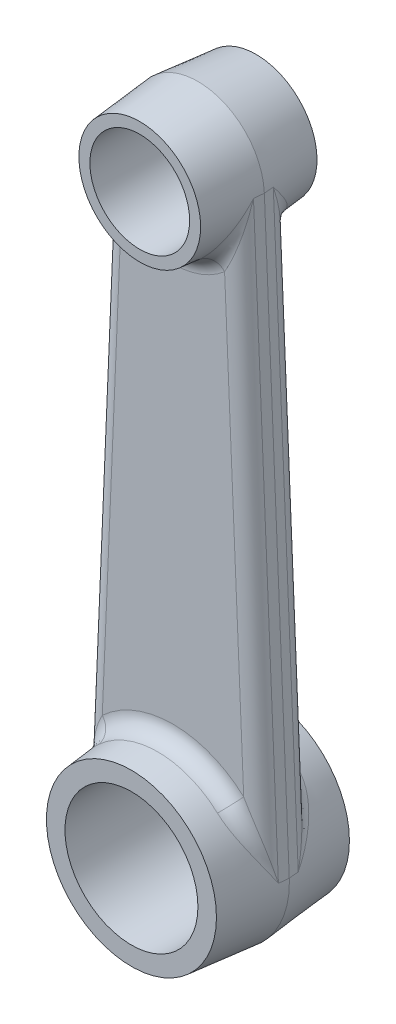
ISO-10303-21;
HEADER;
FILE_DESCRIPTION(('STEP AP214'),'2;1');
FILE_NAME('part.step','',(''),(''),'','','');
FILE_SCHEMA(('AUTOMOTIVE_DESIGN { 1 0 10303 214 1 1 1 1 }'));
ENDSEC;
DATA;
#1=APPLICATION_CONTEXT('core data for automotive mechanical design processes');
#2=APPLICATION_PROTOCOL_DEFINITION('international standard','automotive_design',2000,#1);
#3=PRODUCT_CONTEXT('',#1,'mechanical');
#4=PRODUCT('Part','Part','',(#3));
#5=PRODUCT_RELATED_PRODUCT_CATEGORY('part','',(#4));
#6=PRODUCT_DEFINITION_FORMATION('','',#4);
#7=PRODUCT_DEFINITION_CONTEXT('part definition',#1,'design');
#8=PRODUCT_DEFINITION('design','',#6,#7);
#9=PRODUCT_DEFINITION_SHAPE('','',#8);
#10=(LENGTH_UNIT() NAMED_UNIT(*) SI_UNIT(.MILLI.,.METRE.));
#11=(NAMED_UNIT(*) PLANE_ANGLE_UNIT() SI_UNIT($,.RADIAN.));
#12=(NAMED_UNIT(*) SI_UNIT($,.STERADIAN.) SOLID_ANGLE_UNIT());
#13=UNCERTAINTY_MEASURE_WITH_UNIT(LENGTH_MEASURE(1.E-05),#10,'distance_accuracy_value','');
#14=(GEOMETRIC_REPRESENTATION_CONTEXT(3) GLOBAL_UNCERTAINTY_ASSIGNED_CONTEXT((#13)) GLOBAL_UNIT_ASSIGNED_CONTEXT((#10,
#11,#12)) REPRESENTATION_CONTEXT('',''));
#15=CARTESIAN_POINT('',(0.,0.,0.));
#16=DIRECTION('',(0.,0.,1.));
#17=DIRECTION('',(1.,0.,0.));
#18=AXIS2_PLACEMENT_3D('',#15,#16,#17);
#19=CARTESIAN_POINT('',(0.,70.,-3.));
#20=DIRECTION('',(0.,0.,-1.));
#21=DIRECTION('',(1.,0.,0.));
#22=AXIS2_PLACEMENT_3D('',#19,#20,#21);
#23=PLANE('',#22);
#24=CARTESIAN_POINT('',(0.,0.,-3.));
#25=DIRECTION('',(0.,0.,-1.));
#26=DIRECTION('',(-1.,0.,0.));
#27=AXIS2_PLACEMENT_3D('',#24,#25,#26);
#28=CIRCLE('',#27,12.5278049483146);
#29=CARTESIAN_POINT('',(8.50818644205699,9.19546955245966,-3.));
#30=VERTEX_POINT('',#29);
#31=CARTESIAN_POINT('',(-8.50818644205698,9.19546955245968,-3.));
#32=VERTEX_POINT('',#31);
#33=EDGE_CURVE('E354',#30,#32,#28,.F.);
#34=ORIENTED_EDGE('',*,*,#33,.T.);
#35=DIRECTION('',(-0.0428571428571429,-0.999081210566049,0.));
#36=VECTOR('',#35,1.);
#37=CARTESIAN_POINT('',(-5.88904499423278,70.2526197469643,-3.));
#38=LINE('',#37,#36);
#39=CARTESIAN_POINT('',(-6.20985697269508,62.7738846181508,-3.));
#40=VERTEX_POINT('',#39);
#41=EDGE_CURVE('E357',#32,#40,#38,.F.);
#42=ORIENTED_EDGE('',*,*,#41,.T.);
#43=CARTESIAN_POINT('',(0.,70.,-3.));
#44=DIRECTION('',(0.,0.,-1.));
#45=DIRECTION('',(-1.,0.,0.));
#46=AXIS2_PLACEMENT_3D('',#43,#44,#45);
#47=CIRCLE('',#46,9.52780494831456);
#48=CARTESIAN_POINT('',(6.20985697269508,62.7738846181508,-3.));
#49=VERTEX_POINT('',#48);
#50=EDGE_CURVE('E577',#40,#49,#47,.F.);
#51=ORIENTED_EDGE('',*,*,#50,.T.);
#52=DIRECTION('',(-0.0428571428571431,0.999081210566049,0.));
#53=VECTOR('',#52,1.);
#54=CARTESIAN_POINT('',(5.88904499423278,70.2526197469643,-3.));
#55=LINE('',#54,#53);
#56=EDGE_CURVE('E359',#49,#30,#55,.F.);
#57=ORIENTED_EDGE('',*,*,#56,.T.);
#58=EDGE_LOOP('',(#34,#42,#51,#57));
#59=FACE_BOUND('',#58,.T.);
#60=ADVANCED_FACE('F28',(#59),#23,.T.);
#61=CARTESIAN_POINT('',(0.,70.,3.));
#62=DIRECTION('',(0.,0.,1.));
#63=DIRECTION('',(1.,0.,0.));
#64=AXIS2_PLACEMENT_3D('',#61,#62,#63);
#65=PLANE('',#64);
#66=DIRECTION('',(0.0428571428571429,0.999081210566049,0.));
#67=VECTOR('',#66,1.);
#68=CARTESIAN_POINT('',(-8.88628862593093,0.381191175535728,3.));
#69=LINE('',#68,#67);
#70=CARTESIAN_POINT('',(-6.20985697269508,62.7738846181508,3.));
#71=VERTEX_POINT('',#70);
#72=CARTESIAN_POINT('',(-8.50818644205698,9.19546955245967,3.));
#73=VERTEX_POINT('',#72);
#74=EDGE_CURVE('E192',#71,#73,#69,.F.);
#75=ORIENTED_EDGE('',*,*,#74,.T.);
#76=CARTESIAN_POINT('',(0.,0.,3.));
#77=DIRECTION('',(0.,0.,1.));
#78=DIRECTION('',(1.,0.,0.));
#79=AXIS2_PLACEMENT_3D('',#76,#77,#78);
#80=CIRCLE('',#79,12.5278049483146);
#81=CARTESIAN_POINT('',(8.50818644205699,9.19546955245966,3.));
#82=VERTEX_POINT('',#81);
#83=EDGE_CURVE('E194',#73,#82,#80,.F.);
#84=ORIENTED_EDGE('',*,*,#83,.T.);
#85=DIRECTION('',(0.0428571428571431,-0.999081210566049,0.));
#86=VECTOR('',#85,1.);
#87=CARTESIAN_POINT('',(5.88904499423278,70.2526197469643,3.));
#88=LINE('',#87,#86);
#89=CARTESIAN_POINT('',(6.20985697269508,62.7738846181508,3.));
#90=VERTEX_POINT('',#89);
#91=EDGE_CURVE('E188',#82,#90,#88,.F.);
#92=ORIENTED_EDGE('',*,*,#91,.T.);
#93=CARTESIAN_POINT('',(0.,70.,3.));
#94=DIRECTION('',(0.,0.,1.));
#95=DIRECTION('',(1.,0.,0.));
#96=AXIS2_PLACEMENT_3D('',#93,#94,#95);
#97=CIRCLE('',#96,9.52780494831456);
#98=EDGE_CURVE('E190',#90,#71,#97,.F.);
#99=ORIENTED_EDGE('',*,*,#98,.T.);
#100=EDGE_LOOP('',(#75,#84,#92,#99));
#101=FACE_BOUND('',#100,.T.);
#102=ADVANCED_FACE('F345',(#101),#65,.T.);
#103=CARTESIAN_POINT('',(0.,70.,0.));
#104=DIRECTION('',(0.,0.,-1.));
#105=DIRECTION('',(1.,0.,0.));
#106=AXIS2_PLACEMENT_3D('',#103,#104,#105);
#107=CONICAL_SURFACE('',#106,8.,0.0959931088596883);
#108=CARTESIAN_POINT('',(0.,70.,0.));
#109=DIRECTION('',(0.,0.,1.));
#110=DIRECTION('',(1.,0.,0.));
#111=AXIS2_PLACEMENT_3D('',#108,#109,#110);
#112=CIRCLE('',#111,8.);
#113=CARTESIAN_POINT('',(7.99264968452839,70.3428571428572,0.));
#114=VERTEX_POINT('',#113);
#115=CARTESIAN_POINT('',(-7.99264968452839,70.3428571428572,0.));
#116=VERTEX_POINT('',#115);
#117=EDGE_CURVE('E133',#114,#116,#112,.T.);
#118=ORIENTED_EDGE('',*,*,#117,.T.);
#119=DIRECTION('',(-0.0957576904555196,0.00410767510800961,-0.995396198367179));
#120=VECTOR('',#119,1.);
#121=CARTESIAN_POINT('',(-7.99264968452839,70.3428571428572,0.));
#122=LINE('',#121,#120);
#123=CARTESIAN_POINT('',(-7.87800827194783,70.3379394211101,1.19169150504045));
#124=VERTEX_POINT('',#123);
#125=EDGE_CURVE('E172',#124,#116,#122,.T.);
#126=ORIENTED_EDGE('',*,*,#125,.F.);
#127=CARTESIAN_POINT('',(-5.32928060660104,61.5375569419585,2.76917276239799));
#128=CARTESIAN_POINT('',(-4.41689106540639,63.5307362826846,2.33361644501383));
#129=CARTESIAN_POINT('',(-3.48283771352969,63.2658741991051,4.34665401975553));
#130=CARTESIAN_POINT('',(-5.37404291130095,61.5882718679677,2.79390474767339));
#131=CARTESIAN_POINT('',(-4.43366364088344,63.5552563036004,2.37085380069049));
#132=CARTESIAN_POINT('',(-3.55494331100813,63.3085135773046,4.39611799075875));
#133=CARTESIAN_POINT('',(-5.4192787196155,61.6410470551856,2.81653444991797));
#134=CARTESIAN_POINT('',(-4.45228667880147,63.580339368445,2.4083781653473));
#135=CARTESIAN_POINT('',(-3.62787734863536,63.3527134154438,4.44137739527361));
#136=CARTESIAN_POINT('',(-5.51023878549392,61.7505740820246,2.85765937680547));
#137=CARTESIAN_POINT('',(-4.49376307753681,63.632115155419,2.48322506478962));
#138=CARTESIAN_POINT('',(-3.77468486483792,63.4441117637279,4.52362724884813));
#139=CARTESIAN_POINT('',(-5.55596281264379,61.8073241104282,2.87615646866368));
#140=CARTESIAN_POINT('',(-4.51655056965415,63.6587581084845,2.52049800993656));
#141=CARTESIAN_POINT('',(-3.84855790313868,63.4913089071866,4.56062143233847));
#142=CARTESIAN_POINT('',(-5.64723141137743,61.9243815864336,2.90901825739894));
#143=CARTESIAN_POINT('',(-4.56671341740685,63.714061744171,2.59409840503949));
#144=CARTESIAN_POINT('',(-3.99618704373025,63.5883518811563,4.62634500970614));
#145=CARTESIAN_POINT('',(-5.69277559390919,61.9846678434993,2.92340503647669));
#146=CARTESIAN_POINT('',(-4.59398529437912,63.7426536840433,2.63038851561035));
#147=CARTESIAN_POINT('',(-4.06994156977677,63.6381817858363,4.65511856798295));
#148=CARTESIAN_POINT('',(-5.78355186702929,62.1088831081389,2.9483245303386));
#149=CARTESIAN_POINT('',(-4.65335368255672,63.8025252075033,2.7014738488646));
#150=CARTESIAN_POINT('',(-4.21713579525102,63.740569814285,4.70495755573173));
#151=CARTESIAN_POINT('',(-5.82878397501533,62.1728119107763,2.95885746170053));
#152=CARTESIAN_POINT('',(-4.68536580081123,63.8337427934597,2.73624518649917));
#153=CARTESIAN_POINT('',(-4.29057551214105,63.7931277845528,4.72602341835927));
#154=CARTESIAN_POINT('',(-5.93111913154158,62.3223937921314,2.9786699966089));
#155=CARTESIAN_POINT('',(-4.76357813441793,63.9083763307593,2.81276610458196));
#156=CARTESIAN_POINT('',(-4.45696677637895,63.9158097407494,4.76564848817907));
#157=CARTESIAN_POINT('',(-5.98802271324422,62.4091415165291,2.98678507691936));
#158=CARTESIAN_POINT('',(-4.8112464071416,63.9527967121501,2.85391045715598));
#159=CARTESIAN_POINT('',(-4.54966068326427,63.9867517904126,4.78187864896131));
#160=CARTESIAN_POINT('',(-6.10024086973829,62.5877711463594,2.99745257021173));
#161=CARTESIAN_POINT('',(-4.91352869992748,64.0475732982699,2.93100486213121));
#162=CARTESIAN_POINT('',(-4.73283270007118,64.1324623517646,4.8032136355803));
#163=CARTESIAN_POINT('',(-6.1555543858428,62.6796563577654,3.00000135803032));
#164=CARTESIAN_POINT('',(-4.96798097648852,64.0977870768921,2.96698829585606));
#165=CARTESIAN_POINT('',(-4.82330932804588,64.2072333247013,4.80831121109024));
#166=CARTESIAN_POINT('',(-6.33376003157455,62.9888867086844,2.99999690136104));
#167=CARTESIAN_POINT('',(-5.15431031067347,64.2714435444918,3.07333612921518));
#168=CARTESIAN_POINT('',(-5.11546634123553,64.4583367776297,4.80830229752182));
#169=CARTESIAN_POINT('',(-6.45239996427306,63.2160872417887,2.98671716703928));
#170=CARTESIAN_POINT('',(-5.29925260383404,64.4091668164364,3.13186995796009));
#171=CARTESIAN_POINT('',(-5.31104377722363,64.6420088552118,4.78174282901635));
#172=CARTESIAN_POINT('',(-6.67597589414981,63.6888777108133,2.939218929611));
#173=CARTESIAN_POINT('',(-5.60149146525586,64.7183109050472,3.20725097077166));
#174=CARTESIAN_POINT('',(-5.68191807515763,65.0230391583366,4.68674635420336));
#175=CARTESIAN_POINT('',(-6.78087330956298,63.9345164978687,2.90494294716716));
#176=CARTESIAN_POINT('',(-5.75836332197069,64.8885901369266,3.22549540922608));
#177=CARTESIAN_POINT('',(-5.85715768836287,65.2204336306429,4.61819438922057));
#178=CARTESIAN_POINT('',(-6.94947198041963,64.3709349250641,2.83175420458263));
#179=CARTESIAN_POINT('',(-6.02737312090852,65.2083166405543,3.22258765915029));
#180=CARTESIAN_POINT('',(-6.14097908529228,65.5704884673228,4.47181690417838));
#181=CARTESIAN_POINT('',(-7.01666071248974,64.5586777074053,2.79657474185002));
#182=CARTESIAN_POINT('',(-6.13948491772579,65.349691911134,3.21135276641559));
#183=CARTESIAN_POINT('',(-6.25480440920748,65.7208832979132,4.40145797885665));
#184=CARTESIAN_POINT('',(-7.14307603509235,64.9397948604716,2.71917955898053));
#185=CARTESIAN_POINT('',(-6.35737129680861,65.6443164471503,3.17015197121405));
#186=CARTESIAN_POINT('',(-6.47040598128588,66.0259106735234,4.24666761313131));
#187=CARTESIAN_POINT('',(-7.20229911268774,65.1331716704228,2.67696075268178));
#188=CARTESIAN_POINT('',(-6.46346700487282,65.7975486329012,3.1405653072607));
#189=CARTESIAN_POINT('',(-6.57217691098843,66.1805450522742,4.16223000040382));
#190=CARTESIAN_POINT('',(-7.36835539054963,65.720621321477,2.54158503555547));
#191=CARTESIAN_POINT('',(-6.76498544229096,66.2674545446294,3.02834082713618));
#192=CARTESIAN_POINT('',(-6.85984367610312,66.6500455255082,3.89147856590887));
#193=CARTESIAN_POINT('',(-7.4633846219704,66.1215113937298,2.43979926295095));
#194=CARTESIAN_POINT('',(-6.9517602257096,66.6043249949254,2.92139718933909));
#195=CARTESIAN_POINT('',(-7.02777145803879,66.9701068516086,3.68790702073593));
#196=CARTESIAN_POINT('',(-7.60427249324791,66.8365585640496,2.24744732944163));
#197=CARTESIAN_POINT('',(-7.23646372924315,67.2184863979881,2.69243936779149));
#198=CARTESIAN_POINT('',(-7.28269984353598,67.5408762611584,3.30320315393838));
#199=CARTESIAN_POINT('',(-7.65645306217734,67.1485919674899,2.15999723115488));
#200=CARTESIAN_POINT('',(-7.34572930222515,67.4904505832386,2.58081765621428));
#201=CARTESIAN_POINT('',(-7.37944951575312,67.7899145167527,3.1283029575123));
#202=CARTESIAN_POINT('',(-7.74423704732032,67.7768831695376,1.97884840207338));
#203=CARTESIAN_POINT('',(-7.53368316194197,68.0421645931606,2.33917150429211));
#204=CARTESIAN_POINT('',(-7.54718746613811,68.2914383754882,2.76600529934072));
#205=CARTESIAN_POINT('',(-7.77982871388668,68.093143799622,1.88514529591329));
#206=CARTESIAN_POINT('',(-7.61337344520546,68.3232963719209,2.20878144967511));
#207=CARTESIAN_POINT('',(-7.61815747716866,68.5439262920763,2.57859908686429));
#208=CARTESIAN_POINT('',(-7.86241536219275,69.0443295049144,1.59812336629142));
#209=CARTESIAN_POINT('',(-7.80366963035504,69.1667299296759,1.80218188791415));
#210=CARTESIAN_POINT('',(-7.79308074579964,69.303580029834,2.00455522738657));
#211=CARTESIAN_POINT('',(-7.88560885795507,69.6836840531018,1.39832554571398));
#212=CARTESIAN_POINT('',(-7.87228508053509,69.7490471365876,1.50163174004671));
#213=CARTESIAN_POINT('',(-7.85975209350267,69.8145512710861,1.60495958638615));
#214=CARTESIAN_POINT('',(-7.87814555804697,70.3267233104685,1.1952343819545));
#215=CARTESIAN_POINT('',(-7.87792445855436,70.3278449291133,1.19700568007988));
#216=CARTESIAN_POINT('',(-7.87770644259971,70.3289666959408,1.19877725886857));
#217=CARTESIAN_POINT('',(-7.87807809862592,70.3323314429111,1.19346299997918));
#218=CARTESIAN_POINT('',(-7.87796879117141,70.3328922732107,1.1943487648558));
#219=CARTESIAN_POINT('',(-7.87785924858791,70.3334531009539,1.19523449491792));
#220=CARTESIAN_POINT('',(-7.87800827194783,70.3379394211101,1.19169150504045));
#221=CARTESIAN_POINT('',(-7.87800827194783,70.3379394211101,1.19169150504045));
#222=CARTESIAN_POINT('',(-7.87800827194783,70.3379394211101,1.19169150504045));
#223=(BOUNDED_SURFACE() B_SPLINE_SURFACE(3,2,((#127,#128,#129),(#130,#131,#132),(#133,#134,
#135),(#136,#137,#138),(#139,#140,#141),(#142,#143,#144),(#145,#146,#147),(#148,#149,#150),
(#151,#152,#153),(#154,#155,#156),(#157,#158,#159),(#160,#161,#162),(#163,#164,#165),(#166,#167,
#168),(#169,#170,#171),(#172,#173,#174),(#175,#176,#177),(#178,#179,#180),(#181,#182,#183),
(#184,#185,#186),(#187,#188,#189),(#190,#191,#192),(#193,#194,#195),(#196,#197,#198),(#199,#200,
#201),(#202,#203,#204),(#205,#206,#207),(#208,#209,#210),(#211,#212,#213),(#214,#215,#216),
(#217,#218,#219),(#220,#221,#222)),.UNSPECIFIED.,.F.,.F.,.F.) B_SPLINE_SURFACE_WITH_KNOTS((4,2,
2,2,2,2,2,2,2,2,2,2,2,2,2,4),(3,3),(0.,0.349970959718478,0.699783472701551,1.04767971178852,
1.39555639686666,1.84024409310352,2.28522131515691,3.30053277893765,4.31863625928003,
5.06261588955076,5.80692255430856,7.29753845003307,8.43255717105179,9.56837859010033,
11.8326424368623,11.852564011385),(0.,1.),
.UNSPECIFIED.) GEOMETRIC_REPRESENTATION_ITEM() RATIONAL_B_SPLINE_SURFACE(((1.,0.666854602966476,
1.),(1.,0.66923607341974,1.),(1.,0.671861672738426,1.),(1.,0.677576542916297,1.),(1.,
0.680665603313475,1.),(1.,0.687266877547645,1.),(1.,0.690776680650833,1.),(1.,0.698188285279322,
1.),(1.,0.702090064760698,1.),(1.,0.711366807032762,1.),(1.,0.716849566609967,1.),(1.,
0.728244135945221,1.),(1.,0.734156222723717,1.),(1.,0.754049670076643,1.),(1.,0.768661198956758,
1.),(1.,0.798028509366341,1.),(1.,0.812784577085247,1.),(1.,0.837556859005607,1.),(1.,
0.847779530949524,1.),(1.,0.867508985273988,1.),(1.,0.877015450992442,1.),(1.,0.904208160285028,
1.),(1.,0.920538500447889,1.),(1.,0.945419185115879,1.),(1.,0.954896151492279,1.),(1.,
0.971200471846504,1.),(1.,0.978025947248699,1.),(1.,0.994395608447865,1.),(1.,0.999903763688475,
1.),(1.,0.999999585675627,1.),(1.,1.00000000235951,1.),(1.,1.,1.))) REPRESENTATION_ITEM('') SURFACE());
#224=CARTESIAN_POINT('',(-3.48283771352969,63.2658741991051,4.34665401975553));
#225=CARTESIAN_POINT('',(-3.55494331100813,63.3085135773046,4.39611799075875));
#226=CARTESIAN_POINT('',(-3.62787734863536,63.3527134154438,4.44137739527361));
#227=CARTESIAN_POINT('',(-3.77468486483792,63.4441117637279,4.52362724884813));
#228=CARTESIAN_POINT('',(-3.84855790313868,63.4913089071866,4.56062143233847));
#229=CARTESIAN_POINT('',(-3.99618704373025,63.5883518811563,4.62634500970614));
#230=CARTESIAN_POINT('',(-4.06994156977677,63.6381817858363,4.65511856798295));
#231=CARTESIAN_POINT('',(-4.21713579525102,63.740569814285,4.70495755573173));
#232=CARTESIAN_POINT('',(-4.29057551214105,63.7931277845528,4.72602341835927));
#233=CARTESIAN_POINT('',(-4.45696677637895,63.9158097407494,4.76564848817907));
#234=CARTESIAN_POINT('',(-4.54966068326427,63.9867517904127,4.78187864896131));
#235=CARTESIAN_POINT('',(-4.73283270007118,64.1324623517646,4.8032136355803));
#236=CARTESIAN_POINT('',(-4.82330932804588,64.2072333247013,4.80831121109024));
#237=CARTESIAN_POINT('',(-5.11546634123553,64.4583367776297,4.80830229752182));
#238=CARTESIAN_POINT('',(-5.31104377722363,64.6420088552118,4.78174282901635));
#239=CARTESIAN_POINT('',(-5.68191807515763,65.0230391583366,4.68674635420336));
#240=CARTESIAN_POINT('',(-5.85715768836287,65.2204336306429,4.61819438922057));
#241=CARTESIAN_POINT('',(-6.14097908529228,65.5704884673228,4.47181690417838));
#242=CARTESIAN_POINT('',(-6.25480440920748,65.7208832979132,4.40145797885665));
#243=CARTESIAN_POINT('',(-6.47040598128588,66.0259106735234,4.24666761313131));
#244=CARTESIAN_POINT('',(-6.57217691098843,66.1805450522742,4.16223000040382));
#245=CARTESIAN_POINT('',(-6.85984367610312,66.6500455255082,3.89147856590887));
#246=CARTESIAN_POINT('',(-7.02777145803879,66.9701068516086,3.68790702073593));
#247=CARTESIAN_POINT('',(-7.28269984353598,67.5408762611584,3.30320315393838));
#248=CARTESIAN_POINT('',(-7.37944951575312,67.7899145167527,3.1283029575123));
#249=CARTESIAN_POINT('',(-7.54718746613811,68.2914383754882,2.76600529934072));
#250=CARTESIAN_POINT('',(-7.61815747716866,68.5439262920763,2.57859908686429));
#251=CARTESIAN_POINT('',(-7.79308074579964,69.3035800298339,2.00455522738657));
#252=CARTESIAN_POINT('',(-7.85975209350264,69.8145512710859,1.60495958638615));
#253=CARTESIAN_POINT('',(-7.87770644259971,70.3289666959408,1.19877725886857));
#254=CARTESIAN_POINT('',(-7.87785924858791,70.3334531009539,1.19523449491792));
#255=CARTESIAN_POINT('',(-7.87800827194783,70.3379394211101,1.19169150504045));
#256=B_SPLINE_CURVE_WITH_KNOTS('',3,(#224,#225,#226,#227,#228,#229,#230,#231,#232,#233,#234,
#235,#236,#237,#238,#239,#240,#241,#242,#243,#244,#245,#246,#247,#248,#249,#250,#251,#252,#253,
#254,#255),.UNSPECIFIED.,.F.,.F.,(4,2,2,2,2,2,2,2,2,2,2,2,2,2,2,4),(0.,0.349970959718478,
0.699783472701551,1.04767971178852,1.39555639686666,1.84024409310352,2.28522131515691,
3.30053277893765,4.31863625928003,5.06261588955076,5.80692255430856,7.29753845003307,
8.43255717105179,9.56837859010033,11.8326424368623,11.852564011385),.UNSPECIFIED.);
#257=CARTESIAN_POINT('',(-4.91233502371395,64.2837492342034,4.80830849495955));
#258=VERTEX_POINT('',#257);
#259=EDGE_CURVE('E38',#124,#258,#256,.F.);
#260=ORIENTED_EDGE('',*,*,#259,.T.);
#261=CARTESIAN_POINT('',(0.,70.,4.80830849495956));
#262=DIRECTION('',(0.,0.,1.));
#263=DIRECTION('',(1.,0.,0.));
#264=AXIS2_PLACEMENT_3D('',#261,#262,#263);
#265=CIRCLE('',#264,7.5370125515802);
#266=CARTESIAN_POINT('',(4.91233502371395,64.2837492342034,4.80830849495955));
#267=VERTEX_POINT('',#266);
#268=EDGE_CURVE('E44',#258,#267,#265,.T.);
#269=ORIENTED_EDGE('',*,*,#268,.T.);
#270=CARTESIAN_POINT('',(7.87800827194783,70.3379394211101,1.19169150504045));
#271=CARTESIAN_POINT('',(7.87800827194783,70.3379394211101,1.19169150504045));
#272=CARTESIAN_POINT('',(7.87800827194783,70.3379394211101,1.19169150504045));
#273=CARTESIAN_POINT('',(7.87807809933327,70.3323314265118,1.19346300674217));
#274=CARTESIAN_POINT('',(7.87796876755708,70.3328922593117,1.1943487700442));
#275=CARTESIAN_POINT('',(7.87785924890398,70.3334530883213,1.19523450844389));
#276=CARTESIAN_POINT('',(7.87814555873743,70.3267232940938,1.1952343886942));
#277=CARTESIAN_POINT('',(7.8779244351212,70.3278449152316,1.19700568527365));
#278=CARTESIAN_POINT('',(7.87770644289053,70.3289666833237,1.19877727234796));
#279=CARTESIAN_POINT('',(7.88483600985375,69.7502683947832,1.37729604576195));
#280=CARTESIAN_POINT('',(7.87287143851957,69.8089846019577,1.4700863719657));
#281=CARTESIAN_POINT('',(7.86161112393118,69.8678170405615,1.5629005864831));
#282=CARTESIAN_POINT('',(7.86691980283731,69.1780484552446,1.55629615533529));
#283=CARTESIAN_POINT('',(7.81762414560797,69.2889816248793,1.73904110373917));
#284=CARTESIAN_POINT('',(7.80647295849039,69.4104485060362,1.92090080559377));
#285=CARTESIAN_POINT('',(7.80194944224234,68.3252426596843,1.81551261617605));
#286=CARTESIAN_POINT('',(7.66397774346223,68.530321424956,2.11015571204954));
#287=CARTESIAN_POINT('',(7.6639438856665,68.7292671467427,2.43933372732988));
#288=CARTESIAN_POINT('',(7.77388127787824,68.0415256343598,1.9004763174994));
#289=CARTESIAN_POINT('',(7.59987121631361,68.2773759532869,2.23013754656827));
#290=CARTESIAN_POINT('',(7.6063487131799,68.5027241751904,2.60926113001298));
#291=CARTESIAN_POINT('',(7.70460391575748,67.4770101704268,2.06593266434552));
#292=CARTESIAN_POINT('',(7.44835543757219,67.7788164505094,2.45637206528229));
#293=CARTESIAN_POINT('',(7.47068012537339,68.0520563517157,2.94017382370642));
#294=CARTESIAN_POINT('',(7.66340043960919,67.1962105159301,2.14642723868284));
#295=CARTESIAN_POINT('',(7.36029688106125,67.5321786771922,2.56295150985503));
#296=CARTESIAN_POINT('',(7.39261562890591,67.8279304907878,3.10116297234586));
#297=CARTESIAN_POINT('',(7.54482488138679,66.5082559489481,2.33764329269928));
#298=CARTESIAN_POINT('',(7.11432072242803,66.9336116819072,2.80425298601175));
#299=CARTESIAN_POINT('',(7.17383022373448,67.2788269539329,3.48359508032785));
#300=CARTESIAN_POINT('',(7.4595484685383,66.1033548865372,2.44491833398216));
#301=CARTESIAN_POINT('',(6.94216645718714,66.5876576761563,2.92758702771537));
#302=CARTESIAN_POINT('',(7.02087547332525,66.955648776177,3.69814516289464));
#303=CARTESIAN_POINT('',(7.30837768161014,65.5076536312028,2.59071845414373));
#304=CARTESIAN_POINT('',(6.65822782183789,66.1000647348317,3.06866839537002));
#305=CARTESIAN_POINT('',(6.75590287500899,66.479835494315,3.98974540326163));
#306=CARTESIAN_POINT('',(7.2540957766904,65.3109830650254,2.6368088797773));
#307=CARTESIAN_POINT('',(6.55735887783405,65.9401423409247,3.10880239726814));
#308=CARTESIAN_POINT('',(6.66162871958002,66.322687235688,4.08192625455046));
#309=CARTESIAN_POINT('',(7.13755924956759,64.9224056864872,2.72280609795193));
#310=CARTESIAN_POINT('',(6.34796418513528,65.6307657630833,3.17248028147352));
#311=CARTESIAN_POINT('',(6.46095936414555,66.0119943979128,4.25392069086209));
#312=CARTESIAN_POINT('',(7.07530506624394,64.7304986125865,2.76271323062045));
#313=CARTESIAN_POINT('',(6.23906368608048,65.4812339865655,3.19572460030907));
#314=CARTESIAN_POINT('',(6.35456483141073,65.8584496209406,4.33373495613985));
#315=CARTESIAN_POINT('',(6.95318424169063,64.3824879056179,2.82925614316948));
#316=CARTESIAN_POINT('',(6.03463584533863,65.2178697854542,3.22113127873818));
#317=CARTESIAN_POINT('',(6.14732978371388,65.5797236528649,4.46682078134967));
#318=CARTESIAN_POINT('',(6.89447822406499,64.2254948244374,2.85699189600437));
#319=CARTESIAN_POINT('',(5.93918721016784,65.1017603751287,3.22578446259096));
#320=CARTESIAN_POINT('',(6.04824137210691,65.4538752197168,4.52229228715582));
#321=CARTESIAN_POINT('',(6.77144014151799,63.9168404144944,2.90606166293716));
#322=CARTESIAN_POINT('',(5.74775494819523,64.8799020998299,3.22061098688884));
#323=CARTESIAN_POINT('',(5.84162778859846,65.2061567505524,4.62043182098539));
#324=CARTESIAN_POINT('',(6.70711013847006,63.7651771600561,2.92739801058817));
#325=CARTESIAN_POINT('',(5.65169117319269,64.7742998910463,3.2104665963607));
#326=CARTESIAN_POINT('',(5.73410571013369,65.0842852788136,4.66310451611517));
#327=CARTESIAN_POINT('',(6.57337325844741,63.4690040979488,2.96244822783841));
#328=CARTESIAN_POINT('',(5.46284126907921,64.5750824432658,3.17533635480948));
#329=CARTESIAN_POINT('',(5.51156752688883,64.8459057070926,4.73320495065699));
#330=CARTESIAN_POINT('',(6.50399318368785,63.3244625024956,2.97619942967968));
#331=CARTESIAN_POINT('',(5.37008341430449,64.4816518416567,3.15007532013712));
#332=CARTESIAN_POINT('',(5.39659129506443,64.7293739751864,4.76070735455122));
#333=CARTESIAN_POINT('',(6.36036113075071,63.0430569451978,2.9949729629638));
#334=CARTESIAN_POINT('',(5.19126764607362,64.306880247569,3.08529847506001));
#335=CARTESIAN_POINT('',(5.15948012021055,64.5020147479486,4.79825442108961));
#336=CARTESIAN_POINT('',(6.28611164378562,62.906189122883,2.9999997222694));
#337=CARTESIAN_POINT('',(5.10542072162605,64.2258746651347,3.04547015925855));
#338=CARTESIAN_POINT('',(5.03734884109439,64.3911843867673,4.80830793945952));
#339=CARTESIAN_POINT('',(6.1598990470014,62.6872058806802,3.00000018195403));
#340=CARTESIAN_POINT('',(4.97266969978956,64.10215986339,2.9696391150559));
#341=CARTESIAN_POINT('',(4.83043274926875,64.213363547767,4.80830885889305));
#342=CARTESIAN_POINT('',(6.10908046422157,62.6024857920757,2.99784291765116));
#343=CARTESIAN_POINT('',(4.92233522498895,64.055698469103,2.93678001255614));
#344=CARTESIAN_POINT('',(4.74729324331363,64.1444351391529,4.803994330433));
#345=CARTESIAN_POINT('',(6.00606713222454,62.4373708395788,2.98884601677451));
#346=CARTESIAN_POINT('',(4.82721897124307,63.9676243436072,2.86662007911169));
#347=CARTESIAN_POINT('',(4.57908992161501,64.009801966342,4.78600052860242));
#348=CARTESIAN_POINT('',(5.9538730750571,62.3569738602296,2.98200869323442));
#349=CARTESIAN_POINT('',(4.782562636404,63.9261235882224,2.82928992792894));
#350=CARTESIAN_POINT('',(4.49402707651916,63.9440956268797,4.77232588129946));
#351=CARTESIAN_POINT('',(5.84801963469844,62.2001433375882,2.96321408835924));
#352=CARTESIAN_POINT('',(4.6990892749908,63.8470560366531,2.75091149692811));
#353=CARTESIAN_POINT('',(4.32181376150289,63.8155888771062,4.73473667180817));
#354=CARTESIAN_POINT('',(5.79435112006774,62.1237538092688,2.95120959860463));
#355=CARTESIAN_POINT('',(4.66048009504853,63.8096483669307,2.7098409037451));
#356=CARTESIAN_POINT('',(4.23465121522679,63.7528213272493,4.71072769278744));
#357=CARTESIAN_POINT('',(5.68651411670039,61.9760098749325,2.92176252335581));
#358=CARTESIAN_POINT('',(4.58969790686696,63.7383926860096,2.62541677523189));
#359=CARTESIAN_POINT('',(4.05978433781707,63.6310510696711,4.65183354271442));
#360=CARTESIAN_POINT('',(5.63234506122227,61.9046622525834,2.9043127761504));
#361=CARTESIAN_POINT('',(4.55767448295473,63.704653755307,2.58210006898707));
#362=CARTESIAN_POINT('',(3.97207944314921,63.572053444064,4.61693404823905));
#363=CARTESIAN_POINT('',(5.57824360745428,61.836064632,2.88400014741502));
#364=CARTESIAN_POINT('',(4.52911710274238,63.6724829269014,2.53860452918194));
#365=CARTESIAN_POINT('',(3.8846051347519,63.5151222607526,4.57630878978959));
#366=(BOUNDED_SURFACE() B_SPLINE_SURFACE(3,2,((#270,#271,#272),(#273,#274,#275),(#276,#277,
#278),(#279,#280,#281),(#282,#283,#284),(#285,#286,#287),(#288,#289,#290),(#291,#292,#293),
(#294,#295,#296),(#297,#298,#299),(#300,#301,#302),(#303,#304,#305),(#306,#307,#308),(#309,#310,
#311),(#312,#313,#314),(#315,#316,#317),(#318,#319,#320),(#321,#322,#323),(#324,#325,#326),
(#327,#328,#329),(#330,#331,#332),(#333,#334,#335),(#336,#337,#338),(#339,#340,#341),(#342,#343,
#344),(#345,#346,#347),(#348,#349,#350),(#351,#352,#353),(#354,#355,#356),(#357,#358,#359),
(#360,#361,#362),(#363,#364,#365)),.UNSPECIFIED.,.F.,.F.,.F.) B_SPLINE_SURFACE_WITH_KNOTS((4,2,
2,2,2,2,2,2,2,2,2,2,2,2,2,4),(3,3),(0.,0.0199215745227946,2.04767237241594,3.06422248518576,
4.0803304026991,5.57112842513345,6.31688081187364,7.06259216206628,7.69118493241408,
8.31954820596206,8.94479058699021,9.56971554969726,9.9791324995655,10.3883472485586,
10.8013827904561,11.2149638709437),(0.,1.),
.UNSPECIFIED.) GEOMETRIC_REPRESENTATION_ITEM() RATIONAL_B_SPLINE_SURFACE(((1.,1.,1.),(1.,
1.00000000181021,1.),(1.,0.999999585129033,1.),(1.,0.999913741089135,1.),(1.,0.99549299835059,
1.),(1.,0.982355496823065,1.),(1.,0.976880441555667,1.),(1.,0.963787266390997,1.),(1.,
0.956170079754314,1.),(1.,0.934784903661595,1.),(1.,0.91980587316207,1.),(1.,0.894390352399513,
1.),(1.,0.885424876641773,1.),(1.,0.866646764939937,1.),(1.,0.856834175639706,1.),(1.,
0.838161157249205,1.),(1.,0.829393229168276,1.),(1.,0.811579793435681,1.),(1.,0.802534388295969,
1.),(1.,0.784439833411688,1.),(1.,0.775390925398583,1.),(1.,0.757536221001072,1.),(1.,
0.748730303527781,1.),(1.,0.734641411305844,1.),(1.,0.729190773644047,1.),(1.,0.718644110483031,
1.),(1.,0.713547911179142,1.),(1.,0.703763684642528,1.),(1.,0.699079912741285,1.),(1.,
0.690255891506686,1.),(1.,0.686116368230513,1.),(1.,0.682296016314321,1.))) REPRESENTATION_ITEM('') SURFACE());
#367=CARTESIAN_POINT('',(3.8846051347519,63.5151222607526,4.57630878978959));
#368=CARTESIAN_POINT('',(3.97207944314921,63.572053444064,4.61693404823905));
#369=CARTESIAN_POINT('',(4.05978433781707,63.6310510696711,4.65183354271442));
#370=CARTESIAN_POINT('',(4.23465121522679,63.7528213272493,4.71072769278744));
#371=CARTESIAN_POINT('',(4.32181376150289,63.8155888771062,4.73473667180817));
#372=CARTESIAN_POINT('',(4.49402707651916,63.9440956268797,4.77232588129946));
#373=CARTESIAN_POINT('',(4.57908992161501,64.009801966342,4.78600052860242));
#374=CARTESIAN_POINT('',(4.74729324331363,64.1444351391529,4.803994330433));
#375=CARTESIAN_POINT('',(4.83043274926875,64.213363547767,4.80830885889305));
#376=CARTESIAN_POINT('',(5.03734884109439,64.3911843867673,4.80830793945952));
#377=CARTESIAN_POINT('',(5.15948012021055,64.5020147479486,4.79825442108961));
#378=CARTESIAN_POINT('',(5.39659129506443,64.7293739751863,4.76070735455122));
#379=CARTESIAN_POINT('',(5.51156752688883,64.8459057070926,4.73320495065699));
#380=CARTESIAN_POINT('',(5.73410571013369,65.0842852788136,4.66310451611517));
#381=CARTESIAN_POINT('',(5.84162778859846,65.2061567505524,4.62043182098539));
#382=CARTESIAN_POINT('',(6.04824137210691,65.4538752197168,4.52229228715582));
#383=CARTESIAN_POINT('',(6.14732978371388,65.5797236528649,4.46682078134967));
#384=CARTESIAN_POINT('',(6.35456483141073,65.8584496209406,4.33373495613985));
#385=CARTESIAN_POINT('',(6.46095936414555,66.0119943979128,4.25392069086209));
#386=CARTESIAN_POINT('',(6.66162871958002,66.322687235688,4.08192625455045));
#387=CARTESIAN_POINT('',(6.75590287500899,66.479835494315,3.98974540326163));
#388=CARTESIAN_POINT('',(7.02087547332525,66.955648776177,3.69814516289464));
#389=CARTESIAN_POINT('',(7.17383022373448,67.2788269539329,3.48359508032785));
#390=CARTESIAN_POINT('',(7.39261562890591,67.8279304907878,3.10116297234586));
#391=CARTESIAN_POINT('',(7.47068012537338,68.0520563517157,2.94017382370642));
#392=CARTESIAN_POINT('',(7.6063487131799,68.5027241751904,2.60926113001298));
#393=CARTESIAN_POINT('',(7.6639438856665,68.7292671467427,2.43933372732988));
#394=CARTESIAN_POINT('',(7.80647295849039,69.4104485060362,1.92090080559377));
#395=CARTESIAN_POINT('',(7.86161112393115,69.8678170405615,1.5629005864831));
#396=CARTESIAN_POINT('',(7.87770644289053,70.3289666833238,1.19877727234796));
#397=CARTESIAN_POINT('',(7.87785924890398,70.3334530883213,1.19523450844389));
#398=CARTESIAN_POINT('',(7.87800827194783,70.3379394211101,1.19169150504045));
#399=B_SPLINE_CURVE_WITH_KNOTS('',3,(#367,#368,#369,#370,#371,#372,#373,#374,#375,#376,#377,
#378,#379,#380,#381,#382,#383,#384,#385,#386,#387,#388,#389,#390,#391,#392,#393,#394,#395,#396,
#397,#398),.UNSPECIFIED.,.F.,.F.,(4,2,2,2,2,2,2,2,2,2,2,2,2,2,2,4),(0.,0.413581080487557,
0.82661662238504,1.23583137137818,1.64524832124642,2.27017328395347,2.89541566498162,
3.5237789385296,4.1523717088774,4.89808305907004,5.64383544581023,7.13463346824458,
8.15074138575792,9.16729149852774,11.1950422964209,11.2149638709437),.UNSPECIFIED.);
#400=CARTESIAN_POINT('',(7.87800827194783,70.3379394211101,1.19169150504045));
#401=VERTEX_POINT('',#400);
#402=EDGE_CURVE('E11',#267,#401,#399,.T.);
#403=ORIENTED_EDGE('',*,*,#402,.T.);
#404=DIRECTION('',(0.0957576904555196,0.00410767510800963,-0.995396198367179));
#405=VECTOR('',#404,1.);
#406=CARTESIAN_POINT('',(7.99264968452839,70.3428571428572,0.));
#407=LINE('',#406,#405);
#408=EDGE_CURVE('E128',#401,#114,#407,.T.);
#409=ORIENTED_EDGE('',*,*,#408,.T.);
#410=EDGE_LOOP('',(#118,#126,#260,#269,#403,#409));
#411=FACE_BOUND('',#410,.T.);
#412=CARTESIAN_POINT('',(0.,70.,7.));
#413=DIRECTION('',(0.,0.,1.));
#414=DIRECTION('',(1.,0.,0.));
#415=AXIS2_PLACEMENT_3D('',#412,#413,#414);
#416=CIRCLE('',#415,7.32597666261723);
#417=CARTESIAN_POINT('',(7.32597666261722,70.,7.));
#418=VERTEX_POINT('',#417);
#419=EDGE_CURVE('E152',#418,#418,#416,.T.);
#420=ORIENTED_EDGE('',*,*,#419,.F.);
#421=EDGE_LOOP('',(#420));
#422=FACE_BOUND('',#421,.T.);
#423=ADVANCED_FACE('F130',(#411,#422),#107,.T.);
#424=CARTESIAN_POINT('',(-7.99264968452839,70.3428571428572,0.));
#425=DIRECTION('',(-0.994481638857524,0.0426598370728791,0.0958457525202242));
#426=DIRECTION('',(0.0959330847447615,0.,0.995387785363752));
#427=AXIS2_PLACEMENT_3D('',#424,#425,#426);
#428=PLANE('',#427);
#429=DIRECTION('',(-0.0957576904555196,0.00410767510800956,-0.995396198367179));
#430=VECTOR('',#429,1.);
#431=CARTESIAN_POINT('',(-10.9898933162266,0.471428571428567,0.));
#432=LINE('',#431,#430);
#433=CARTESIAN_POINT('',(-10.875251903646,0.466510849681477,1.19169150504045));
#434=VERTEX_POINT('',#433);
#435=CARTESIAN_POINT('',(-10.9898933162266,0.47142857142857,0.));
#436=VERTEX_POINT('',#435);
#437=EDGE_CURVE('E174',#434,#436,#432,.T.);
#438=ORIENTED_EDGE('',*,*,#437,.F.);
#439=DIRECTION('',(-0.0428571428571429,-0.999081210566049,0.));
#440=VECTOR('',#439,1.);
#441=CARTESIAN_POINT('',(-7.87800827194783,70.3379394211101,1.19169150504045));
#442=LINE('',#441,#440);
#443=EDGE_CURVE('E197',#434,#124,#442,.F.);
#444=ORIENTED_EDGE('',*,*,#443,.T.);
#445=ORIENTED_EDGE('',*,*,#125,.T.);
#446=DIRECTION('',(-0.0428571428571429,-0.999081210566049,0.));
#447=VECTOR('',#446,1.);
#448=CARTESIAN_POINT('',(-7.99264968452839,70.3428571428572,0.));
#449=LINE('',#448,#447);
#450=EDGE_CURVE('E161',#116,#436,#449,.T.);
#451=ORIENTED_EDGE('',*,*,#450,.T.);
#452=EDGE_LOOP('',(#438,#444,#445,#451));
#453=FACE_BOUND('',#452,.T.);
#454=ADVANCED_FACE('F222',(#453),#428,.T.);
#455=CARTESIAN_POINT('',(0.,0.,0.));
#456=DIRECTION('',(0.,0.,-1.));
#457=DIRECTION('',(1.,0.,0.));
#458=AXIS2_PLACEMENT_3D('',#455,#456,#457);
#459=CONICAL_SURFACE('',#458,11.,0.0959931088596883);
#460=CARTESIAN_POINT('',(0.,0.,0.));
#461=DIRECTION('',(0.,0.,1.));
#462=DIRECTION('',(1.,0.,0.));
#463=AXIS2_PLACEMENT_3D('',#460,#461,#462);
#464=CIRCLE('',#463,11.);
#465=CARTESIAN_POINT('',(10.9898933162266,0.471428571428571,0.));
#466=VERTEX_POINT('',#465);
#467=EDGE_CURVE('E167',#436,#466,#464,.T.);
#468=ORIENTED_EDGE('',*,*,#467,.T.);
#469=DIRECTION('',(0.0957576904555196,0.00410767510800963,-0.995396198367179));
#470=VECTOR('',#469,1.);
#471=CARTESIAN_POINT('',(10.9898933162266,0.471428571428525,0.));
#472=LINE('',#471,#470);
#473=CARTESIAN_POINT('',(10.875251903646,0.466510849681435,1.19169150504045));
#474=VERTEX_POINT('',#473);
#475=EDGE_CURVE('E138',#474,#466,#472,.T.);
#476=ORIENTED_EDGE('',*,*,#475,.F.);
#477=CARTESIAN_POINT('',(7.70402154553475,10.4845324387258,2.85478461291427));
#478=CARTESIAN_POINT('',(6.54765653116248,8.58326319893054,2.35589175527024));
#479=CARTESIAN_POINT('',(5.85352932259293,8.79516637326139,4.5178777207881));
#480=CARTESIAN_POINT('',(7.77219189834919,10.3879650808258,2.88058962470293));
#481=CARTESIAN_POINT('',(6.58868693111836,8.53774475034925,2.42081642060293));
#482=CARTESIAN_POINT('',(5.96423100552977,8.71556103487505,4.56948774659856));
#483=CARTESIAN_POINT('',(7.84066641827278,10.2880971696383,2.90261213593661));
#484=CARTESIAN_POINT('',(6.63594435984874,8.48844105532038,2.48472996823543));
#485=CARTESIAN_POINT('',(6.07536429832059,8.63329779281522,4.61353276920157));
#486=CARTESIAN_POINT('',(7.97733997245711,10.082545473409,2.9395902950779));
#487=CARTESIAN_POINT('',(6.74097886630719,8.38245286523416,2.60703781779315));
#488=CARTESIAN_POINT('',(6.29704844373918,8.46406080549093,4.68748908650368));
#489=CARTESIAN_POINT('',(8.04553927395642,9.9768714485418,2.95455742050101));
#490=CARTESIAN_POINT('',(6.79847992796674,8.3259806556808,2.66547460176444));
#491=CARTESIAN_POINT('',(6.40759995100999,8.37709496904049,4.71742333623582));
#492=CARTESIAN_POINT('',(8.18034037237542,9.76123847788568,2.97788849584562));
#493=CARTESIAN_POINT('',(6.92198114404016,8.20583376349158,2.77458255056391));
#494=CARTESIAN_POINT('',(6.62596599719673,8.19967145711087,4.76408548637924));
#495=CARTESIAN_POINT('',(8.24695128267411,9.65133186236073,2.98631590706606));
#496=CARTESIAN_POINT('',(6.9876662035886,8.14243519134,2.82541139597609));
#497=CARTESIAN_POINT('',(6.73379675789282,8.10925650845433,4.78094030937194));
#498=CARTESIAN_POINT('',(8.37874872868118,9.42680105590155,2.99737309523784));
#499=CARTESIAN_POINT('',(7.12605219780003,8.00804700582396,2.91878332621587));
#500=CARTESIAN_POINT('',(6.94699947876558,7.92454376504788,4.80305468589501));
#501=CARTESIAN_POINT('',(8.44393448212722,9.31217436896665,2.99999976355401));
#502=CARTESIAN_POINT('',(7.19859898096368,7.93722149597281,2.96146351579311));
#503=CARTESIAN_POINT('',(7.05237009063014,7.83024391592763,4.80830802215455));
#504=CARTESIAN_POINT('',(8.59570277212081,9.03650821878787,3.00000032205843));
#505=CARTESIAN_POINT('',(7.37535911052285,7.76187681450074,3.05132177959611));
#506=CARTESIAN_POINT('',(7.29750957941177,7.60342366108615,4.80830913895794));
#507=CARTESIAN_POINT('',(8.68148666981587,8.87369140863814,2.99512792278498));
#508=CARTESIAN_POINT('',(7.48213747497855,7.65393087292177,3.09531620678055));
#509=CARTESIAN_POINT('',(7.4359190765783,7.4694272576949,4.79856434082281));
#510=CARTESIAN_POINT('',(8.84887916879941,8.54151804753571,2.97696165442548));
#511=CARTESIAN_POINT('',(7.70061028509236,7.42552167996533,3.16600739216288));
#512=CARTESIAN_POINT('',(7.70569217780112,7.19593038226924,4.76223180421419));
#513=CARTESIAN_POINT('',(8.93048448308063,8.37215652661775,2.96366126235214));
#514=CARTESIAN_POINT('',(7.81223969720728,7.30530017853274,3.19312796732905));
#515=CARTESIAN_POINT('',(7.83705023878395,7.05642572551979,4.73563101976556));
#516=CARTESIAN_POINT('',(9.08939861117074,8.02720925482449,2.92975368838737));
#517=CARTESIAN_POINT('',(8.03699778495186,7.05329016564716,3.23076538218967));
#518=CARTESIAN_POINT('',(8.09252641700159,6.77211983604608,4.66781587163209));
#519=CARTESIAN_POINT('',(9.16668508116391,7.8515976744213,2.90911196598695));
#520=CARTESIAN_POINT('',(8.15021629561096,6.92158218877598,3.24160630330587));
#521=CARTESIAN_POINT('',(8.21660702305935,6.6272965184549,4.62653242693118));
#522=CARTESIAN_POINT('',(9.31625912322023,7.4958776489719,2.86160898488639));
#523=CARTESIAN_POINT('',(8.37454098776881,6.64867066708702,3.24773210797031));
#524=CARTESIAN_POINT('',(8.45640060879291,6.33373393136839,4.53152646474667));
#525=CARTESIAN_POINT('',(9.38854811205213,7.31577049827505,2.83474949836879));
#526=CARTESIAN_POINT('',(8.48581904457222,6.50751762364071,3.24335515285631));
#527=CARTESIAN_POINT('',(8.57211596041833,6.18499578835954,4.4778074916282));
#528=CARTESIAN_POINT('',(9.56063589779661,6.86665738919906,2.76194087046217));
#529=CARTESIAN_POINT('',(8.7537755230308,6.1508341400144,3.21541662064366));
#530=CARTESIAN_POINT('',(8.84713701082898,5.81381250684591,4.33219023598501));
#531=CARTESIAN_POINT('',(9.65751286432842,6.59542197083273,2.71293514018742));
#532=CARTESIAN_POINT('',(8.90979912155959,5.9288480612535,3.18432955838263));
#533=CARTESIAN_POINT('',(9.00155755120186,5.58939002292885,4.23417877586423));
#534=CARTESIAN_POINT('',(9.84027676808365,6.04650242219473,2.60592387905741));
#535=CARTESIAN_POINT('',(9.20738186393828,5.47134881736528,3.09704027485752));
#536=CARTESIAN_POINT('',(9.29204147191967,5.13463228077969,4.02015625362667));
#537=CARTESIAN_POINT('',(9.92615847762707,5.76881529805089,2.54791409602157));
#538=CARTESIAN_POINT('',(9.34976507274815,5.23542057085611,3.04129556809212));
#539=CARTESIAN_POINT('',(9.42809612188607,4.90429427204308,3.90413668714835));
#540=CARTESIAN_POINT('',(10.0870715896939,5.20836860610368,2.42480123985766));
#541=CARTESIAN_POINT('',(9.6172677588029,4.75325772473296,2.90966242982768));
#542=CARTESIAN_POINT('',(9.68207724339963,4.43878877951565,3.65791097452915));
#543=CARTESIAN_POINT('',(10.1620990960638,4.92560725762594,2.35969563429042));
#544=CARTESIAN_POINT('',(9.74318157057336,4.50641944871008,2.83395562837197));
#545=CARTESIAN_POINT('',(9.79999720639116,4.20361959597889,3.52769976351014));
#546=CARTESIAN_POINT('',(10.3014489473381,4.35631407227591,2.22398314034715));
#547=CARTESIAN_POINT('',(9.97615094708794,4.00518142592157,2.6668207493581));
#548=CARTESIAN_POINT('',(10.017940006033,3.72949305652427,3.25627477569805));
#549=CARTESIAN_POINT('',(10.3657732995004,4.06978295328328,2.15337728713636));
#550=CARTESIAN_POINT('',(10.0839157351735,3.75005979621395,2.57537244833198));
#551=CARTESIAN_POINT('',(10.1179661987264,3.49053642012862,3.1150630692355));
#552=CARTESIAN_POINT('',(10.5360927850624,3.23967715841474,1.94380328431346));
#553=CARTESIAN_POINT('',(10.3644480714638,3.01089310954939,2.29609104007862));
#554=CARTESIAN_POINT('',(10.3810175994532,2.79728572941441,2.69591506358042));
#555=CARTESIAN_POINT('',(10.6288369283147,2.6921689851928,1.79943831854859));
#556=CARTESIAN_POINT('',(10.5166795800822,2.51126989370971,2.09041670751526));
#557=CARTESIAN_POINT('',(10.5218502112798,2.33885414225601,2.40718513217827));
#558=CARTESIAN_POINT('',(10.7782141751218,1.59213910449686,1.50283462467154));
#559=CARTESIAN_POINT('',(10.7476429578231,1.50620100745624,1.65852383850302));
#560=CARTESIAN_POINT('',(10.7428507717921,1.41531939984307,1.81397774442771));
#561=CARTESIAN_POINT('',(10.8349149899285,1.03962878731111,1.35061124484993));
#562=CARTESIAN_POINT('',(10.8287341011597,0.994952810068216,1.43005919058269));
#563=CARTESIAN_POINT('',(10.8231325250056,0.950230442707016,1.50953098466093));
#564=CARTESIAN_POINT('',(10.8743285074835,0.479736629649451,1.19535928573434));
#565=CARTESIAN_POINT('',(10.8741935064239,0.478705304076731,1.19719302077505));
#566=CARTESIAN_POINT('',(10.8740617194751,0.477674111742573,1.19902706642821));
#567=CARTESIAN_POINT('',(10.8747914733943,0.473123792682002,1.19352547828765));
#568=CARTESIAN_POINT('',(10.8747252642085,0.472608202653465,1.19444246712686));
#569=CARTESIAN_POINT('',(10.8746589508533,0.472092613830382,1.19535945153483));
#570=CARTESIAN_POINT('',(10.875251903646,0.466510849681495,1.19169150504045));
#571=CARTESIAN_POINT('',(10.875251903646,0.466510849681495,1.19169150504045));
#572=CARTESIAN_POINT('',(10.875251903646,0.466510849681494,1.19169150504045));
#573=(BOUNDED_SURFACE() B_SPLINE_SURFACE(3,2,((#477,#478,#479),(#480,#481,#482),(#483,#484,
#485),(#486,#487,#488),(#489,#490,#491),(#492,#493,#494),(#495,#496,#497),(#498,#499,#500),
(#501,#502,#503),(#504,#505,#506),(#507,#508,#509),(#510,#511,#512),(#513,#514,#515),(#516,#517,
#518),(#519,#520,#521),(#522,#523,#524),(#525,#526,#527),(#528,#529,#530),(#531,#532,#533),
(#534,#535,#536),(#537,#538,#539),(#540,#541,#542),(#543,#544,#545),(#546,#547,#548),(#549,#550,
#551),(#552,#553,#554),(#555,#556,#557),(#558,#559,#560),(#561,#562,#563),(#564,#565,#566),
(#567,#568,#569),(#570,#571,#572)),.UNSPECIFIED.,.F.,.F.,.F.) B_SPLINE_SURFACE_WITH_KNOTS((4,2,
2,2,2,2,2,2,2,2,2,2,2,2,2,4),(3,3),(0.,0.50974014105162,1.01864816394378,1.52255375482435,
2.0267293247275,2.71345694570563,3.40071672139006,4.09125374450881,4.78159419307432,
5.79438362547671,6.80765281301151,7.8212848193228,8.83472651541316,10.7415318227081,
12.6447443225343,12.6674912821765),(0.,1.),
.UNSPECIFIED.) GEOMETRIC_REPRESENTATION_ITEM() RATIONAL_B_SPLINE_SURFACE(((1.,0.659348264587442,
1.),(1.,0.665454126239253,1.),(1.,0.671809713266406,1.),(1.,0.684888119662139,1.),(1.,
0.691610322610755,1.),(1.,0.705243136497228,1.),(1.,0.712151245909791,1.),(1.,0.726106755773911,
1.),(1.,0.733154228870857,1.),(1.,0.749839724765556,1.),(1.,0.759491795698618,1.),(1.,
0.778635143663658,1.),(1.,0.788126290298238,1.),(1.,0.806810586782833,1.),(1.,0.816002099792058,
1.),(1.,0.833902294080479,1.),(1.,0.842611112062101,1.),(1.,0.863385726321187,1.),(1.,
0.875119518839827,1.),(1.,0.897141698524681,1.),(1.,0.907429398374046,1.),(1.,0.926445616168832,
1.),(1.,0.935173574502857,1.),(1.,0.951003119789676,1.),(1.,0.958105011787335,1.),(1.,
0.976190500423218,1.),(1.,0.985077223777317,1.),(1.,0.99694092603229,1.),(1.,0.999929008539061,
1.),(1.,0.999999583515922,1.),(1.,1.00000000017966,1.),(1.,1.,1.))) REPRESENTATION_ITEM('') SURFACE());
#574=CARTESIAN_POINT('',(5.85352932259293,8.79516637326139,4.5178777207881));
#575=CARTESIAN_POINT('',(5.96423100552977,8.71556103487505,4.56948774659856));
#576=CARTESIAN_POINT('',(6.07536429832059,8.63329779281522,4.61353276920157));
#577=CARTESIAN_POINT('',(6.29704844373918,8.46406080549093,4.68748908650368));
#578=CARTESIAN_POINT('',(6.40759995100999,8.3770949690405,4.71742333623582));
#579=CARTESIAN_POINT('',(6.62596599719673,8.19967145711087,4.76408548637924));
#580=CARTESIAN_POINT('',(6.73379675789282,8.10925650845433,4.78094030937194));
#581=CARTESIAN_POINT('',(6.94699947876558,7.92454376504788,4.80305468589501));
#582=CARTESIAN_POINT('',(7.05237009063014,7.83024391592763,4.80830802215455));
#583=CARTESIAN_POINT('',(7.29750957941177,7.60342366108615,4.80830913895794));
#584=CARTESIAN_POINT('',(7.4359190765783,7.4694272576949,4.79856434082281));
#585=CARTESIAN_POINT('',(7.70569217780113,7.19593038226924,4.76223180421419));
#586=CARTESIAN_POINT('',(7.83705023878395,7.05642572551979,4.73563101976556));
#587=CARTESIAN_POINT('',(8.09252641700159,6.77211983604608,4.66781587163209));
#588=CARTESIAN_POINT('',(8.21660702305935,6.6272965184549,4.62653242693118));
#589=CARTESIAN_POINT('',(8.45640060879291,6.33373393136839,4.53152646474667));
#590=CARTESIAN_POINT('',(8.57211596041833,6.18499578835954,4.4778074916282));
#591=CARTESIAN_POINT('',(8.84713701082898,5.81381250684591,4.33219023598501));
#592=CARTESIAN_POINT('',(9.00155755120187,5.58939002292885,4.23417877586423));
#593=CARTESIAN_POINT('',(9.29204147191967,5.13463228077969,4.02015625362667));
#594=CARTESIAN_POINT('',(9.42809612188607,4.90429427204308,3.90413668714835));
#595=CARTESIAN_POINT('',(9.68207724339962,4.43878877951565,3.65791097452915));
#596=CARTESIAN_POINT('',(9.79999720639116,4.20361959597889,3.52769976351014));
#597=CARTESIAN_POINT('',(10.017940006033,3.72949305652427,3.25627477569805));
#598=CARTESIAN_POINT('',(10.1179661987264,3.49053642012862,3.1150630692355));
#599=CARTESIAN_POINT('',(10.3810175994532,2.79728572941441,2.69591506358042));
#600=CARTESIAN_POINT('',(10.5218502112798,2.338854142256,2.40718513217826));
#601=CARTESIAN_POINT('',(10.7428507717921,1.41531939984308,1.81397774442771));
#602=CARTESIAN_POINT('',(10.8231325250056,0.95023044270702,1.50953098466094));
#603=CARTESIAN_POINT('',(10.8740617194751,0.477674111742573,1.19902706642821));
#604=CARTESIAN_POINT('',(10.8746589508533,0.472092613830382,1.19535945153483));
#605=CARTESIAN_POINT('',(10.875251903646,0.466510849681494,1.19169150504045));
#606=B_SPLINE_CURVE_WITH_KNOTS('',3,(#574,#575,#576,#577,#578,#579,#580,#581,#582,#583,#584,
#585,#586,#587,#588,#589,#590,#591,#592,#593,#594,#595,#596,#597,#598,#599,#600,#601,#602,#603,
#604,#605),.UNSPECIFIED.,.F.,.F.,(4,2,2,2,2,2,2,2,2,2,2,2,2,2,2,4),(0.,0.50974014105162,
1.01864816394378,1.52255375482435,2.0267293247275,2.71345694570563,3.40071672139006,
4.09125374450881,4.78159419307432,5.79438362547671,6.80765281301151,7.8212848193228,
8.83472651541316,10.7415318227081,12.6447443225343,12.6674912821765),.UNSPECIFIED.);
#607=CARTESIAN_POINT('',(7.15615127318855,7.73421828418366,4.80830849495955));
#608=VERTEX_POINT('',#607);
#609=EDGE_CURVE('E541',#474,#608,#606,.F.);
#610=ORIENTED_EDGE('',*,*,#609,.T.);
#611=CARTESIAN_POINT('',(0.,0.,4.80830849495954));
#612=DIRECTION('',(0.,0.,1.));
#613=DIRECTION('',(1.,0.,0.));
#614=AXIS2_PLACEMENT_3D('',#611,#612,#613);
#615=CIRCLE('',#614,10.5370125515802);
#616=CARTESIAN_POINT('',(-7.15615127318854,7.73421828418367,4.80830849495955));
#617=VERTEX_POINT('',#616);
#618=EDGE_CURVE('E186',#608,#617,#615,.T.);
#619=ORIENTED_EDGE('',*,*,#618,.T.);
#620=CARTESIAN_POINT('',(-10.875251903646,0.466510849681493,1.19169150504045));
#621=CARTESIAN_POINT('',(-10.875251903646,0.466510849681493,1.19169150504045));
#622=CARTESIAN_POINT('',(-10.875251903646,0.466510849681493,1.19169150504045));
#623=CARTESIAN_POINT('',(-10.8747914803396,0.473123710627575,1.1935254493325));
#624=CARTESIAN_POINT('',(-10.8747253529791,0.472608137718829,1.19444244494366));
#625=CARTESIAN_POINT('',(-10.8746589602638,0.472092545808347,1.1953593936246));
#626=CARTESIAN_POINT('',(-10.8743285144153,0.479736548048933,1.19535925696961));
#627=CARTESIAN_POINT('',(-10.8741935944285,0.478705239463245,1.19719299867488));
#628=CARTESIAN_POINT('',(-10.8740617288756,0.47767404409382,1.19902700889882));
#629=CARTESIAN_POINT('',(-10.8184066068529,1.27413805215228,1.41563882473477));
#630=CARTESIAN_POINT('',(-10.8096819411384,1.21120216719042,1.52760295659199));
#631=CARTESIAN_POINT('',(-10.801800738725,1.14815919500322,1.63958614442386));
#632=CARTESIAN_POINT('',(-10.7268616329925,2.06151919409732,1.63206771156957));
#633=CARTESIAN_POINT('',(-10.6706794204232,1.94336129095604,1.85339572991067));
#634=CARTESIAN_POINT('',(-10.6692818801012,1.81019406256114,2.07244391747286));
#635=CARTESIAN_POINT('',(-10.534606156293,3.22999939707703,1.94013342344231));
#636=CARTESIAN_POINT('',(-10.3633738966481,2.99727149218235,2.2876671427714));
#637=CARTESIAN_POINT('',(-10.3783021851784,2.78900200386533,2.68857534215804));
#638=CARTESIAN_POINT('',(-10.4612111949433,3.61797391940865,2.04019838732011));
#639=CARTESIAN_POINT('',(-10.2417789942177,3.34793943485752,2.42590292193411));
#640=CARTESIAN_POINT('',(-10.265700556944,3.11337909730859,2.88870527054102));
#641=CARTESIAN_POINT('',(-10.2955186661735,4.38817547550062,2.23217288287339));
#642=CARTESIAN_POINT('',(-9.96611333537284,4.03499910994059,2.67852936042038));
#643=CARTESIAN_POINT('',(-10.0088580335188,3.75614066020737,3.27265426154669));
#644=CARTESIAN_POINT('',(-10.2032354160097,4.77040662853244,2.32408851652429));
#645=CARTESIAN_POINT('',(-9.81057405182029,4.37330574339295,2.79328327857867));
#646=CARTESIAN_POINT('',(-9.86464109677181,4.07452947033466,3.45648552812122));
#647=CARTESIAN_POINT('',(-10.0385837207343,5.38097806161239,2.46319898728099));
#648=CARTESIAN_POINT('',(-9.53715557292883,4.90139786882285,2.95152593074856));
#649=CARTESIAN_POINT('',(-9.60563379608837,4.58221396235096,3.734706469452));
#650=CARTESIAN_POINT('',(-9.97223003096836,5.61190113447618,2.51398546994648));
#651=CARTESIAN_POINT('',(-9.42645673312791,5.10028902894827,3.00585592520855));
#652=CARTESIAN_POINT('',(-9.5008959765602,4.77400989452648,3.83627943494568));
#653=CARTESIAN_POINT('',(-9.8320989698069,6.06995415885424,2.61022377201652));
#654=CARTESIAN_POINT('',(-9.19506169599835,5.48959061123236,3.09986298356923));
#655=CARTESIAN_POINT('',(-9.27902004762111,5.15404855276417,4.02875603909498));
#656=CARTESIAN_POINT('',(-9.75832388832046,6.29708525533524,2.65567722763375));
#657=CARTESIAN_POINT('',(-9.07390942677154,5.68029926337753,3.13937836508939));
#658=CARTESIAN_POINT('',(-9.16188576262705,5.34229235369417,4.11966295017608));
#659=CARTESIAN_POINT('',(-9.60346628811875,6.7462173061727,2.74000746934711));
#660=CARTESIAN_POINT('',(-8.82373938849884,6.05110667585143,3.20112045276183));
#661=CARTESIAN_POINT('',(-8.91539694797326,5.71415504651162,4.28832343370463));
#662=CARTESIAN_POINT('',(-9.52240101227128,6.96822888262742,2.7788991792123));
#663=CARTESIAN_POINT('',(-8.69428041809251,6.23142810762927,3.22308360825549));
#664=CARTESIAN_POINT('',(-8.78607122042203,5.897783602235,4.36610685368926));
#665=CARTESIAN_POINT('',(-9.35290945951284,7.40649638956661,2.84882975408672));
#666=CARTESIAN_POINT('',(-8.43007913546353,6.57987776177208,3.24724823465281));
#667=CARTESIAN_POINT('',(-8.51511034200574,6.25994796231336,4.50596800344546));
#668=CARTESIAN_POINT('',(-9.26448654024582,7.62275488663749,2.87987217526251));
#669=CARTESIAN_POINT('',(-8.29494127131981,6.74806332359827,3.24899527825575));
#670=CARTESIAN_POINT('',(-8.37348080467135,6.438486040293,4.56805284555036));
#671=CARTESIAN_POINT('',(-9.06994785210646,8.07265921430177,2.93547983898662));
#672=CARTESIAN_POINT('',(-8.00731077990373,7.08906778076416,3.22921617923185));
#673=CARTESIAN_POINT('',(-8.06132617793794,6.809621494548,4.67926817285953));
#674=CARTESIAN_POINT('',(-8.96296539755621,8.30546196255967,2.95889700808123));
#675=CARTESIAN_POINT('',(-7.85475247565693,7.25945483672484,3.20420953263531));
#676=CARTESIAN_POINT('',(-7.88934920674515,7.00148904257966,4.72610251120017));
#677=CARTESIAN_POINT('',(-8.74108423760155,8.75967352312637,2.99114309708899));
#678=CARTESIAN_POINT('',(-7.55606502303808,7.57893660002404,3.12454374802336));
#679=CARTESIAN_POINT('',(-7.53205851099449,7.37558734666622,4.79059468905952));
#680=CARTESIAN_POINT('',(-8.62620164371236,8.98110400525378,3.00000084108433));
#681=CARTESIAN_POINT('',(-7.40994876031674,7.72755705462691,3.06888609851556));
#682=CARTESIAN_POINT('',(-7.34677189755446,7.55783645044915,4.80831017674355));
#683=CARTESIAN_POINT('',(-8.44363655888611,9.31271945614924,2.99999953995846));
#684=CARTESIAN_POINT('',(-7.19823650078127,7.93758506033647,2.961290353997));
#685=CARTESIAN_POINT('',(-7.05188895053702,7.83069252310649,4.80830757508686));
#686=CARTESIAN_POINT('',(-8.37814949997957,9.4278557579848,2.99734887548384));
#687=CARTESIAN_POINT('',(-7.12537689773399,8.0087073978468,2.91838903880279));
#688=CARTESIAN_POINT('',(-6.94603086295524,7.92541146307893,4.80300624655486));
#689=CARTESIAN_POINT('',(-8.24572220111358,9.65339143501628,2.98618638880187));
#690=CARTESIAN_POINT('',(-6.98641050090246,8.14364991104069,2.82450080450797));
#691=CARTESIAN_POINT('',(-6.73180778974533,8.11095080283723,4.78068127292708));
#692=CARTESIAN_POINT('',(-8.17878245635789,9.76379238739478,2.97767653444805));
#693=CARTESIAN_POINT('',(-6.92046172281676,8.20730209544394,2.77337357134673));
#694=CARTESIAN_POINT('',(-6.62344365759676,8.2017725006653,4.76366156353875));
#695=CARTESIAN_POINT('',(-8.04343057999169,9.98018072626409,2.95413269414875));
#696=CARTESIAN_POINT('',(-6.79663544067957,8.3277850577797,2.66370451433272));
#697=CARTESIAN_POINT('',(-6.40418265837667,8.37981818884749,4.71657388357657));
#698=CARTESIAN_POINT('',(-7.97501085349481,10.0861241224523,2.93904539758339));
#699=CARTESIAN_POINT('',(-6.73906043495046,8.38435102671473,2.6050139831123));
#700=CARTESIAN_POINT('',(-6.29327226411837,8.46700626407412,4.68639929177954));
#701=CARTESIAN_POINT('',(-7.83791826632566,10.2921505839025,2.90177990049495));
#702=CARTESIAN_POINT('',(-6.63396614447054,8.49047867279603,2.48220047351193));
#703=CARTESIAN_POINT('',(-6.07090506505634,8.63663606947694,4.61186829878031));
#704=CARTESIAN_POINT('',(-7.76924518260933,10.3922249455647,2.87959146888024));
#705=CARTESIAN_POINT('',(-6.58672356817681,8.53982774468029,2.4180363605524));
#706=CARTESIAN_POINT('',(-5.95944770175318,8.71907074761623,4.56749143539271));
#707=CARTESIAN_POINT('',(-7.70088499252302,10.4889757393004,2.8535946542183));
#708=CARTESIAN_POINT('',(-6.54574788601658,8.58537839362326,2.35287437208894));
#709=CARTESIAN_POINT('',(-5.84843590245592,8.79882928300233,4.51549780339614));
#710=(BOUNDED_SURFACE() B_SPLINE_SURFACE(3,2,((#620,#621,#622),(#623,#624,#625),(#626,#627,
#628),(#629,#630,#631),(#632,#633,#634),(#635,#636,#637),(#638,#639,#640),(#641,#642,#643),
(#644,#645,#646),(#647,#648,#649),(#650,#651,#652),(#653,#654,#655),(#656,#657,#658),(#659,#660,
#661),(#662,#663,#664),(#665,#666,#667),(#668,#669,#670),(#671,#672,#673),(#674,#675,#676),
(#677,#678,#679),(#680,#681,#682),(#683,#684,#685),(#686,#687,#688),(#689,#690,#691),(#692,#693,
#694),(#695,#696,#697),(#698,#699,#700),(#701,#702,#703),(#704,#705,#706),(#707,#708,#709)),
.UNSPECIFIED.,.F.,.F.,.F.) B_SPLINE_SURFACE_WITH_KNOTS((4,2,2,2,2,2,2,2,2,2,2,2,2,2,4),(3,3),
(0.,0.0227469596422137,2.73260875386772,4.09167477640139,5.4497144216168,6.28482196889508,
7.11967262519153,7.95259815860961,8.78514565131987,9.71298689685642,10.6389890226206,
11.1454774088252,11.6517957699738,12.1622964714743,12.6735360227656),(0.,1.),
.UNSPECIFIED.) GEOMETRIC_REPRESENTATION_ITEM() RATIONAL_B_SPLINE_SURFACE(((1.,1.,1.),(1.,
1.00000000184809,1.),(1.,0.999999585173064,1.),(1.,0.999899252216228,1.),(1.,0.993860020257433,
1.),(1.,0.975873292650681,1.),(1.,0.968371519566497,1.),(1.,0.950405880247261,1.),(1.,
0.939944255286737,1.),(1.,0.920743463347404,1.),(1.,0.912892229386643,1.),(1.,0.896158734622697,
1.),(1.,0.887276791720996,1.),(1.,0.868579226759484,1.),(1.,0.85876580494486,1.),(1.,
0.838313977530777,1.),(1.,0.827675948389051,1.),(1.,0.804496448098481,1.),(1.,0.791876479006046,
1.),(1.,0.766224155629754,1.),(1.,0.753192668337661,1.),(1.,0.733121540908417,1.),(1.,
0.726041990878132,1.),(1.,0.712022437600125,1.),(1.,0.705082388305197,1.),(1.,0.691400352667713,
1.),(1.,0.68466047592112,1.),(1.,0.67155177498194,1.),(1.,0.665183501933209,1.),(1.,
0.659067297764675,1.))) REPRESENTATION_ITEM('') SURFACE());
#711=CARTESIAN_POINT('',(-5.84843590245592,8.79882928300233,4.51549780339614));
#712=CARTESIAN_POINT('',(-5.95944770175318,8.71907074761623,4.56749143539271));
#713=CARTESIAN_POINT('',(-6.07090506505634,8.63663606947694,4.61186829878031));
#714=CARTESIAN_POINT('',(-6.29327226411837,8.46700626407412,4.68639929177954));
#715=CARTESIAN_POINT('',(-6.40418265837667,8.37981818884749,4.71657388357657));
#716=CARTESIAN_POINT('',(-6.62344365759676,8.2017725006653,4.76366156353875));
#717=CARTESIAN_POINT('',(-6.73180778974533,8.11095080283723,4.78068127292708));
#718=CARTESIAN_POINT('',(-6.94603086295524,7.92541146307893,4.80300624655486));
#719=CARTESIAN_POINT('',(-7.05188895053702,7.83069252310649,4.80830757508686));
#720=CARTESIAN_POINT('',(-7.34677189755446,7.55783645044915,4.80831017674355));
#721=CARTESIAN_POINT('',(-7.53205851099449,7.37558734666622,4.79059468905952));
#722=CARTESIAN_POINT('',(-7.88934920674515,7.00148904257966,4.72610251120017));
#723=CARTESIAN_POINT('',(-8.06132617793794,6.809621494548,4.67926817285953));
#724=CARTESIAN_POINT('',(-8.37348080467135,6.438486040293,4.56805284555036));
#725=CARTESIAN_POINT('',(-8.51511034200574,6.25994796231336,4.50596800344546));
#726=CARTESIAN_POINT('',(-8.78607122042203,5.897783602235,4.36610685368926));
#727=CARTESIAN_POINT('',(-8.91539694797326,5.71415504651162,4.28832343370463));
#728=CARTESIAN_POINT('',(-9.16188576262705,5.34229235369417,4.11966295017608));
#729=CARTESIAN_POINT('',(-9.27902004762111,5.15404855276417,4.02875603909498));
#730=CARTESIAN_POINT('',(-9.5008959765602,4.77400989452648,3.83627943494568));
#731=CARTESIAN_POINT('',(-9.60563379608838,4.58221396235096,3.734706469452));
#732=CARTESIAN_POINT('',(-9.86464109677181,4.07452947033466,3.45648552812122));
#733=CARTESIAN_POINT('',(-10.0088580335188,3.75614066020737,3.27265426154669));
#734=CARTESIAN_POINT('',(-10.265700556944,3.11337909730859,2.88870527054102));
#735=CARTESIAN_POINT('',(-10.3783021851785,2.78900200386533,2.68857534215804));
#736=CARTESIAN_POINT('',(-10.6692818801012,1.81019406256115,2.07244391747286));
#737=CARTESIAN_POINT('',(-10.801800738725,1.14815919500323,1.63958614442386));
#738=CARTESIAN_POINT('',(-10.8740617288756,0.47767404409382,1.19902700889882));
#739=CARTESIAN_POINT('',(-10.8746589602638,0.472092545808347,1.1953593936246));
#740=CARTESIAN_POINT('',(-10.875251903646,0.466510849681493,1.19169150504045));
#741=B_SPLINE_CURVE_WITH_KNOTS('',3,(#711,#712,#713,#714,#715,#716,#717,#718,#719,#720,#721,
#722,#723,#724,#725,#726,#727,#728,#729,#730,#731,#732,#733,#734,#735,#736,#737,#738,#739,#740),
.UNSPECIFIED.,.F.,.F.,(4,2,2,2,2,2,2,2,2,2,2,2,2,2,4),(0.,0.511239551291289,1.0217402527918,
1.52805861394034,2.034547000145,2.96054912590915,3.88839037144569,4.72093786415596,
5.55386339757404,6.38871405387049,7.22382160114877,8.58186124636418,9.94092726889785,
12.6507890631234,12.6735360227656),.UNSPECIFIED.);
#742=EDGE_CURVE('E439',#617,#434,#741,.T.);
#743=ORIENTED_EDGE('',*,*,#742,.T.);
#744=ORIENTED_EDGE('',*,*,#437,.T.);
#745=EDGE_LOOP('',(#468,#476,#610,#619,#743,#744));
#746=FACE_BOUND('',#745,.T.);
#747=CARTESIAN_POINT('',(0.,0.,8.));
#748=DIRECTION('',(0.,0.,1.));
#749=DIRECTION('',(1.,0.,0.));
#750=AXIS2_PLACEMENT_3D('',#747,#748,#749);
#751=CIRCLE('',#750,10.2296876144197);
#752=CARTESIAN_POINT('',(10.2296876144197,0.,8.));
#753=VERTEX_POINT('',#752);
#754=EDGE_CURVE('E162',#753,#753,#751,.T.);
#755=ORIENTED_EDGE('',*,*,#754,.F.);
#756=EDGE_LOOP('',(#755));
#757=FACE_BOUND('',#756,.T.);
#758=ADVANCED_FACE('F464',(#746,#757),#459,.T.);
#759=CARTESIAN_POINT('',(7.99264968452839,70.3428571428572,0.));
#760=DIRECTION('',(0.994481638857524,0.0426598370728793,0.0958457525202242));
#761=DIRECTION('',(0.0959330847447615,0.,-0.995387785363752));
#762=AXIS2_PLACEMENT_3D('',#759,#760,#761);
#763=PLANE('',#762);
#764=ORIENTED_EDGE('',*,*,#408,.F.);
#765=DIRECTION('',(-0.0428571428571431,0.999081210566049,0.));
#766=VECTOR('',#765,1.);
#767=CARTESIAN_POINT('',(10.875251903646,0.466510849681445,1.19169150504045));
#768=LINE('',#767,#766);
#769=EDGE_CURVE('E200',#401,#474,#768,.F.);
#770=ORIENTED_EDGE('',*,*,#769,.T.);
#771=ORIENTED_EDGE('',*,*,#475,.T.);
#772=DIRECTION('',(-0.0428571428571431,0.999081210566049,0.));
#773=VECTOR('',#772,1.);
#774=CARTESIAN_POINT('',(7.99264968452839,70.3428571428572,0.));
#775=LINE('',#774,#773);
#776=EDGE_CURVE('E139',#466,#114,#775,.T.);
#777=ORIENTED_EDGE('',*,*,#776,.T.);
#778=EDGE_LOOP('',(#764,#770,#771,#777));
#779=FACE_BOUND('',#778,.T.);
#780=ADVANCED_FACE('F164',(#779),#763,.T.);
#781=CARTESIAN_POINT('',(0.,0.,8.));
#782=DIRECTION('',(0.,0.,1.));
#783=DIRECTION('',(1.,0.,0.));
#784=AXIS2_PLACEMENT_3D('',#781,#782,#783);
#785=PLANE('',#784);
#786=CARTESIAN_POINT('',(0.,0.,8.));
#787=DIRECTION('',(0.,0.,1.));
#788=DIRECTION('',(1.,0.,0.));
#789=AXIS2_PLACEMENT_3D('',#786,#787,#788);
#790=CIRCLE('',#789,8.);
#791=CARTESIAN_POINT('',(8.,0.,8.));
#792=VERTEX_POINT('',#791);
#793=EDGE_CURVE('E605',#792,#792,#790,.T.);
#794=ORIENTED_EDGE('',*,*,#793,.F.);
#795=EDGE_LOOP('',(#794));
#796=FACE_BOUND('',#795,.T.);
#797=ORIENTED_EDGE('',*,*,#754,.T.);
#798=EDGE_LOOP('',(#797));
#799=FACE_BOUND('',#798,.T.);
#800=ADVANCED_FACE('F627',(#796,#799),#785,.T.);
#801=CARTESIAN_POINT('',(0.,70.,7.));
#802=DIRECTION('',(0.,0.,1.));
#803=DIRECTION('',(1.,0.,0.));
#804=AXIS2_PLACEMENT_3D('',#801,#802,#803);
#805=PLANE('',#804);
#806=CARTESIAN_POINT('',(0.,70.,7.));
#807=DIRECTION('',(0.,0.,1.));
#808=DIRECTION('',(1.,0.,0.));
#809=AXIS2_PLACEMENT_3D('',#806,#807,#808);
#810=CIRCLE('',#809,6.);
#811=CARTESIAN_POINT('',(6.,70.,7.));
#812=VERTEX_POINT('',#811);
#813=EDGE_CURVE('E610',#812,#812,#810,.T.);
#814=ORIENTED_EDGE('',*,*,#813,.F.);
#815=EDGE_LOOP('',(#814));
#816=FACE_BOUND('',#815,.T.);
#817=ORIENTED_EDGE('',*,*,#419,.T.);
#818=EDGE_LOOP('',(#817));
#819=FACE_BOUND('',#818,.T.);
#820=ADVANCED_FACE('F622',(#816,#819),#805,.T.);
#821=CARTESIAN_POINT('',(0.,70.,0.));
#822=DIRECTION('',(0.,0.,1.));
#823=DIRECTION('',(1.,0.,0.));
#824=AXIS2_PLACEMENT_3D('',#821,#822,#823);
#825=CONICAL_SURFACE('',#824,8.,0.0959931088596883);
#826=ORIENTED_EDGE('',*,*,#117,.F.);
#827=DIRECTION('',(0.0957576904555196,0.00410767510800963,0.995396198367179));
#828=VECTOR('',#827,1.);
#829=CARTESIAN_POINT('',(7.99264968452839,70.3428571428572,0.));
#830=LINE('',#829,#828);
#831=CARTESIAN_POINT('',(7.87800827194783,70.3379394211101,-1.19169150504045));
#832=VERTEX_POINT('',#831);
#833=EDGE_CURVE('E144',#832,#114,#830,.T.);
#834=ORIENTED_EDGE('',*,*,#833,.F.);
#835=CARTESIAN_POINT('',(7.87800827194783,70.3379394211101,-1.19169150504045));
#836=CARTESIAN_POINT('',(7.87800827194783,70.3379394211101,-1.19169150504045));
#837=CARTESIAN_POINT('',(7.87800827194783,70.3379394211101,-1.19169150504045));
#838=CARTESIAN_POINT('',(7.87785924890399,70.3334530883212,-1.19523450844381));
#839=CARTESIAN_POINT('',(7.87796876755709,70.3328922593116,-1.19434877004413));
#840=CARTESIAN_POINT('',(7.87807809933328,70.3323314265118,-1.19346300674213));
#841=CARTESIAN_POINT('',(7.87770644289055,70.3289666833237,-1.19877727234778));
#842=CARTESIAN_POINT('',(7.87792443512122,70.3278449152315,-1.19700568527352));
#843=CARTESIAN_POINT('',(7.87814555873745,70.3267232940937,-1.19523438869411));
#844=CARTESIAN_POINT('',(7.86161112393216,69.867817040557,-1.56290058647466));
#845=CARTESIAN_POINT('',(7.87287143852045,69.8089846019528,-1.47008637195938));
#846=CARTESIAN_POINT('',(7.88483600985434,69.7502683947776,-1.37729604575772));
#847=CARTESIAN_POINT('',(7.80647295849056,69.4104485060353,-1.92090080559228));
#848=CARTESIAN_POINT('',(7.81762414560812,69.2889816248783,-1.73904110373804));
#849=CARTESIAN_POINT('',(7.86691980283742,69.1780484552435,-1.55629615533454));
#850=CARTESIAN_POINT('',(7.66394388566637,68.729267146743,-2.43933372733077));
#851=CARTESIAN_POINT('',(7.66397774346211,68.5303214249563,-2.11015571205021));
#852=CARTESIAN_POINT('',(7.80194944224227,68.3252426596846,-1.8155126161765));
#853=CARTESIAN_POINT('',(7.60634871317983,68.5027241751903,-2.60926113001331));
#854=CARTESIAN_POINT('',(7.59987121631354,68.2773759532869,-2.23013754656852));
#855=CARTESIAN_POINT('',(7.77388127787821,68.0415256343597,-1.90047631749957));
#856=CARTESIAN_POINT('',(7.47068012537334,68.0520563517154,-2.94017382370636));
#857=CARTESIAN_POINT('',(7.44835543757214,67.7788164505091,-2.45637206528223));
#858=CARTESIAN_POINT('',(7.70460391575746,67.4770101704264,-2.06593266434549));
#859=CARTESIAN_POINT('',(7.39261562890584,67.8279304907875,-3.10116297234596));
#860=CARTESIAN_POINT('',(7.36029688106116,67.5321786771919,-2.56295150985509));
#861=CARTESIAN_POINT('',(7.66340043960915,67.1962105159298,-2.14642723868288));
#862=CARTESIAN_POINT('',(7.17383022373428,67.2788269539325,-3.48359508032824));
#863=CARTESIAN_POINT('',(7.11432072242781,66.9336116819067,-2.80425298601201));
#864=CARTESIAN_POINT('',(7.54482488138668,66.5082559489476,-2.33764329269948));
#865=CARTESIAN_POINT('',(7.02087547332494,66.9556487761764,-3.69814516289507));
#866=CARTESIAN_POINT('',(6.9421664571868,66.5876576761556,-2.92758702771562));
#867=CARTESIAN_POINT('',(7.45954846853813,66.1033548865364,-2.44491833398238));
#868=CARTESIAN_POINT('',(6.75590287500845,66.479835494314,-3.98974540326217));
#869=CARTESIAN_POINT('',(6.65822782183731,66.1000647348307,-3.06866839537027));
#870=CARTESIAN_POINT('',(7.30837768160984,65.5076536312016,-2.590718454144));
#871=CARTESIAN_POINT('',(6.66162871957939,66.3226872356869,-4.08192625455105));
#872=CARTESIAN_POINT('',(6.55735887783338,65.9401423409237,-3.1088023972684));
#873=CARTESIAN_POINT('',(7.25409577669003,65.3109830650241,-2.6368088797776));
#874=CARTESIAN_POINT('',(6.46095936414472,66.0119943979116,-4.25392069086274));
#875=CARTESIAN_POINT('',(6.34796418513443,65.6307657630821,-3.17248028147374));
#876=CARTESIAN_POINT('',(7.13755924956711,64.9224056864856,-2.72280609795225));
#877=CARTESIAN_POINT('',(6.35456483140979,65.8584496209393,-4.33373495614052));
#878=CARTESIAN_POINT('',(6.23906368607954,65.4812339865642,-3.19572460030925));
#879=CARTESIAN_POINT('',(7.0753050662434,64.7304986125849,-2.76271323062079));
#880=CARTESIAN_POINT('',(6.14732978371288,65.5797236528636,-4.46682078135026));
#881=CARTESIAN_POINT('',(6.03463584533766,65.217869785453,-3.22113127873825));
#882=CARTESIAN_POINT('',(6.95318424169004,64.3824879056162,-2.82925614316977));
#883=CARTESIAN_POINT('',(6.04824137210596,65.4538752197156,-4.52229228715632));
#884=CARTESIAN_POINT('',(5.93918721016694,65.1017603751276,-3.22578446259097));
#885=CARTESIAN_POINT('',(6.89447822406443,64.2254948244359,-2.85699189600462));
#886=CARTESIAN_POINT('',(5.84162778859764,65.2061567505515,-4.62043182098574));
#887=CARTESIAN_POINT('',(5.74775494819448,64.8799020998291,-3.22061098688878));
#888=CARTESIAN_POINT('',(6.77144014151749,63.9168404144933,-2.90606166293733));
#889=CARTESIAN_POINT('',(5.73410571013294,65.0842852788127,-4.66310451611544));
#890=CARTESIAN_POINT('',(5.65169117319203,64.7742998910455,-3.21046659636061));
#891=CARTESIAN_POINT('',(6.70711013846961,63.765177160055,-2.92739801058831));
#892=CARTESIAN_POINT('',(5.51156752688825,64.845905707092,-4.73320495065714));
#893=CARTESIAN_POINT('',(5.46284126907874,64.5750824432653,-3.17533635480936));
#894=CARTESIAN_POINT('',(6.57337325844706,63.469004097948,-2.96244822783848));
#895=CARTESIAN_POINT('',(5.39659129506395,64.7293739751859,-4.76070735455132));
#896=CARTESIAN_POINT('',(5.37008341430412,64.4816518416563,-3.15007532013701));
#897=CARTESIAN_POINT('',(6.50399318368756,63.3244625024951,-2.97619942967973));
#898=CARTESIAN_POINT('',(5.15948012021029,64.5020147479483,-4.79825442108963));
#899=CARTESIAN_POINT('',(5.19126764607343,64.3068802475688,-3.08529847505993));
#900=CARTESIAN_POINT('',(6.36036113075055,63.0430569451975,-2.99497296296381));
#901=CARTESIAN_POINT('',(5.03734884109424,64.3911843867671,-4.80830793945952));
#902=CARTESIAN_POINT('',(5.10542072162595,64.2258746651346,-3.0454701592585));
#903=CARTESIAN_POINT('',(6.28611164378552,62.9061891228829,-2.9999997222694));
#904=CARTESIAN_POINT('',(4.83043274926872,64.213363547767,-4.80830885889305));
#905=CARTESIAN_POINT('',(4.97266969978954,64.1021598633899,-2.96963911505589));
#906=CARTESIAN_POINT('',(6.15989904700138,62.6872058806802,-3.00000018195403));
#907=CARTESIAN_POINT('',(4.74729324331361,64.1444351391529,-4.803994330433));
#908=CARTESIAN_POINT('',(4.92233522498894,64.0556984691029,-2.93678001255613));
#909=CARTESIAN_POINT('',(6.10908046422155,62.6024857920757,-2.99784291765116));
#910=CARTESIAN_POINT('',(4.579089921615,64.009801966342,-4.78600052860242));
#911=CARTESIAN_POINT('',(4.82721897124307,63.9676243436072,-2.86662007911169));
#912=CARTESIAN_POINT('',(6.00606713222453,62.4373708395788,-2.98884601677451));
#913=CARTESIAN_POINT('',(4.49402707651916,63.9440956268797,-4.77232588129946));
#914=CARTESIAN_POINT('',(4.78256263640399,63.9261235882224,-2.82928992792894));
#915=CARTESIAN_POINT('',(5.9538730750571,62.3569738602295,-2.98200869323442));
#916=CARTESIAN_POINT('',(4.32181376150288,63.8155888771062,-4.73473667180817));
#917=CARTESIAN_POINT('',(4.6990892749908,63.8470560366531,-2.75091149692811));
#918=CARTESIAN_POINT('',(5.84801963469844,62.2001433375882,-2.96321408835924));
#919=CARTESIAN_POINT('',(4.23465121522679,63.7528213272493,-4.71072769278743));
#920=CARTESIAN_POINT('',(4.66048009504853,63.8096483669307,-2.7098409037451));
#921=CARTESIAN_POINT('',(5.79435112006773,62.1237538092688,-2.95120959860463));
#922=CARTESIAN_POINT('',(4.05978433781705,63.6310510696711,-4.65183354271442));
#923=CARTESIAN_POINT('',(4.58969790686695,63.7383926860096,-2.62541677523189));
#924=CARTESIAN_POINT('',(5.68651411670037,61.9760098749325,-2.9217625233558));
#925=CARTESIAN_POINT('',(3.97207944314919,63.572053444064,-4.61693404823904));
#926=CARTESIAN_POINT('',(4.55767448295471,63.704653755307,-2.58210006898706));
#927=CARTESIAN_POINT('',(5.63234506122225,61.9046622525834,-2.90431277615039));
#928=CARTESIAN_POINT('',(3.88460513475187,63.5151222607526,-4.57630878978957));
#929=CARTESIAN_POINT('',(4.52911710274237,63.6724829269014,-2.53860452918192));
#930=CARTESIAN_POINT('',(5.57824360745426,61.836064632,-2.88400014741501));
#931=(BOUNDED_SURFACE() B_SPLINE_SURFACE(3,2,((#835,#836,#837),(#838,#839,#840),(#841,#842,
#843),(#844,#845,#846),(#847,#848,#849),(#850,#851,#852),(#853,#854,#855),(#856,#857,#858),
(#859,#860,#861),(#862,#863,#864),(#865,#866,#867),(#868,#869,#870),(#871,#872,#873),(#874,#875,
#876),(#877,#878,#879),(#880,#881,#882),(#883,#884,#885),(#886,#887,#888),(#889,#890,#891),
(#892,#893,#894),(#895,#896,#897),(#898,#899,#900),(#901,#902,#903),(#904,#905,#906),(#907,#908,
#909),(#910,#911,#912),(#913,#914,#915),(#916,#917,#918),(#919,#920,#921),(#922,#923,#924),
(#925,#926,#927),(#928,#929,#930)),.UNSPECIFIED.,.F.,.F.,.F.) B_SPLINE_SURFACE_WITH_KNOTS((4,2,
2,2,2,2,2,2,2,2,2,2,2,2,2,4),(3,3),(0.,0.019921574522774,2.04767237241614,3.06422248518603,
4.08033040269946,5.57112842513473,6.31688081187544,7.06259216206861,7.69118493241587,
8.31954820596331,8.94479058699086,9.56971554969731,9.97913249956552,10.3883472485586,
10.8013827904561,11.2149638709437),(0.,1.),
.UNSPECIFIED.) GEOMETRIC_REPRESENTATION_ITEM() RATIONAL_B_SPLINE_SURFACE(((1.,1.,1.),(1.,
1.00000000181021,1.),(1.,0.999999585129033,1.),(1.,0.999913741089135,1.),(1.,0.99549299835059,
1.),(1.,0.982355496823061,1.),(1.,0.976880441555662,1.),(1.,0.96378726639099,1.),(1.,
0.956170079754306,1.),(1.,0.934784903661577,1.),(1.,0.91980587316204,1.),(1.,0.894390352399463,
1.),(1.,0.885424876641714,1.),(1.,0.86664676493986,1.),(1.,0.85683417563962,1.),(1.,
0.838161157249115,1.),(1.,0.829393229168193,1.),(1.,0.811579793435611,1.),(1.,0.802534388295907,
1.),(1.,0.784439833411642,1.),(1.,0.775390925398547,1.),(1.,0.757536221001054,1.),(1.,
0.74873030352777,1.),(1.,0.734641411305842,1.),(1.,0.729190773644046,1.),(1.,0.718644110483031,
1.),(1.,0.713547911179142,1.),(1.,0.703763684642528,1.),(1.,0.699079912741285,1.),(1.,
0.690255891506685,1.),(1.,0.686116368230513,1.),(1.,0.682296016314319,1.))) REPRESENTATION_ITEM('') SURFACE());
#932=CARTESIAN_POINT('',(3.88460513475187,63.5151222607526,-4.57630878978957));
#933=CARTESIAN_POINT('',(3.97207944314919,63.572053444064,-4.61693404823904));
#934=CARTESIAN_POINT('',(4.05978433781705,63.6310510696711,-4.65183354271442));
#935=CARTESIAN_POINT('',(4.23465121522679,63.7528213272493,-4.71072769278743));
#936=CARTESIAN_POINT('',(4.32181376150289,63.8155888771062,-4.73473667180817));
#937=CARTESIAN_POINT('',(4.49402707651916,63.9440956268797,-4.77232588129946));
#938=CARTESIAN_POINT('',(4.579089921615,64.009801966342,-4.78600052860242));
#939=CARTESIAN_POINT('',(4.74729324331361,64.1444351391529,-4.803994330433));
#940=CARTESIAN_POINT('',(4.83043274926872,64.213363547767,-4.80830885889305));
#941=CARTESIAN_POINT('',(5.03734884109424,64.3911843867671,-4.80830793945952));
#942=CARTESIAN_POINT('',(5.15948012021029,64.5020147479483,-4.79825442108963));
#943=CARTESIAN_POINT('',(5.39659129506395,64.7293739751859,-4.76070735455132));
#944=CARTESIAN_POINT('',(5.51156752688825,64.845905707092,-4.73320495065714));
#945=CARTESIAN_POINT('',(5.73410571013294,65.0842852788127,-4.66310451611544));
#946=CARTESIAN_POINT('',(5.84162778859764,65.2061567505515,-4.62043182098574));
#947=CARTESIAN_POINT('',(6.04824137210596,65.4538752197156,-4.52229228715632));
#948=CARTESIAN_POINT('',(6.14732978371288,65.5797236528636,-4.46682078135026));
#949=CARTESIAN_POINT('',(6.35456483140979,65.8584496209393,-4.33373495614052));
#950=CARTESIAN_POINT('',(6.46095936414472,66.0119943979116,-4.25392069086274));
#951=CARTESIAN_POINT('',(6.66162871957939,66.3226872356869,-4.08192625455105));
#952=CARTESIAN_POINT('',(6.75590287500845,66.479835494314,-3.98974540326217));
#953=CARTESIAN_POINT('',(7.02087547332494,66.9556487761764,-3.69814516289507));
#954=CARTESIAN_POINT('',(7.17383022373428,67.2788269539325,-3.48359508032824));
#955=CARTESIAN_POINT('',(7.39261562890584,67.8279304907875,-3.10116297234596));
#956=CARTESIAN_POINT('',(7.47068012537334,68.0520563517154,-2.94017382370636));
#957=CARTESIAN_POINT('',(7.60634871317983,68.5027241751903,-2.60926113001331));
#958=CARTESIAN_POINT('',(7.66394388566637,68.729267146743,-2.43933372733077));
#959=CARTESIAN_POINT('',(7.80647295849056,69.4104485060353,-1.92090080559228));
#960=CARTESIAN_POINT('',(7.86161112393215,69.8678170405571,-1.56290058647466));
#961=CARTESIAN_POINT('',(7.87770644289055,70.3289666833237,-1.19877727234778));
#962=CARTESIAN_POINT('',(7.87785924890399,70.3334530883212,-1.19523450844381));
#963=CARTESIAN_POINT('',(7.87800827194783,70.3379394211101,-1.19169150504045));
#964=B_SPLINE_CURVE_WITH_KNOTS('',3,(#932,#933,#934,#935,#936,#937,#938,#939,#940,#941,#942,
#943,#944,#945,#946,#947,#948,#949,#950,#951,#952,#953,#954,#955,#956,#957,#958,#959,#960,#961,
#962,#963),.UNSPECIFIED.,.F.,.F.,(4,2,2,2,2,2,2,2,2,2,2,2,2,2,2,4),(0.,0.413581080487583,
0.826616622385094,1.2358313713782,1.64524832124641,2.27017328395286,2.89541566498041,
3.52377893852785,4.15237170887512,4.89808305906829,5.643835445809,7.13463346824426,
8.15074138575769,9.16729149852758,11.195042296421,11.2149638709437),.UNSPECIFIED.);
#965=CARTESIAN_POINT('',(4.91233502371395,64.2837492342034,-4.80830849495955));
#966=VERTEX_POINT('',#965);
#967=EDGE_CURVE('E544',#832,#966,#964,.F.);
#968=ORIENTED_EDGE('',*,*,#967,.T.);
#969=CARTESIAN_POINT('',(0.,70.,-4.80830849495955));
#970=DIRECTION('',(0.,0.,1.));
#971=DIRECTION('',(1.,0.,0.));
#972=AXIS2_PLACEMENT_3D('',#969,#970,#971);
#973=CIRCLE('',#972,7.5370125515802);
#974=CARTESIAN_POINT('',(-4.91233502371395,64.2837492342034,-4.80830849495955));
#975=VERTEX_POINT('',#974);
#976=EDGE_CURVE('E183',#966,#975,#973,.F.);
#977=ORIENTED_EDGE('',*,*,#976,.T.);
#978=CARTESIAN_POINT('',(-3.48283771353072,63.2658741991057,-4.34665401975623));
#979=CARTESIAN_POINT('',(-4.41689106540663,63.530736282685,-2.33361644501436));
#980=CARTESIAN_POINT('',(-5.32928060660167,61.5375569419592,-2.76917276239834));
#981=CARTESIAN_POINT('',(-3.55494331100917,63.3085135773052,-4.39611799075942));
#982=CARTESIAN_POINT('',(-4.43366364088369,63.5552563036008,-2.37085380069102));
#983=CARTESIAN_POINT('',(-5.37404291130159,61.5882718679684,-2.79390474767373));
#984=CARTESIAN_POINT('',(-3.62787734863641,63.3527134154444,-4.44137739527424));
#985=CARTESIAN_POINT('',(-4.45228667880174,63.5803393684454,-2.40837816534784));
#986=CARTESIAN_POINT('',(-5.41927871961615,61.6410470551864,-2.81653444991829));
#987=CARTESIAN_POINT('',(-3.77468486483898,63.4441117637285,-4.52362724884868));
#988=CARTESIAN_POINT('',(-4.49376307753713,63.6321151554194,-2.48322506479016));
#989=CARTESIAN_POINT('',(-5.51023878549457,61.7505740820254,-2.85765937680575));
#990=CARTESIAN_POINT('',(-3.84855790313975,63.4913089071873,-4.56062143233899));
#991=CARTESIAN_POINT('',(-4.51655056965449,63.6587581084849,-2.5204980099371));
#992=CARTESIAN_POINT('',(-5.55596281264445,61.8073241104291,-2.87615646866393));
#993=CARTESIAN_POINT('',(-3.99618704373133,63.5883518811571,-4.62634500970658));
#994=CARTESIAN_POINT('',(-4.56671341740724,63.7140617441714,-2.59409840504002));
#995=CARTESIAN_POINT('',(-5.6472314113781,61.9243815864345,-2.90901825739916));
#996=CARTESIAN_POINT('',(-4.06994156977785,63.6381817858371,-4.65511856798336));
#997=CARTESIAN_POINT('',(-4.59398529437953,63.7426536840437,-2.63038851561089));
#998=CARTESIAN_POINT('',(-5.69277559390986,61.9846678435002,-2.92340503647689));
#999=CARTESIAN_POINT('',(-4.21713579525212,63.7405698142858,-4.70495755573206));
#1000=CARTESIAN_POINT('',(-4.65335368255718,63.8025252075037,-2.70147384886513));
#1001=CARTESIAN_POINT('',(-5.78355186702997,62.1088831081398,-2.94832453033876));
#1002=CARTESIAN_POINT('',(-4.29057551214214,63.7931277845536,-4.72602341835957));
#1003=CARTESIAN_POINT('',(-4.68536580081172,63.8337427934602,-2.73624518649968));
#1004=CARTESIAN_POINT('',(-5.828783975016,62.1728119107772,-2.95885746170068));
#1005=CARTESIAN_POINT('',(-4.45696677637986,63.9158097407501,-4.76564848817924));
#1006=CARTESIAN_POINT('',(-4.76357813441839,63.9083763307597,-2.81276610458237));
#1007=CARTESIAN_POINT('',(-5.93111913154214,62.3223937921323,-2.97866999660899));
#1008=CARTESIAN_POINT('',(-4.549660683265,63.9867517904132,-4.78187864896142));
#1009=CARTESIAN_POINT('',(-4.811246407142,63.9527967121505,-2.8539104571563));
#1010=CARTESIAN_POINT('',(-5.98802271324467,62.4091415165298,-2.98678507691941));
#1011=CARTESIAN_POINT('',(-4.73283270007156,64.1324623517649,-4.80321363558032));
#1012=CARTESIAN_POINT('',(-4.91352869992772,64.0475732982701,-2.93100486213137));
#1013=CARTESIAN_POINT('',(-6.10024086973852,62.5877711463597,-2.99745257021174));
#1014=CARTESIAN_POINT('',(-4.82330932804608,64.2072333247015,-4.80831121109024));
#1015=CARTESIAN_POINT('',(-4.96798097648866,64.0977870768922,-2.96698829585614));
#1016=CARTESIAN_POINT('',(-6.15555438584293,62.6796563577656,-3.00000135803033));
#1017=CARTESIAN_POINT('',(-5.11546634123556,64.4583367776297,-4.80830229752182));
#1018=CARTESIAN_POINT('',(-5.15431031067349,64.2714435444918,-3.07333612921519));
#1019=CARTESIAN_POINT('',(-6.33376003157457,62.9888867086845,-2.99999690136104));
#1020=CARTESIAN_POINT('',(-5.31104377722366,64.6420088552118,-4.78174282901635));
#1021=CARTESIAN_POINT('',(-5.29925260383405,64.4091668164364,-3.13186995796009));
#1022=CARTESIAN_POINT('',(-6.45239996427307,63.2160872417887,-2.98671716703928));
#1023=CARTESIAN_POINT('',(-5.68191807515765,65.0230391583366,-4.68674635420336));
#1024=CARTESIAN_POINT('',(-5.60149146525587,64.7183109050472,-3.20725097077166));
#1025=CARTESIAN_POINT('',(-6.67597589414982,63.6888777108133,-2.93921892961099));
#1026=CARTESIAN_POINT('',(-5.85715768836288,65.2204336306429,-4.61819438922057));
#1027=CARTESIAN_POINT('',(-5.75836332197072,64.8885901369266,-3.22549540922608));
#1028=CARTESIAN_POINT('',(-6.78087330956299,63.9345164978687,-2.90494294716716));
#1029=CARTESIAN_POINT('',(-6.1409790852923,65.5704884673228,-4.47181690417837));
#1030=CARTESIAN_POINT('',(-6.02737312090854,65.2083166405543,-3.22258765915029));
#1031=CARTESIAN_POINT('',(-6.94947198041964,64.3709349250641,-2.83175420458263));
#1032=CARTESIAN_POINT('',(-6.2548044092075,65.7208832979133,-4.40145797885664));
#1033=CARTESIAN_POINT('',(-6.13948491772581,65.3496919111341,-3.21135276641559));
#1034=CARTESIAN_POINT('',(-7.01666071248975,64.5586777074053,-2.79657474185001));
#1035=CARTESIAN_POINT('',(-6.4704059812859,66.0259106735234,-4.24666761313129));
#1036=CARTESIAN_POINT('',(-6.35737129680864,65.6443164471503,-3.17015197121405));
#1037=CARTESIAN_POINT('',(-7.14307603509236,64.9397948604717,-2.71917955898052));
#1038=CARTESIAN_POINT('',(-6.57217691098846,66.1805450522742,-4.1622300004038));
#1039=CARTESIAN_POINT('',(-6.46346700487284,65.7975486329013,-3.14056530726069));
#1040=CARTESIAN_POINT('',(-7.20229911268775,65.1331716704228,-2.67696075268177));
#1041=CARTESIAN_POINT('',(-6.85984367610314,66.6500455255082,-3.89147856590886));
#1042=CARTESIAN_POINT('',(-6.76498544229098,66.2674545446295,-3.02834082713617));
#1043=CARTESIAN_POINT('',(-7.36835539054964,65.7206213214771,-2.54158503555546));
#1044=CARTESIAN_POINT('',(-7.02777145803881,66.9701068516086,-3.68790702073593));
#1045=CARTESIAN_POINT('',(-6.95176022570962,66.6043249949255,-2.9213971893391));
#1046=CARTESIAN_POINT('',(-7.4633846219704,66.1215113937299,-2.43979926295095));
#1047=CARTESIAN_POINT('',(-7.28269984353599,67.5408762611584,-3.30320315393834));
#1048=CARTESIAN_POINT('',(-7.23646372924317,67.2184863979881,-2.69243936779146));
#1049=CARTESIAN_POINT('',(-7.60427249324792,66.8365585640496,-2.24744732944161));
#1050=CARTESIAN_POINT('',(-7.37944951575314,67.7899145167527,-3.12830295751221));
#1051=CARTESIAN_POINT('',(-7.34572930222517,67.4904505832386,-2.58081765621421));
#1052=CARTESIAN_POINT('',(-7.65645306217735,67.1485919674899,-2.15999723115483));
#1053=CARTESIAN_POINT('',(-7.54718746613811,68.2914383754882,-2.76600529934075));
#1054=CARTESIAN_POINT('',(-7.53368316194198,68.0421645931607,-2.33917150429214));
#1055=CARTESIAN_POINT('',(-7.74423704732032,67.7768831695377,-1.9788484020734));
#1056=CARTESIAN_POINT('',(-7.61815747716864,68.5439262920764,-2.5785990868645));
#1057=CARTESIAN_POINT('',(-7.61337344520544,68.3232963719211,-2.20878144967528));
#1058=CARTESIAN_POINT('',(-7.77982871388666,68.0931437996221,-1.88514529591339));
#1059=CARTESIAN_POINT('',(-7.79308074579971,69.3035800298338,-2.0045552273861));
#1060=CARTESIAN_POINT('',(-7.80366963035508,69.1667299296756,-1.80218188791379));
#1061=CARTESIAN_POINT('',(-7.8624153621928,69.0443295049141,-1.59812336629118));
#1062=CARTESIAN_POINT('',(-7.85975209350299,69.8145512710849,-1.60495958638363));
#1063=CARTESIAN_POINT('',(-7.8722850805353,69.7490471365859,-1.5016317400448));
#1064=CARTESIAN_POINT('',(-7.88560885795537,69.6836840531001,-1.39832554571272));
#1065=CARTESIAN_POINT('',(-7.87770644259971,70.3289666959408,-1.19877725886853));
#1066=CARTESIAN_POINT('',(-7.87792445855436,70.3278449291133,-1.19700568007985));
#1067=CARTESIAN_POINT('',(-7.87814555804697,70.3267233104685,-1.19523438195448));
#1068=CARTESIAN_POINT('',(-7.87785924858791,70.3334531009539,-1.1952344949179));
#1069=CARTESIAN_POINT('',(-7.87796879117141,70.3328922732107,-1.19434876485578));
#1070=CARTESIAN_POINT('',(-7.87807809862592,70.3323314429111,-1.19346299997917));
#1071=CARTESIAN_POINT('',(-7.87800827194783,70.3379394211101,-1.19169150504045));
#1072=CARTESIAN_POINT('',(-7.87800827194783,70.3379394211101,-1.19169150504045));
#1073=CARTESIAN_POINT('',(-7.87800827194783,70.3379394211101,-1.19169150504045));
#1074=(BOUNDED_SURFACE() B_SPLINE_SURFACE(3,2,((#978,#979,#980),(#981,#982,#983),(#984,#985,
#986),(#987,#988,#989),(#990,#991,#992),(#993,#994,#995),(#996,#997,#998),(#999,#1000,#1001),
(#1002,#1003,#1004),(#1005,#1006,#1007),(#1008,#1009,#1010),(#1011,#1012,#1013),(#1014,#1015,
#1016),(#1017,#1018,#1019),(#1020,#1021,#1022),(#1023,#1024,#1025),(#1026,#1027,#1028),(#1029,
#1030,#1031),(#1032,#1033,#1034),(#1035,#1036,#1037),(#1038,#1039,#1040),(#1041,#1042,#1043),
(#1044,#1045,#1046),(#1047,#1048,#1049),(#1050,#1051,#1052),(#1053,#1054,#1055),(#1056,#1057,
#1058),(#1059,#1060,#1061),(#1062,#1063,#1064),(#1065,#1066,#1067),(#1068,#1069,#1070),(#1071,
#1072,#1073)),.UNSPECIFIED.,.F.,.F.,.F.) B_SPLINE_SURFACE_WITH_KNOTS((4,2,2,2,2,2,2,2,2,2,2,2,2,
2,2,4),(3,3),(0.,0.349970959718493,0.699783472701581,1.04767971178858,1.39555639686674,
1.84024409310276,2.28522131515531,3.30053277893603,4.31863625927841,5.06261588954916,
5.80692255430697,7.29753845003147,8.43255717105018,9.56837859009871,11.8326424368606,
11.8525640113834),(0.,1.),
.UNSPECIFIED.) GEOMETRIC_REPRESENTATION_ITEM() RATIONAL_B_SPLINE_SURFACE(((1.,0.66685460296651,
1.),(1.,0.669236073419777,1.),(1.,0.671861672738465,1.),(1.,0.677576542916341,1.),(1.,
0.680665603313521,1.),(1.,0.687266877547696,1.),(1.,0.690776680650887,1.),(1.,0.698188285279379,
1.),(1.,0.702090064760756,1.),(1.,0.711366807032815,1.),(1.,0.716849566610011,1.),(1.,
0.728244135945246,1.),(1.,0.734156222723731,1.),(1.,0.754049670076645,1.),(1.,0.76866119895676,
1.),(1.,0.798028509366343,1.),(1.,0.812784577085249,1.),(1.,0.837556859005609,1.),(1.,
0.847779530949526,1.),(1.,0.86750898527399,1.),(1.,0.877015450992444,1.),(1.,0.90420816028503,
1.),(1.,0.920538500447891,1.),(1.,0.94541918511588,1.),(1.,0.95489615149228,1.),(1.,
0.971200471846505,1.),(1.,0.9780259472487,1.),(1.,0.994395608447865,1.),(1.,0.999903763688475,
1.),(1.,0.999999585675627,1.),(1.,1.00000000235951,1.),(1.,1.,1.))) REPRESENTATION_ITEM('') SURFACE());
#1075=CARTESIAN_POINT('',(-3.48283771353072,63.2658741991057,-4.34665401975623));
#1076=CARTESIAN_POINT('',(-3.55494331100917,63.3085135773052,-4.39611799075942));
#1077=CARTESIAN_POINT('',(-3.62787734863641,63.3527134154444,-4.44137739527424));
#1078=CARTESIAN_POINT('',(-3.77468486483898,63.4441117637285,-4.52362724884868));
#1079=CARTESIAN_POINT('',(-3.84855790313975,63.4913089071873,-4.56062143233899));
#1080=CARTESIAN_POINT('',(-3.99618704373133,63.5883518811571,-4.62634500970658));
#1081=CARTESIAN_POINT('',(-4.06994156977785,63.6381817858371,-4.65511856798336));
#1082=CARTESIAN_POINT('',(-4.21713579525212,63.7405698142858,-4.70495755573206));
#1083=CARTESIAN_POINT('',(-4.29057551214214,63.7931277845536,-4.72602341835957));
#1084=CARTESIAN_POINT('',(-4.45696677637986,63.9158097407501,-4.76564848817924));
#1085=CARTESIAN_POINT('',(-4.549660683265,63.9867517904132,-4.78187864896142));
#1086=CARTESIAN_POINT('',(-4.73283270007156,64.1324623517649,-4.80321363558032));
#1087=CARTESIAN_POINT('',(-4.82330932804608,64.2072333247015,-4.80831121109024));
#1088=CARTESIAN_POINT('',(-5.11546634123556,64.4583367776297,-4.80830229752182));
#1089=CARTESIAN_POINT('',(-5.31104377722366,64.6420088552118,-4.78174282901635));
#1090=CARTESIAN_POINT('',(-5.68191807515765,65.0230391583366,-4.68674635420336));
#1091=CARTESIAN_POINT('',(-5.85715768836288,65.2204336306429,-4.61819438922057));
#1092=CARTESIAN_POINT('',(-6.1409790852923,65.5704884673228,-4.47181690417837));
#1093=CARTESIAN_POINT('',(-6.2548044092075,65.7208832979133,-4.40145797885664));
#1094=CARTESIAN_POINT('',(-6.4704059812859,66.0259106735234,-4.24666761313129));
#1095=CARTESIAN_POINT('',(-6.57217691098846,66.1805450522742,-4.1622300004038));
#1096=CARTESIAN_POINT('',(-6.85984367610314,66.6500455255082,-3.89147856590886));
#1097=CARTESIAN_POINT('',(-7.02777145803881,66.9701068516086,-3.68790702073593));
#1098=CARTESIAN_POINT('',(-7.28269984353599,67.5408762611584,-3.30320315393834));
#1099=CARTESIAN_POINT('',(-7.37944951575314,67.7899145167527,-3.12830295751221));
#1100=CARTESIAN_POINT('',(-7.54718746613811,68.2914383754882,-2.76600529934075));
#1101=CARTESIAN_POINT('',(-7.61815747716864,68.5439262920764,-2.5785990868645));
#1102=CARTESIAN_POINT('',(-7.79308074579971,69.3035800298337,-2.00455522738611));
#1103=CARTESIAN_POINT('',(-7.85975209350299,69.8145512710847,-1.60495958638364));
#1104=CARTESIAN_POINT('',(-7.87770644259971,70.3289666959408,-1.19877725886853));
#1105=CARTESIAN_POINT('',(-7.87785924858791,70.3334531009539,-1.1952344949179));
#1106=CARTESIAN_POINT('',(-7.87800827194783,70.3379394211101,-1.19169150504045));
#1107=B_SPLINE_CURVE_WITH_KNOTS('',3,(#1075,#1076,#1077,#1078,#1079,#1080,#1081,#1082,#1083,
#1084,#1085,#1086,#1087,#1088,#1089,#1090,#1091,#1092,#1093,#1094,#1095,#1096,#1097,#1098,#1099,
#1100,#1101,#1102,#1103,#1104,#1105,#1106),.UNSPECIFIED.,.F.,.F.,(4,2,2,2,2,2,2,2,2,2,2,2,2,2,2,
4),(0.,0.349970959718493,0.699783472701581,1.04767971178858,1.39555639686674,1.84024409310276,
2.28522131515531,3.30053277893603,4.31863625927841,5.06261588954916,5.80692255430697,
7.29753845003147,8.43255717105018,9.56837859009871,11.8326424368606,11.8525640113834),.UNSPECIFIED.);
#1108=CARTESIAN_POINT('',(-7.87800827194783,70.3379394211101,-1.19169150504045));
#1109=VERTEX_POINT('',#1108);
#1110=EDGE_CURVE('E542',#975,#1109,#1107,.T.);
#1111=ORIENTED_EDGE('',*,*,#1110,.T.);
#1112=DIRECTION('',(-0.0957576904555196,0.00410767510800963,0.995396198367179));
#1113=VECTOR('',#1112,1.);
#1114=CARTESIAN_POINT('',(-7.9926496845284,70.3428571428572,0.));
#1115=LINE('',#1114,#1113);
#1116=EDGE_CURVE('E159',#1109,#116,#1115,.T.);
#1117=ORIENTED_EDGE('',*,*,#1116,.T.);
#1118=EDGE_LOOP('',(#826,#834,#968,#977,#1111,#1117));
#1119=FACE_BOUND('',#1118,.T.);
#1120=CARTESIAN_POINT('',(0.,70.,-7.));
#1121=DIRECTION('',(0.,0.,-1.));
#1122=DIRECTION('',(-1.,0.,0.));
#1123=AXIS2_PLACEMENT_3D('',#1120,#1121,#1122);
#1124=CIRCLE('',#1123,7.32597666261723);
#1125=CARTESIAN_POINT('',(-7.32597666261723,70.,-7.));
#1126=VERTEX_POINT('',#1125);
#1127=EDGE_CURVE('E333',#1126,#1126,#1124,.F.);
#1128=ORIENTED_EDGE('',*,*,#1127,.T.);
#1129=EDGE_LOOP('',(#1128));
#1130=FACE_BOUND('',#1129,.T.);
#1131=ADVANCED_FACE('F156',(#1119,#1130),#825,.T.);
#1132=CARTESIAN_POINT('',(7.99264968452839,70.3428571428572,0.));
#1133=DIRECTION('',(0.994481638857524,0.0426598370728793,-0.0958457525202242));
#1134=DIRECTION('',(-0.0959330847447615,0.,-0.995387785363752));
#1135=AXIS2_PLACEMENT_3D('',#1132,#1133,#1134);
#1136=PLANE('',#1135);
#1137=DIRECTION('',(0.0957576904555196,0.0041076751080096,0.995396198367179));
#1138=VECTOR('',#1137,1.);
#1139=CARTESIAN_POINT('',(10.9898933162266,0.471428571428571,0.));
#1140=LINE('',#1139,#1138);
#1141=CARTESIAN_POINT('',(10.875251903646,0.466510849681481,-1.19169150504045));
#1142=VERTEX_POINT('',#1141);
#1143=EDGE_CURVE('E153',#1142,#466,#1140,.T.);
#1144=ORIENTED_EDGE('',*,*,#1143,.F.);
#1145=DIRECTION('',(-0.0428571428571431,0.999081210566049,0.));
#1146=VECTOR('',#1145,1.);
#1147=CARTESIAN_POINT('',(7.87800827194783,70.3379394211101,-1.19169150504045));
#1148=LINE('',#1147,#1146);
#1149=EDGE_CURVE('E149',#1142,#832,#1148,.T.);
#1150=ORIENTED_EDGE('',*,*,#1149,.T.);
#1151=ORIENTED_EDGE('',*,*,#833,.T.);
#1152=ORIENTED_EDGE('',*,*,#776,.F.);
#1153=EDGE_LOOP('',(#1144,#1150,#1151,#1152));
#1154=FACE_BOUND('',#1153,.T.);
#1155=ADVANCED_FACE('F146',(#1154),#1136,.T.);
#1156=CARTESIAN_POINT('',(0.,0.,0.));
#1157=DIRECTION('',(0.,0.,1.));
#1158=DIRECTION('',(1.,0.,0.));
#1159=AXIS2_PLACEMENT_3D('',#1156,#1157,#1158);
#1160=CONICAL_SURFACE('',#1159,11.,0.0959931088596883);
#1161=ORIENTED_EDGE('',*,*,#467,.F.);
#1162=DIRECTION('',(-0.0957576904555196,0.00410767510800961,0.995396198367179));
#1163=VECTOR('',#1162,1.);
#1164=CARTESIAN_POINT('',(-10.9898933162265,0.471428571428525,0.));
#1165=LINE('',#1164,#1163);
#1166=CARTESIAN_POINT('',(-10.875251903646,0.466510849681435,-1.19169150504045));
#1167=VERTEX_POINT('',#1166);
#1168=EDGE_CURVE('E566',#1167,#436,#1165,.T.);
#1169=ORIENTED_EDGE('',*,*,#1168,.F.);
#1170=CARTESIAN_POINT('',(-10.875251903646,0.466510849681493,-1.19169150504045));
#1171=CARTESIAN_POINT('',(-10.875251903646,0.466510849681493,-1.19169150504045));
#1172=CARTESIAN_POINT('',(-10.875251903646,0.466510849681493,-1.19169150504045));
#1173=CARTESIAN_POINT('',(-10.8746589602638,0.472092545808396,-1.19535939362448));
#1174=CARTESIAN_POINT('',(-10.8747253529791,0.472608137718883,-1.19444244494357));
#1175=CARTESIAN_POINT('',(-10.8747914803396,0.473123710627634,-1.19352544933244));
#1176=CARTESIAN_POINT('',(-10.8740617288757,0.477674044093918,-1.1990270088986));
#1177=CARTESIAN_POINT('',(-10.8741935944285,0.478705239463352,-1.19719299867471));
#1178=CARTESIAN_POINT('',(-10.8743285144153,0.479736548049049,-1.1953592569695));
#1179=CARTESIAN_POINT('',(-10.8018007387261,1.14815919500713,-1.6395861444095));
#1180=CARTESIAN_POINT('',(-10.8096819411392,1.21120216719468,-1.52760295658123));
#1181=CARTESIAN_POINT('',(-10.8184066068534,1.27413805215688,-1.41563882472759));
#1182=CARTESIAN_POINT('',(-10.6692818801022,1.81019406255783,-2.07244391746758));
#1183=CARTESIAN_POINT('',(-10.6706794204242,1.94336129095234,-1.85339572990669));
#1184=CARTESIAN_POINT('',(-10.7268616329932,2.06151919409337,-1.63206771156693));
#1185=CARTESIAN_POINT('',(-10.3783021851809,2.7890020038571,-2.68857534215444));
#1186=CARTESIAN_POINT('',(-10.3633738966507,2.99727149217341,-2.28766714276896));
#1187=CARTESIAN_POINT('',(-10.5346061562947,3.2299993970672,-1.94013342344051));
#1188=CARTESIAN_POINT('',(-10.2657005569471,3.11337909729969,-2.88870527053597));
#1189=CARTESIAN_POINT('',(-10.2417789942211,3.3479394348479,-2.42590292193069));
#1190=CARTESIAN_POINT('',(-10.4612111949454,3.617973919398,-2.04019838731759));
#1191=CARTESIAN_POINT('',(-10.0088580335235,3.75614066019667,-3.27265426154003));
#1192=CARTESIAN_POINT('',(-9.96611333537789,4.03499910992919,-2.67852936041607));
#1193=CARTESIAN_POINT('',(-10.2955186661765,4.38817547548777,-2.23217288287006));
#1194=CARTESIAN_POINT('',(-9.86464109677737,4.07452947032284,-3.45648552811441));
#1195=CARTESIAN_POINT('',(-9.81057405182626,4.37330574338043,-2.79328327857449));
#1196=CARTESIAN_POINT('',(-10.2032354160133,4.77040662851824,-2.32408851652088));
#1197=CARTESIAN_POINT('',(-9.60563379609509,4.58221396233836,-3.7347064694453));
#1198=CARTESIAN_POINT('',(-9.53715557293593,4.90139786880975,-2.9515259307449));
#1199=CARTESIAN_POINT('',(-10.0385837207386,5.38097806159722,-2.46319898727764));
#1200=CARTESIAN_POINT('',(-9.50089597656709,4.77400989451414,-3.83627943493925));
#1201=CARTESIAN_POINT('',(-9.42645673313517,5.10028902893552,-3.00585592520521));
#1202=CARTESIAN_POINT('',(-9.97223003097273,5.61190113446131,-2.51398546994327));
#1203=CARTESIAN_POINT('',(-9.27902004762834,5.15404855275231,-4.02875603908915));
#1204=CARTESIAN_POINT('',(-9.19506169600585,5.48959061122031,-3.09986298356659));
#1205=CARTESIAN_POINT('',(-9.83209896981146,6.06995415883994,-2.6102237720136));
#1206=CARTESIAN_POINT('',(-9.16188576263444,5.34229235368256,-4.11966295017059));
#1207=CARTESIAN_POINT('',(-9.07390942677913,5.68029926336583,-3.13937836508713));
#1208=CARTESIAN_POINT('',(-9.75832388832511,6.29708525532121,-2.655677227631));
#1209=CARTESIAN_POINT('',(-8.91539694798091,5.71415504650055,-4.28832343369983));
#1210=CARTESIAN_POINT('',(-8.82373938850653,6.0511066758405,-3.20112045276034));
#1211=CARTESIAN_POINT('',(-9.60346628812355,6.7462173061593,-2.74000746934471));
#1212=CARTESIAN_POINT('',(-8.78607122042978,5.89778360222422,-4.36610685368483));
#1213=CARTESIAN_POINT('',(-8.6942804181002,6.23142810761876,-3.22308360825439));
#1214=CARTESIAN_POINT('',(-9.52240101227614,6.96822888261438,-2.77889917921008));
#1215=CARTESIAN_POINT('',(-8.51511034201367,6.25994796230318,-4.50596800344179));
#1216=CARTESIAN_POINT('',(-8.43007913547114,6.57987776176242,-3.24724823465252));
#1217=CARTESIAN_POINT('',(-9.3529094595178,7.40649638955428,-2.84882975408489));
#1218=CARTESIAN_POINT('',(-8.37348080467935,6.43848604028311,-4.56805284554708));
#1219=CARTESIAN_POINT('',(-8.29494127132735,6.74806332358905,-3.24899527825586));
#1220=CARTESIAN_POINT('',(-9.26448654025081,7.62275488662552,-2.87987217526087));
#1221=CARTESIAN_POINT('',(-8.06132617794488,6.80962149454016,-4.67926817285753));
#1222=CARTESIAN_POINT('',(-8.00731077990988,7.08906778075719,-3.22921617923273));
#1223=CARTESIAN_POINT('',(-9.06994785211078,8.07265921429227,-2.93547983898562));
#1224=CARTESIAN_POINT('',(-7.88934920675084,7.00148904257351,-4.72610251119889));
#1225=CARTESIAN_POINT('',(-7.85475247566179,7.25945483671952,-3.20420953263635));
#1226=CARTESIAN_POINT('',(-8.96296539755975,8.3054619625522,-2.95889700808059));
#1227=CARTESIAN_POINT('',(-7.53205851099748,7.37558734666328,-4.79059468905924));
#1228=CARTESIAN_POINT('',(-7.5560650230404,7.57893660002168,-3.12454374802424));
#1229=CARTESIAN_POINT('',(-8.7410842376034,8.7596735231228,-2.99114309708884));
#1230=CARTESIAN_POINT('',(-7.346771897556,7.55783645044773,-4.80831017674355));
#1231=CARTESIAN_POINT('',(-7.40994876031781,7.72755705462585,-3.06888609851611));
#1232=CARTESIAN_POINT('',(-8.62620164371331,8.98110400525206,-3.00000084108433));
#1233=CARTESIAN_POINT('',(-7.05188895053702,7.83069252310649,-4.80830757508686));
#1234=CARTESIAN_POINT('',(-7.19823650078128,7.93758506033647,-2.96129035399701));
#1235=CARTESIAN_POINT('',(-8.44363655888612,9.31271945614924,-2.99999953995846));
#1236=CARTESIAN_POINT('',(-6.94603086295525,7.92541146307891,-4.80300624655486));
#1237=CARTESIAN_POINT('',(-7.125376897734,8.00870739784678,-2.9183890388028));
#1238=CARTESIAN_POINT('',(-8.37814949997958,9.42785575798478,-2.99734887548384));
#1239=CARTESIAN_POINT('',(-6.73180778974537,8.11095080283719,-4.78068127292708));
#1240=CARTESIAN_POINT('',(-6.98641050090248,8.14364991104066,-2.82450080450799));
#1241=CARTESIAN_POINT('',(-8.24572220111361,9.65339143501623,-2.98618638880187));
#1242=CARTESIAN_POINT('',(-6.62344365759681,8.20177250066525,-4.76366156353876));
#1243=CARTESIAN_POINT('',(-6.92046172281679,8.2073020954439,-2.77337357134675));
#1244=CARTESIAN_POINT('',(-8.17878245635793,9.76379238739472,-2.97767653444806));
#1245=CARTESIAN_POINT('',(-6.40418265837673,8.37981818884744,-4.71657388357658));
#1246=CARTESIAN_POINT('',(-6.7966354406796,8.32778505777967,-2.66370451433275));
#1247=CARTESIAN_POINT('',(-8.04343057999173,9.98018072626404,-2.95413269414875));
#1248=CARTESIAN_POINT('',(-6.29327226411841,8.46700626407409,-4.68639929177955));
#1249=CARTESIAN_POINT('',(-6.73906043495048,8.38435102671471,-2.60501398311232));
#1250=CARTESIAN_POINT('',(-7.97501085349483,10.0861241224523,-2.9390453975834));
#1251=CARTESIAN_POINT('',(-6.07090506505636,8.63663606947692,-4.61186829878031));
#1252=CARTESIAN_POINT('',(-6.63396614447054,8.49047867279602,-2.48220047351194));
#1253=CARTESIAN_POINT('',(-7.83791826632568,10.2921505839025,-2.90177990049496));
#1254=CARTESIAN_POINT('',(-5.95944770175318,8.71907074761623,-4.56749143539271));
#1255=CARTESIAN_POINT('',(-6.58672356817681,8.53982774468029,-2.4180363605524));
#1256=CARTESIAN_POINT('',(-7.76924518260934,10.3922249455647,-2.87959146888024));
#1257=CARTESIAN_POINT('',(-5.84843590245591,8.79882928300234,-4.51549780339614));
#1258=CARTESIAN_POINT('',(-6.54574788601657,8.58537839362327,-2.35287437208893));
#1259=CARTESIAN_POINT('',(-7.70088499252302,10.4889757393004,-2.85359465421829));
#1260=(BOUNDED_SURFACE() B_SPLINE_SURFACE(3,2,((#1170,#1171,#1172),(#1173,#1174,#1175),(#1176,
#1177,#1178),(#1179,#1180,#1181),(#1182,#1183,#1184),(#1185,#1186,#1187),(#1188,#1189,#1190),
(#1191,#1192,#1193),(#1194,#1195,#1196),(#1197,#1198,#1199),(#1200,#1201,#1202),(#1203,#1204,
#1205),(#1206,#1207,#1208),(#1209,#1210,#1211),(#1212,#1213,#1214),(#1215,#1216,#1217),(#1218,
#1219,#1220),(#1221,#1222,#1223),(#1224,#1225,#1226),(#1227,#1228,#1229),(#1230,#1231,#1232),
(#1233,#1234,#1235),(#1236,#1237,#1238),(#1239,#1240,#1241),(#1242,#1243,#1244),(#1245,#1246,
#1247),(#1248,#1249,#1250),(#1251,#1252,#1253),(#1254,#1255,#1256),(#1257,#1258,#1259)),
.UNSPECIFIED.,.F.,.F.,.F.) B_SPLINE_SURFACE_WITH_KNOTS((4,2,2,2,2,2,2,2,2,2,2,2,2,2,4),(3,3),
(0.,0.0227469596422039,2.73260875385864,4.0916747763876,5.44971442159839,6.28482196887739,
7.11967262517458,7.95259815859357,8.78514565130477,9.71298689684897,10.6389890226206,
11.1454774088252,11.6517957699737,12.1622964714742,12.6735360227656),(0.,1.),
.UNSPECIFIED.) GEOMETRIC_REPRESENTATION_ITEM() RATIONAL_B_SPLINE_SURFACE(((1.,1.,1.),(1.,
1.00000000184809,1.),(1.,0.999999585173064,1.),(1.,0.999899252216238,1.),(1.,0.993860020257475,
1.),(1.,0.975873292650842,1.),(1.,0.96837151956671,1.),(1.,0.950405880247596,1.),(1.,
0.939944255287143,1.),(1.,0.920743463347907,1.),(1.,0.912892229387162,1.),(1.,0.896158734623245,
1.),(1.,0.887276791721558,1.),(1.,0.868579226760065,1.),(1.,0.858765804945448,1.),(1.,
0.838313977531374,1.),(1.,0.82767594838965,1.),(1.,0.804496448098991,1.),(1.,0.791876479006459,
1.),(1.,0.766224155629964,1.),(1.,0.753192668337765,1.),(1.,0.733121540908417,1.),(1.,
0.726041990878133,1.),(1.,0.712022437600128,1.),(1.,0.705082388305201,1.),(1.,0.691400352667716,
1.),(1.,0.684660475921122,1.),(1.,0.671551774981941,1.),(1.,0.665183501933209,1.),(1.,
0.659067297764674,1.))) REPRESENTATION_ITEM('') SURFACE());
#1261=CARTESIAN_POINT('',(-5.84843590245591,8.79882928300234,-4.51549780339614));
#1262=CARTESIAN_POINT('',(-5.95944770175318,8.71907074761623,-4.56749143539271));
#1263=CARTESIAN_POINT('',(-6.07090506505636,8.63663606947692,-4.61186829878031));
#1264=CARTESIAN_POINT('',(-6.29327226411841,8.46700626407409,-4.68639929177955));
#1265=CARTESIAN_POINT('',(-6.40418265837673,8.37981818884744,-4.71657388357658));
#1266=CARTESIAN_POINT('',(-6.62344365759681,8.20177250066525,-4.76366156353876));
#1267=CARTESIAN_POINT('',(-6.73180778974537,8.11095080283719,-4.78068127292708));
#1268=CARTESIAN_POINT('',(-6.94603086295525,7.92541146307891,-4.80300624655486));
#1269=CARTESIAN_POINT('',(-7.05188895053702,7.83069252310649,-4.80830757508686));
#1270=CARTESIAN_POINT('',(-7.346771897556,7.55783645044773,-4.80831017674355));
#1271=CARTESIAN_POINT('',(-7.53205851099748,7.37558734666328,-4.79059468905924));
#1272=CARTESIAN_POINT('',(-7.88934920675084,7.00148904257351,-4.72610251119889));
#1273=CARTESIAN_POINT('',(-8.06132617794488,6.80962149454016,-4.67926817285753));
#1274=CARTESIAN_POINT('',(-8.37348080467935,6.43848604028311,-4.56805284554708));
#1275=CARTESIAN_POINT('',(-8.51511034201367,6.25994796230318,-4.50596800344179));
#1276=CARTESIAN_POINT('',(-8.78607122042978,5.89778360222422,-4.36610685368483));
#1277=CARTESIAN_POINT('',(-8.91539694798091,5.71415504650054,-4.28832343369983));
#1278=CARTESIAN_POINT('',(-9.16188576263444,5.34229235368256,-4.11966295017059));
#1279=CARTESIAN_POINT('',(-9.27902004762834,5.15404855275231,-4.02875603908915));
#1280=CARTESIAN_POINT('',(-9.50089597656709,4.77400989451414,-3.83627943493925));
#1281=CARTESIAN_POINT('',(-9.60563379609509,4.58221396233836,-3.7347064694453));
#1282=CARTESIAN_POINT('',(-9.86464109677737,4.07452947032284,-3.45648552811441));
#1283=CARTESIAN_POINT('',(-10.0088580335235,3.75614066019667,-3.27265426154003));
#1284=CARTESIAN_POINT('',(-10.2657005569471,3.11337909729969,-2.88870527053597));
#1285=CARTESIAN_POINT('',(-10.3783021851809,2.7890020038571,-2.68857534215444));
#1286=CARTESIAN_POINT('',(-10.6692818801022,1.81019406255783,-2.07244391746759));
#1287=CARTESIAN_POINT('',(-10.8018007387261,1.14815919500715,-1.63958614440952));
#1288=CARTESIAN_POINT('',(-10.8740617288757,0.477674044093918,-1.1990270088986));
#1289=CARTESIAN_POINT('',(-10.8746589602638,0.472092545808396,-1.19535939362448));
#1290=CARTESIAN_POINT('',(-10.875251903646,0.466510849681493,-1.19169150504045));
#1291=B_SPLINE_CURVE_WITH_KNOTS('',3,(#1261,#1262,#1263,#1264,#1265,#1266,#1267,#1268,#1269,
#1270,#1271,#1272,#1273,#1274,#1275,#1276,#1277,#1278,#1279,#1280,#1281,#1282,#1283,#1284,#1285,
#1286,#1287,#1288,#1289,#1290),.UNSPECIFIED.,.F.,.F.,(4,2,2,2,2,2,2,2,2,2,2,2,2,2,4),(0.,
0.511239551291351,1.02174025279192,1.5280586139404,2.034547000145,2.96054912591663,
3.88839037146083,4.72093786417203,5.55386339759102,6.38871405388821,7.22382160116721,
8.581861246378,9.94092726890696,12.6507890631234,12.6735360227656),.UNSPECIFIED.);
#1292=CARTESIAN_POINT('',(-7.15615127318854,7.73421828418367,-4.80830849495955));
#1293=VERTEX_POINT('',#1292);
#1294=EDGE_CURVE('E202',#1167,#1293,#1291,.F.);
#1295=ORIENTED_EDGE('',*,*,#1294,.T.);
#1296=CARTESIAN_POINT('',(0.,0.,-4.80830849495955));
#1297=DIRECTION('',(0.,0.,1.));
#1298=DIRECTION('',(1.,0.,0.));
#1299=AXIS2_PLACEMENT_3D('',#1296,#1297,#1298);
#1300=CIRCLE('',#1299,10.5370125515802);
#1301=CARTESIAN_POINT('',(7.15615127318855,7.73421828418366,-4.80830849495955));
#1302=VERTEX_POINT('',#1301);
#1303=EDGE_CURVE('E365',#1293,#1302,#1300,.F.);
#1304=ORIENTED_EDGE('',*,*,#1303,.T.);
#1305=CARTESIAN_POINT('',(5.85352932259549,8.79516637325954,-4.51787772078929));
#1306=CARTESIAN_POINT('',(6.54765653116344,8.58326319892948,-2.35589175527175));
#1307=CARTESIAN_POINT('',(7.70402154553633,10.4845324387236,-2.85478461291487));
#1308=CARTESIAN_POINT('',(5.96423100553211,8.71556103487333,-4.56948774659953));
#1309=CARTESIAN_POINT('',(6.58868693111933,8.53774475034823,-2.42081642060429));
#1310=CARTESIAN_POINT('',(7.77219189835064,10.3879650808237,-2.88058962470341));
#1311=CARTESIAN_POINT('',(6.0753642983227,8.63329779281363,-4.61353276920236));
#1312=CARTESIAN_POINT('',(6.63594435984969,8.48844105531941,-2.48472996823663));
#1313=CARTESIAN_POINT('',(7.84066641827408,10.2880971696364,-2.902612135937));
#1314=CARTESIAN_POINT('',(6.29704844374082,8.46406080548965,-4.68748908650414));
#1315=CARTESIAN_POINT('',(6.74097886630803,8.38245286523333,-2.60703781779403));
#1316=CARTESIAN_POINT('',(7.97733997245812,10.0825454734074,-2.93959029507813));
#1317=CARTESIAN_POINT('',(6.40759995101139,8.37709496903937,-4.71742333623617));
#1318=CARTESIAN_POINT('',(6.7984799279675,8.32598065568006,-2.66547460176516));
#1319=CARTESIAN_POINT('',(8.04553927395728,9.97687144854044,-2.95455742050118));
#1320=CARTESIAN_POINT('',(6.62596599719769,8.19967145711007,-4.7640854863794));
#1321=CARTESIAN_POINT('',(6.92198114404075,8.20583376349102,-2.77458255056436));
#1322=CARTESIAN_POINT('',(8.18034037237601,9.7612384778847,-2.9778884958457));
#1323=CARTESIAN_POINT('',(6.73379675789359,8.10925650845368,-4.78094030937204));
#1324=CARTESIAN_POINT('',(6.98766620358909,8.14243519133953,-2.82541139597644));
#1325=CARTESIAN_POINT('',(8.24695128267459,9.65133186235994,-2.98631590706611));
#1326=CARTESIAN_POINT('',(6.94699947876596,7.92454376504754,-4.80305468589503));
#1327=CARTESIAN_POINT('',(7.1260521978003,8.0080470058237,-2.91878332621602));
#1328=CARTESIAN_POINT('',(8.37874872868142,9.42680105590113,-2.99737309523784));
#1329=CARTESIAN_POINT('',(7.05237009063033,7.83024391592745,-4.80830802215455));
#1330=CARTESIAN_POINT('',(7.19859898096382,7.93722149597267,-2.96146351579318));
#1331=CARTESIAN_POINT('',(8.44393448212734,9.31217436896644,-2.99999976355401));
#1332=CARTESIAN_POINT('',(7.29750957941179,7.60342366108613,-4.80830913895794));
#1333=CARTESIAN_POINT('',(7.37535911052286,7.76187681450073,-3.05132177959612));
#1334=CARTESIAN_POINT('',(8.59570277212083,9.03650821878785,-3.00000032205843));
#1335=CARTESIAN_POINT('',(7.43591907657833,7.46942725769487,-4.79856434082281));
#1336=CARTESIAN_POINT('',(7.48213747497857,7.65393087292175,-3.09531620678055));
#1337=CARTESIAN_POINT('',(8.68148666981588,8.8736914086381,-2.99512792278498));
#1338=CARTESIAN_POINT('',(7.70569217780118,7.19593038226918,-4.76223180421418));
#1339=CARTESIAN_POINT('',(7.7006102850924,7.42552167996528,-3.1660073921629));
#1340=CARTESIAN_POINT('',(8.84887916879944,8.54151804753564,-2.97696165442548));
#1341=CARTESIAN_POINT('',(7.83705023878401,7.05642572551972,-4.73563101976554));
#1342=CARTESIAN_POINT('',(7.81223969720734,7.30530017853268,-3.19312796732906));
#1343=CARTESIAN_POINT('',(8.93048448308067,8.37215652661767,-2.96366126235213));
#1344=CARTESIAN_POINT('',(8.09252641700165,6.77211983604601,-4.66781587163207));
#1345=CARTESIAN_POINT('',(8.03699778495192,7.0532901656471,-3.23076538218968));
#1346=CARTESIAN_POINT('',(9.08939861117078,8.02720925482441,-2.92975368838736));
#1347=CARTESIAN_POINT('',(8.2166070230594,6.62729651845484,-4.62653242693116));
#1348=CARTESIAN_POINT('',(8.150216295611,6.92158218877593,-3.24160630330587));
#1349=CARTESIAN_POINT('',(9.16668508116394,7.85159767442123,-2.90911196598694));
#1350=CARTESIAN_POINT('',(8.45640060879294,6.33373393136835,-4.53152646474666));
#1351=CARTESIAN_POINT('',(8.37454098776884,6.64867066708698,-3.24773210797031));
#1352=CARTESIAN_POINT('',(9.31625912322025,7.49587764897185,-2.86160898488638));
#1353=CARTESIAN_POINT('',(8.57211596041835,6.18499578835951,-4.47780749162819));
#1354=CARTESIAN_POINT('',(8.48581904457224,6.50751762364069,-3.2433551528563));
#1355=CARTESIAN_POINT('',(9.38854811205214,7.31577049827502,-2.83474949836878));
#1356=CARTESIAN_POINT('',(8.84713701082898,5.81381250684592,-4.33219023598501));
#1357=CARTESIAN_POINT('',(8.75377552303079,6.15083414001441,-3.21541662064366));
#1358=CARTESIAN_POINT('',(9.56063589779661,6.86665738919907,-2.76194087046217));
#1359=CARTESIAN_POINT('',(9.00155755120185,5.58939002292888,-4.23417877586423));
#1360=CARTESIAN_POINT('',(8.90979912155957,5.92884806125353,-3.18432955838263));
#1361=CARTESIAN_POINT('',(9.6575128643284,6.59542197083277,-2.71293514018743));
#1362=CARTESIAN_POINT('',(9.29204147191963,5.13463228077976,-4.02015625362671));
#1363=CARTESIAN_POINT('',(9.20738186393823,5.47134881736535,-3.09704027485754));
#1364=CARTESIAN_POINT('',(9.84027676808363,6.04650242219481,-2.60592387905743));
#1365=CARTESIAN_POINT('',(9.42809612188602,4.90429427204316,-3.90413668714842));
#1366=CARTESIAN_POINT('',(9.34976507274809,5.23542057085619,-3.04129556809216));
#1367=CARTESIAN_POINT('',(9.92615847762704,5.76881529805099,-2.5479140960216));
#1368=CARTESIAN_POINT('',(9.68207724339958,4.43878877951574,-3.65791097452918));
#1369=CARTESIAN_POINT('',(9.61726775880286,4.75325772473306,-2.9096624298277));
#1370=CARTESIAN_POINT('',(10.0870715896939,5.2083686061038,-2.42480123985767));
#1371=CARTESIAN_POINT('',(9.79999720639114,4.20361959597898,-3.52769976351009));
#1372=CARTESIAN_POINT('',(9.74318157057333,4.50641944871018,-2.83395562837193));
#1373=CARTESIAN_POINT('',(10.1620990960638,4.92560725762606,-2.3596956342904));
#1374=CARTESIAN_POINT('',(10.017940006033,3.72949305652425,-3.25627477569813));
#1375=CARTESIAN_POINT('',(9.97615094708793,4.00518142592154,-2.66682074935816));
#1376=CARTESIAN_POINT('',(10.3014489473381,4.35631407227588,-2.22398314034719));
#1377=CARTESIAN_POINT('',(10.1179661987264,3.49053642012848,-3.11506306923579));
#1378=CARTESIAN_POINT('',(10.0839157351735,3.75005979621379,-2.5753724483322));
#1379=CARTESIAN_POINT('',(10.3657732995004,4.06978295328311,-2.15337728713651));
#1380=CARTESIAN_POINT('',(10.3810175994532,2.79728572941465,-2.69591506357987));
#1381=CARTESIAN_POINT('',(10.3644480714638,3.01089310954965,-2.29609104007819));
#1382=CARTESIAN_POINT('',(10.5360927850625,3.23967715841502,-1.94380328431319));
#1383=CARTESIAN_POINT('',(10.52185021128,2.33885414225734,-2.40718513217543));
#1384=CARTESIAN_POINT('',(10.5166795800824,2.51126989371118,-2.0904167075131));
#1385=CARTESIAN_POINT('',(10.6288369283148,2.69216898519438,-1.79943831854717));
#1386=CARTESIAN_POINT('',(10.7428507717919,1.4153193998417,-1.81397774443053));
#1387=CARTESIAN_POINT('',(10.747642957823,1.50620100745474,-1.65852383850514));
#1388=CARTESIAN_POINT('',(10.7782141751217,1.59213910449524,-1.50283462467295));
#1389=CARTESIAN_POINT('',(10.8231325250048,0.950230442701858,-1.50953098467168));
#1390=CARTESIAN_POINT('',(10.8287341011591,0.994952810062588,-1.43005919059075));
#1391=CARTESIAN_POINT('',(10.8349149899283,1.03962878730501,-1.3506112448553));
#1392=CARTESIAN_POINT('',(10.8740617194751,0.477674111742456,-1.19902706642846));
#1393=CARTESIAN_POINT('',(10.8741935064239,0.478705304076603,-1.19719302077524));
#1394=CARTESIAN_POINT('',(10.8743285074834,0.479736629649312,-1.19535928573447));
#1395=CARTESIAN_POINT('',(10.8746589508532,0.472092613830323,-1.19535945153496));
#1396=CARTESIAN_POINT('',(10.8747252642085,0.4726082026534,-1.19444246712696));
#1397=CARTESIAN_POINT('',(10.8747914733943,0.473123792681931,-1.19352547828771));
#1398=CARTESIAN_POINT('',(10.875251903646,0.466510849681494,-1.19169150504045));
#1399=CARTESIAN_POINT('',(10.875251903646,0.466510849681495,-1.19169150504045));
#1400=CARTESIAN_POINT('',(10.875251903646,0.466510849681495,-1.19169150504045));
#1401=(BOUNDED_SURFACE() B_SPLINE_SURFACE(3,2,((#1305,#1306,#1307),(#1308,#1309,#1310),(#1311,
#1312,#1313),(#1314,#1315,#1316),(#1317,#1318,#1319),(#1320,#1321,#1322),(#1323,#1324,#1325),
(#1326,#1327,#1328),(#1329,#1330,#1331),(#1332,#1333,#1334),(#1335,#1336,#1337),(#1338,#1339,
#1340),(#1341,#1342,#1343),(#1344,#1345,#1346),(#1347,#1348,#1349),(#1350,#1351,#1352),(#1353,
#1354,#1355),(#1356,#1357,#1358),(#1359,#1360,#1361),(#1362,#1363,#1364),(#1365,#1366,#1367),
(#1368,#1369,#1370),(#1371,#1372,#1373),(#1374,#1375,#1376),(#1377,#1378,#1379),(#1380,#1381,
#1382),(#1383,#1384,#1385),(#1386,#1387,#1388),(#1389,#1390,#1391),(#1392,#1393,#1394),(#1395,
#1396,#1397),(#1398,#1399,#1400)),.UNSPECIFIED.,.F.,.F.,.F.) B_SPLINE_SURFACE_WITH_KNOTS((4,2,2,
2,2,2,2,2,2,2,2,2,2,2,2,4),(3,3),(0.,0.509740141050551,1.01864816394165,1.52255375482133,
2.02672932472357,2.71345694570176,3.40071672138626,4.09125374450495,4.7815941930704,
5.79438362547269,6.80765281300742,7.82128481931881,8.83472651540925,10.7415318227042,
12.6447443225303,12.6674912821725),(0.,1.),
.UNSPECIFIED.) GEOMETRIC_REPRESENTATION_ITEM() RATIONAL_B_SPLINE_SURFACE(((1.,0.659348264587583,
1.),(1.,0.665454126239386,1.),(1.,0.671809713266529,1.),(1.,0.684888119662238,1.),(1.,
0.69161032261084,1.),(1.,0.705243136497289,1.),(1.,0.712151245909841,1.),(1.,0.726106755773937,
1.),(1.,0.73315422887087,1.),(1.,0.749839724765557,1.),(1.,0.75949179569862,1.),(1.,
0.778635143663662,1.),(1.,0.788126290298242,1.),(1.,0.806810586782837,1.),(1.,0.816002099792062,
1.),(1.,0.833902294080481,1.),(1.,0.842611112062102,1.),(1.,0.863385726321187,1.),(1.,
0.875119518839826,1.),(1.,0.897141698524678,1.),(1.,0.907429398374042,1.),(1.,0.926445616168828,
1.),(1.,0.935173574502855,1.),(1.,0.951003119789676,1.),(1.,0.958105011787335,1.),(1.,
0.976190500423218,1.),(1.,0.985077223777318,1.),(1.,0.996940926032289,1.),(1.,0.999929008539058,
1.),(1.,0.999999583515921,1.),(1.,1.00000000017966,1.),(1.,1.,1.))) REPRESENTATION_ITEM('') SURFACE());
#1402=CARTESIAN_POINT('',(5.85352932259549,8.79516637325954,-4.51787772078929));
#1403=CARTESIAN_POINT('',(5.96423100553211,8.71556103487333,-4.56948774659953));
#1404=CARTESIAN_POINT('',(6.0753642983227,8.63329779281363,-4.61353276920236));
#1405=CARTESIAN_POINT('',(6.29704844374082,8.46406080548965,-4.68748908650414));
#1406=CARTESIAN_POINT('',(6.40759995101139,8.37709496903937,-4.71742333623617));
#1407=CARTESIAN_POINT('',(6.62596599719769,8.19967145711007,-4.7640854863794));
#1408=CARTESIAN_POINT('',(6.73379675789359,8.10925650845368,-4.78094030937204));
#1409=CARTESIAN_POINT('',(6.94699947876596,7.92454376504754,-4.80305468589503));
#1410=CARTESIAN_POINT('',(7.05237009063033,7.83024391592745,-4.80830802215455));
#1411=CARTESIAN_POINT('',(7.29750957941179,7.60342366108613,-4.80830913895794));
#1412=CARTESIAN_POINT('',(7.43591907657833,7.46942725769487,-4.79856434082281));
#1413=CARTESIAN_POINT('',(7.70569217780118,7.19593038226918,-4.76223180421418));
#1414=CARTESIAN_POINT('',(7.83705023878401,7.05642572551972,-4.73563101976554));
#1415=CARTESIAN_POINT('',(8.09252641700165,6.77211983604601,-4.66781587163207));
#1416=CARTESIAN_POINT('',(8.2166070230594,6.62729651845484,-4.62653242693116));
#1417=CARTESIAN_POINT('',(8.45640060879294,6.33373393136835,-4.53152646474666));
#1418=CARTESIAN_POINT('',(8.57211596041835,6.18499578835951,-4.47780749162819));
#1419=CARTESIAN_POINT('',(8.84713701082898,5.81381250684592,-4.33219023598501));
#1420=CARTESIAN_POINT('',(9.00155755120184,5.58939002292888,-4.23417877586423));
#1421=CARTESIAN_POINT('',(9.29204147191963,5.13463228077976,-4.02015625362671));
#1422=CARTESIAN_POINT('',(9.42809612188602,4.90429427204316,-3.90413668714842));
#1423=CARTESIAN_POINT('',(9.68207724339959,4.43878877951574,-3.65791097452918));
#1424=CARTESIAN_POINT('',(9.79999720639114,4.20361959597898,-3.52769976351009));
#1425=CARTESIAN_POINT('',(10.017940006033,3.72949305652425,-3.25627477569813));
#1426=CARTESIAN_POINT('',(10.1179661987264,3.49053642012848,-3.11506306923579));
#1427=CARTESIAN_POINT('',(10.3810175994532,2.79728572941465,-2.69591506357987));
#1428=CARTESIAN_POINT('',(10.52185021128,2.33885414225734,-2.40718513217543));
#1429=CARTESIAN_POINT('',(10.7428507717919,1.4153193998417,-1.81397774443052));
#1430=CARTESIAN_POINT('',(10.8231325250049,0.950230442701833,-1.50953098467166));
#1431=CARTESIAN_POINT('',(10.8740617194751,0.477674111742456,-1.19902706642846));
#1432=CARTESIAN_POINT('',(10.8746589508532,0.472092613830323,-1.19535945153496));
#1433=CARTESIAN_POINT('',(10.875251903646,0.466510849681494,-1.19169150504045));
#1434=B_SPLINE_CURVE_WITH_KNOTS('',3,(#1402,#1403,#1404,#1405,#1406,#1407,#1408,#1409,#1410,
#1411,#1412,#1413,#1414,#1415,#1416,#1417,#1418,#1419,#1420,#1421,#1422,#1423,#1424,#1425,#1426,
#1427,#1428,#1429,#1430,#1431,#1432,#1433),.UNSPECIFIED.,.F.,.F.,(4,2,2,2,2,2,2,2,2,2,2,2,2,2,2,
4),(0.,0.509740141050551,1.01864816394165,1.52255375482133,2.02672932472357,2.71345694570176,
3.40071672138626,4.09125374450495,4.7815941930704,5.79438362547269,6.80765281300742,
7.82128481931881,8.83472651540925,10.7415318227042,12.6447443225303,12.6674912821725),.UNSPECIFIED.);
#1435=EDGE_CURVE('E209',#1302,#1142,#1434,.T.);
#1436=ORIENTED_EDGE('',*,*,#1435,.T.);
#1437=ORIENTED_EDGE('',*,*,#1143,.T.);
#1438=EDGE_LOOP('',(#1161,#1169,#1295,#1304,#1436,#1437));
#1439=FACE_BOUND('',#1438,.T.);
#1440=CARTESIAN_POINT('',(0.,0.,-8.));
#1441=DIRECTION('',(0.,0.,-1.));
#1442=DIRECTION('',(-1.,0.,0.));
#1443=AXIS2_PLACEMENT_3D('',#1440,#1441,#1442);
#1444=CIRCLE('',#1443,10.2296876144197);
#1445=CARTESIAN_POINT('',(-10.2296876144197,0.,-8.));
#1446=VERTEX_POINT('',#1445);
#1447=EDGE_CURVE('E589',#1446,#1446,#1444,.F.);
#1448=ORIENTED_EDGE('',*,*,#1447,.T.);
#1449=EDGE_LOOP('',(#1448));
#1450=FACE_BOUND('',#1449,.T.);
#1451=ADVANCED_FACE('F215',(#1439,#1450),#1160,.T.);
#1452=CARTESIAN_POINT('',(-7.99264968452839,70.3428571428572,0.));
#1453=DIRECTION('',(-0.994481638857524,0.0426598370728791,-0.0958457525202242));
#1454=DIRECTION('',(-0.0959330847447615,0.,0.995387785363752));
#1455=AXIS2_PLACEMENT_3D('',#1452,#1453,#1454);
#1456=PLANE('',#1455);
#1457=ORIENTED_EDGE('',*,*,#1116,.F.);
#1458=DIRECTION('',(-0.0428571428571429,-0.999081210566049,0.));
#1459=VECTOR('',#1458,1.);
#1460=CARTESIAN_POINT('',(-7.87800827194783,70.3379394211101,-1.19169150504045));
#1461=LINE('',#1460,#1459);
#1462=EDGE_CURVE('E173',#1109,#1167,#1461,.T.);
#1463=ORIENTED_EDGE('',*,*,#1462,.T.);
#1464=ORIENTED_EDGE('',*,*,#1168,.T.);
#1465=ORIENTED_EDGE('',*,*,#450,.F.);
#1466=EDGE_LOOP('',(#1457,#1463,#1464,#1465));
#1467=FACE_BOUND('',#1466,.T.);
#1468=ADVANCED_FACE('F342',(#1467),#1456,.T.);
#1469=CARTESIAN_POINT('',(0.,0.,-8.));
#1470=DIRECTION('',(0.,0.,-1.));
#1471=DIRECTION('',(1.,0.,0.));
#1472=AXIS2_PLACEMENT_3D('',#1469,#1470,#1471);
#1473=PLANE('',#1472);
#1474=CARTESIAN_POINT('',(0.,0.,-8.));
#1475=DIRECTION('',(0.,0.,1.));
#1476=DIRECTION('',(1.,0.,0.));
#1477=AXIS2_PLACEMENT_3D('',#1474,#1475,#1476);
#1478=CIRCLE('',#1477,8.);
#1479=CARTESIAN_POINT('',(8.,0.,-8.));
#1480=VERTEX_POINT('',#1479);
#1481=EDGE_CURVE('E603',#1480,#1480,#1478,.T.);
#1482=ORIENTED_EDGE('',*,*,#1481,.T.);
#1483=EDGE_LOOP('',(#1482));
#1484=FACE_BOUND('',#1483,.T.);
#1485=ORIENTED_EDGE('',*,*,#1447,.F.);
#1486=EDGE_LOOP('',(#1485));
#1487=FACE_BOUND('',#1486,.T.);
#1488=ADVANCED_FACE('F339',(#1484,#1487),#1473,.T.);
#1489=CARTESIAN_POINT('',(0.,70.,-7.));
#1490=DIRECTION('',(0.,0.,-1.));
#1491=DIRECTION('',(1.,0.,0.));
#1492=AXIS2_PLACEMENT_3D('',#1489,#1490,#1491);
#1493=PLANE('',#1492);
#1494=CARTESIAN_POINT('',(0.,70.,-7.));
#1495=DIRECTION('',(0.,0.,-1.));
#1496=DIRECTION('',(-1.,0.,0.));
#1497=AXIS2_PLACEMENT_3D('',#1494,#1495,#1496);
#1498=CIRCLE('',#1497,6.);
#1499=CARTESIAN_POINT('',(-6.,70.,-7.));
#1500=VERTEX_POINT('',#1499);
#1501=EDGE_CURVE('E33',#1500,#1500,#1498,.T.);
#1502=ORIENTED_EDGE('',*,*,#1501,.F.);
#1503=EDGE_LOOP('',(#1502));
#1504=FACE_BOUND('',#1503,.T.);
#1505=ORIENTED_EDGE('',*,*,#1127,.F.);
#1506=EDGE_LOOP('',(#1505));
#1507=FACE_BOUND('',#1506,.T.);
#1508=ADVANCED_FACE('F296',(#1504,#1507),#1493,.T.);
#1509=CARTESIAN_POINT('',(5.88904499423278,70.2526197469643,-1.));
#1510=DIRECTION('',(-0.0428571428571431,0.999081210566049,0.));
#1511=DIRECTION('',(-0.999081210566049,-0.0428571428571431,0.));
#1512=AXIS2_PLACEMENT_3D('',#1509,#1510,#1511);
#1513=CYLINDRICAL_SURFACE('',#1512,2.);
#1514=CARTESIAN_POINT('',(5.57824360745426,61.836064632,-2.88400014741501));
#1515=CARTESIAN_POINT('',(5.63234506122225,61.9046622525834,-2.90431277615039));
#1516=CARTESIAN_POINT('',(5.68651411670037,61.9760098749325,-2.9217625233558));
#1517=CARTESIAN_POINT('',(5.79435112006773,62.1237538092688,-2.95120959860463));
#1518=CARTESIAN_POINT('',(5.84801963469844,62.2001433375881,-2.96321408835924));
#1519=CARTESIAN_POINT('',(5.9538730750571,62.3569738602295,-2.98200869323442));
#1520=CARTESIAN_POINT('',(6.00606713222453,62.4373708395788,-2.98884601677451));
#1521=CARTESIAN_POINT('',(6.10908046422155,62.6024857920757,-2.99784291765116));
#1522=CARTESIAN_POINT('',(6.15989904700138,62.6872058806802,-3.00000018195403));
#1523=CARTESIAN_POINT('',(6.28611164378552,62.9061891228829,-2.9999997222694));
#1524=CARTESIAN_POINT('',(6.36036113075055,63.0430569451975,-2.99497296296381));
#1525=CARTESIAN_POINT('',(6.50399318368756,63.324462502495,-2.97619942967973));
#1526=CARTESIAN_POINT('',(6.57337325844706,63.4690040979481,-2.96244822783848));
#1527=CARTESIAN_POINT('',(6.70711013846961,63.765177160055,-2.92739801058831));
#1528=CARTESIAN_POINT('',(6.77144014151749,63.9168404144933,-2.90606166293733));
#1529=CARTESIAN_POINT('',(6.89447822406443,64.2254948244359,-2.85699189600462));
#1530=CARTESIAN_POINT('',(6.95318424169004,64.3824879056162,-2.82925614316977));
#1531=CARTESIAN_POINT('',(7.0753050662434,64.7304986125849,-2.76271323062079));
#1532=CARTESIAN_POINT('',(7.13755924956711,64.9224056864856,-2.72280609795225));
#1533=CARTESIAN_POINT('',(7.25409577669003,65.3109830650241,-2.6368088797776));
#1534=CARTESIAN_POINT('',(7.30837768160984,65.5076536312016,-2.590718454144));
#1535=CARTESIAN_POINT('',(7.45954846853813,66.1033548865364,-2.44491833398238));
#1536=CARTESIAN_POINT('',(7.54482488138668,66.5082559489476,-2.33764329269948));
#1537=CARTESIAN_POINT('',(7.66340043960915,67.1962105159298,-2.14642723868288));
#1538=CARTESIAN_POINT('',(7.70460391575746,67.4770101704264,-2.06593266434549));
#1539=CARTESIAN_POINT('',(7.77388127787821,68.0415256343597,-1.90047631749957));
#1540=CARTESIAN_POINT('',(7.80194944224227,68.3252426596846,-1.8155126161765));
#1541=CARTESIAN_POINT('',(7.86691980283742,69.1780484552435,-1.55629615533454));
#1542=CARTESIAN_POINT('',(7.88483600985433,69.7502683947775,-1.37729604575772));
#1543=CARTESIAN_POINT('',(7.87814555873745,70.3267232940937,-1.19523438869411));
#1544=CARTESIAN_POINT('',(7.87807809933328,70.3323314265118,-1.19346300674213));
#1545=CARTESIAN_POINT('',(7.87800827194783,70.3379394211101,-1.19169150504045));
#1546=B_SPLINE_CURVE_WITH_KNOTS('',3,(#1514,#1515,#1516,#1517,#1518,#1519,#1520,#1521,#1522,
#1523,#1524,#1525,#1526,#1527,#1528,#1529,#1530,#1531,#1532,#1533,#1534,#1535,#1536,#1537,#1538,
#1539,#1540,#1541,#1542,#1543,#1544,#1545),.UNSPECIFIED.,.F.,.F.,(4,2,2,2,2,2,2,2,2,2,2,2,2,2,2,
4),(0.,0.413581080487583,0.826616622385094,1.2358313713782,1.64524832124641,2.27017328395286,
2.89541566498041,3.52377893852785,4.15237170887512,4.89808305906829,5.643835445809,
7.13463346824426,8.15074138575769,9.16729149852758,11.195042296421,11.2149638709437),.UNSPECIFIED.);
#1547=EDGE_CURVE('E329',#832,#49,#1546,.F.);
#1548=ORIENTED_EDGE('',*,*,#1547,.F.);
#1549=ORIENTED_EDGE('',*,*,#1149,.F.);
#1550=CARTESIAN_POINT('',(7.70402154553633,10.4845324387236,-2.85478461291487));
#1551=CARTESIAN_POINT('',(7.77219189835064,10.3879650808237,-2.88058962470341));
#1552=CARTESIAN_POINT('',(7.84066641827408,10.2880971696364,-2.902612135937));
#1553=CARTESIAN_POINT('',(7.97733997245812,10.0825454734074,-2.93959029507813));
#1554=CARTESIAN_POINT('',(8.04553927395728,9.97687144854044,-2.95455742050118));
#1555=CARTESIAN_POINT('',(8.18034037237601,9.7612384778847,-2.9778884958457));
#1556=CARTESIAN_POINT('',(8.24695128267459,9.65133186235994,-2.98631590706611));
#1557=CARTESIAN_POINT('',(8.37874872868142,9.42680105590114,-2.99737309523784));
#1558=CARTESIAN_POINT('',(8.44393448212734,9.31217436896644,-2.99999976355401));
#1559=CARTESIAN_POINT('',(8.59570277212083,9.03650821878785,-3.00000032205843));
#1560=CARTESIAN_POINT('',(8.68148666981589,8.8736914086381,-2.99512792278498));
#1561=CARTESIAN_POINT('',(8.84887916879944,8.54151804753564,-2.97696165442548));
#1562=CARTESIAN_POINT('',(8.93048448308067,8.37215652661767,-2.96366126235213));
#1563=CARTESIAN_POINT('',(9.08939861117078,8.02720925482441,-2.92975368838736));
#1564=CARTESIAN_POINT('',(9.16668508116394,7.85159767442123,-2.90911196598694));
#1565=CARTESIAN_POINT('',(9.31625912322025,7.49587764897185,-2.86160898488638));
#1566=CARTESIAN_POINT('',(9.38854811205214,7.31577049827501,-2.83474949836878));
#1567=CARTESIAN_POINT('',(9.56063589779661,6.86665738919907,-2.76194087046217));
#1568=CARTESIAN_POINT('',(9.6575128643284,6.59542197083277,-2.71293514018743));
#1569=CARTESIAN_POINT('',(9.84027676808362,6.04650242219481,-2.60592387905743));
#1570=CARTESIAN_POINT('',(9.92615847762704,5.76881529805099,-2.5479140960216));
#1571=CARTESIAN_POINT('',(10.0870715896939,5.2083686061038,-2.42480123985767));
#1572=CARTESIAN_POINT('',(10.1620990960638,4.92560725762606,-2.3596956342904));
#1573=CARTESIAN_POINT('',(10.3014489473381,4.35631407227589,-2.22398314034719));
#1574=CARTESIAN_POINT('',(10.3657732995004,4.06978295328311,-2.15337728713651));
#1575=CARTESIAN_POINT('',(10.5360927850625,3.23967715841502,-1.94380328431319));
#1576=CARTESIAN_POINT('',(10.6288369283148,2.69216898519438,-1.79943831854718));
#1577=CARTESIAN_POINT('',(10.7782141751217,1.59213910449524,-1.50283462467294));
#1578=CARTESIAN_POINT('',(10.8349149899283,1.03962878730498,-1.35061124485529));
#1579=CARTESIAN_POINT('',(10.8743285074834,0.479736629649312,-1.19535928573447));
#1580=CARTESIAN_POINT('',(10.8747914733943,0.473123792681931,-1.19352547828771));
#1581=CARTESIAN_POINT('',(10.875251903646,0.466510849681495,-1.19169150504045));
#1582=B_SPLINE_CURVE_WITH_KNOTS('',3,(#1550,#1551,#1552,#1553,#1554,#1555,#1556,#1557,#1558,
#1559,#1560,#1561,#1562,#1563,#1564,#1565,#1566,#1567,#1568,#1569,#1570,#1571,#1572,#1573,#1574,
#1575,#1576,#1577,#1578,#1579,#1580,#1581),.UNSPECIFIED.,.F.,.F.,(4,2,2,2,2,2,2,2,2,2,2,2,2,2,2,
4),(0.,0.509740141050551,1.01864816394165,1.52255375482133,2.02672932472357,2.71345694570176,
3.40071672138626,4.09125374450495,4.7815941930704,5.79438362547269,6.80765281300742,
7.82128481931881,8.83472651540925,10.7415318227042,12.6447443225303,12.6674912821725),.UNSPECIFIED.);
#1583=EDGE_CURVE('E302',#30,#1142,#1582,.T.);
#1584=ORIENTED_EDGE('',*,*,#1583,.F.);
#1585=ORIENTED_EDGE('',*,*,#56,.F.);
#1586=EDGE_LOOP('',(#1548,#1549,#1584,#1585));
#1587=FACE_BOUND('',#1586,.T.);
#1588=ADVANCED_FACE('F291',(#1587),#1513,.T.);
#1589=ORIENTED_EDGE('',*,*,#967,.F.);
#1590=ORIENTED_EDGE('',*,*,#1547,.T.);
#1591=CARTESIAN_POINT('',(6.20985697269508,62.7738846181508,-5.));
#1592=DIRECTION('',(0.758423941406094,0.651761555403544,0.));
#1593=DIRECTION('',(-0.651761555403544,0.758423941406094,0.));
#1594=AXIS2_PLACEMENT_3D('',#1591,#1592,#1593);
#1595=CIRCLE('',#1594,2.);
#1596=EDGE_CURVE('E570',#966,#49,#1595,.T.);
#1597=ORIENTED_EDGE('',*,*,#1596,.F.);
#1598=EDGE_LOOP('',(#1589,#1590,#1597));
#1599=FACE_BOUND('',#1598,.T.);
#1600=ADVANCED_FACE('F295',(#1599),#931,.F.);
#1601=ORIENTED_EDGE('',*,*,#1583,.T.);
#1602=ORIENTED_EDGE('',*,*,#1435,.F.);
#1603=CARTESIAN_POINT('',(8.50818644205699,9.19546955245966,-5.));
#1604=DIRECTION('',(0.734004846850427,-0.679144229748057,0.));
#1605=DIRECTION('',(0.679144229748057,0.734004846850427,0.));
#1606=AXIS2_PLACEMENT_3D('',#1603,#1604,#1605);
#1607=CIRCLE('',#1606,2.);
#1608=EDGE_CURVE('E569',#30,#1302,#1607,.T.);
#1609=ORIENTED_EDGE('',*,*,#1608,.F.);
#1610=EDGE_LOOP('',(#1601,#1602,#1609));
#1611=FACE_BOUND('',#1610,.T.);
#1612=ADVANCED_FACE('F289',(#1611),#1401,.F.);
#1613=CARTESIAN_POINT('',(0.,70.,-5.));
#1614=DIRECTION('',(0.,0.,-1.));
#1615=DIRECTION('',(-1.,0.,0.));
#1616=AXIS2_PLACEMENT_3D('',#1613,#1614,#1615);
#1617=TOROIDAL_SURFACE('',#1616,9.52780494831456,2.);
#1618=ORIENTED_EDGE('',*,*,#1596,.T.);
#1619=ORIENTED_EDGE('',*,*,#50,.F.);
#1620=CARTESIAN_POINT('',(-6.20985697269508,62.7738846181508,-5.));
#1621=DIRECTION('',(0.758423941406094,-0.651761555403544,0.));
#1622=DIRECTION('',(0.651761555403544,0.758423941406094,0.));
#1623=AXIS2_PLACEMENT_3D('',#1620,#1621,#1622);
#1624=CIRCLE('',#1623,2.);
#1625=EDGE_CURVE('E368',#975,#40,#1624,.T.);
#1626=ORIENTED_EDGE('',*,*,#1625,.F.);
#1627=ORIENTED_EDGE('',*,*,#976,.F.);
#1628=EDGE_LOOP('',(#1618,#1619,#1626,#1627));
#1629=FACE_BOUND('',#1628,.T.);
#1630=ADVANCED_FACE('F285',(#1629),#1617,.F.);
#1631=CARTESIAN_POINT('',(0.,0.,-5.));
#1632=DIRECTION('',(0.,0.,-1.));
#1633=DIRECTION('',(-1.,0.,0.));
#1634=AXIS2_PLACEMENT_3D('',#1631,#1632,#1633);
#1635=TOROIDAL_SURFACE('',#1634,12.5278049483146,2.);
#1636=ORIENTED_EDGE('',*,*,#1608,.T.);
#1637=ORIENTED_EDGE('',*,*,#1303,.F.);
#1638=CARTESIAN_POINT('',(-8.50818644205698,9.19546955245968,-5.));
#1639=DIRECTION('',(0.734004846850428,0.679144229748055,0.));
#1640=DIRECTION('',(-0.679144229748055,0.734004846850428,0.));
#1641=AXIS2_PLACEMENT_3D('',#1638,#1639,#1640);
#1642=CIRCLE('',#1641,2.);
#1643=EDGE_CURVE('E279',#32,#1293,#1642,.T.);
#1644=ORIENTED_EDGE('',*,*,#1643,.F.);
#1645=ORIENTED_EDGE('',*,*,#33,.F.);
#1646=EDGE_LOOP('',(#1636,#1637,#1644,#1645));
#1647=FACE_BOUND('',#1646,.T.);
#1648=ADVANCED_FACE('F267',(#1647),#1635,.F.);
#1649=ORIENTED_EDGE('',*,*,#1110,.F.);
#1650=ORIENTED_EDGE('',*,*,#1625,.T.);
#1651=CARTESIAN_POINT('',(-5.32928060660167,61.5375569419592,-2.76917276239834));
#1652=CARTESIAN_POINT('',(-5.37404291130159,61.5882718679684,-2.79390474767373));
#1653=CARTESIAN_POINT('',(-5.41927871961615,61.6410470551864,-2.81653444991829));
#1654=CARTESIAN_POINT('',(-5.51023878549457,61.7505740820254,-2.85765937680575));
#1655=CARTESIAN_POINT('',(-5.55596281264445,61.8073241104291,-2.87615646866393));
#1656=CARTESIAN_POINT('',(-5.6472314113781,61.9243815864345,-2.90901825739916));
#1657=CARTESIAN_POINT('',(-5.69277559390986,61.9846678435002,-2.92340503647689));
#1658=CARTESIAN_POINT('',(-5.78355186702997,62.1088831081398,-2.94832453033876));
#1659=CARTESIAN_POINT('',(-5.828783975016,62.1728119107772,-2.95885746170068));
#1660=CARTESIAN_POINT('',(-5.93111913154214,62.3223937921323,-2.97866999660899));
#1661=CARTESIAN_POINT('',(-5.98802271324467,62.4091415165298,-2.98678507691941));
#1662=CARTESIAN_POINT('',(-6.10024086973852,62.5877711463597,-2.99745257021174));
#1663=CARTESIAN_POINT('',(-6.15555438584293,62.6796563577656,-3.00000135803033));
#1664=CARTESIAN_POINT('',(-6.33376003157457,62.9888867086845,-2.99999690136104));
#1665=CARTESIAN_POINT('',(-6.45239996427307,63.2160872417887,-2.98671716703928));
#1666=CARTESIAN_POINT('',(-6.67597589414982,63.6888777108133,-2.93921892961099));
#1667=CARTESIAN_POINT('',(-6.78087330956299,63.9345164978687,-2.90494294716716));
#1668=CARTESIAN_POINT('',(-6.94947198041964,64.3709349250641,-2.83175420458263));
#1669=CARTESIAN_POINT('',(-7.01666071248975,64.5586777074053,-2.79657474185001));
#1670=CARTESIAN_POINT('',(-7.14307603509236,64.9397948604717,-2.71917955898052));
#1671=CARTESIAN_POINT('',(-7.20229911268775,65.1331716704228,-2.67696075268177));
#1672=CARTESIAN_POINT('',(-7.36835539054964,65.7206213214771,-2.54158503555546));
#1673=CARTESIAN_POINT('',(-7.4633846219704,66.1215113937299,-2.43979926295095));
#1674=CARTESIAN_POINT('',(-7.60427249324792,66.8365585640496,-2.24744732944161));
#1675=CARTESIAN_POINT('',(-7.65645306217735,67.1485919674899,-2.15999723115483));
#1676=CARTESIAN_POINT('',(-7.74423704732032,67.7768831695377,-1.9788484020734));
#1677=CARTESIAN_POINT('',(-7.77982871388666,68.0931437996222,-1.88514529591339));
#1678=CARTESIAN_POINT('',(-7.8624153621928,69.0443295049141,-1.59812336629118));
#1679=CARTESIAN_POINT('',(-7.88560885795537,69.6836840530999,-1.39832554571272));
#1680=CARTESIAN_POINT('',(-7.87814555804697,70.3267233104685,-1.19523438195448));
#1681=CARTESIAN_POINT('',(-7.87807809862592,70.3323314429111,-1.19346299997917));
#1682=CARTESIAN_POINT('',(-7.87800827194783,70.3379394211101,-1.19169150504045));
#1683=B_SPLINE_CURVE_WITH_KNOTS('',3,(#1651,#1652,#1653,#1654,#1655,#1656,#1657,#1658,#1659,
#1660,#1661,#1662,#1663,#1664,#1665,#1666,#1667,#1668,#1669,#1670,#1671,#1672,#1673,#1674,#1675,
#1676,#1677,#1678,#1679,#1680,#1681,#1682),.UNSPECIFIED.,.F.,.F.,(4,2,2,2,2,2,2,2,2,2,2,2,2,2,2,
4),(0.,0.349970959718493,0.699783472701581,1.04767971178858,1.39555639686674,1.84024409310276,
2.28522131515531,3.30053277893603,4.31863625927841,5.06261588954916,5.80692255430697,
7.29753845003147,8.43255717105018,9.56837859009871,11.8326424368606,11.8525640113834),.UNSPECIFIED.);
#1684=EDGE_CURVE('E253',#1109,#40,#1683,.F.);
#1685=ORIENTED_EDGE('',*,*,#1684,.F.);
#1686=EDGE_LOOP('',(#1649,#1650,#1685));
#1687=FACE_BOUND('',#1686,.T.);
#1688=ADVANCED_FACE('F234',(#1687),#1074,.F.);
#1689=ORIENTED_EDGE('',*,*,#1643,.T.);
#1690=ORIENTED_EDGE('',*,*,#1294,.F.);
#1691=CARTESIAN_POINT('',(-7.70088499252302,10.4889757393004,-2.85359465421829));
#1692=CARTESIAN_POINT('',(-7.76924518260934,10.3922249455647,-2.87959146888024));
#1693=CARTESIAN_POINT('',(-7.83791826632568,10.2921505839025,-2.90177990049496));
#1694=CARTESIAN_POINT('',(-7.97501085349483,10.0861241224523,-2.9390453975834));
#1695=CARTESIAN_POINT('',(-8.04343057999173,9.98018072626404,-2.95413269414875));
#1696=CARTESIAN_POINT('',(-8.17878245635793,9.76379238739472,-2.97767653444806));
#1697=CARTESIAN_POINT('',(-8.2457222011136,9.65339143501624,-2.98618638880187));
#1698=CARTESIAN_POINT('',(-8.37814949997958,9.42785575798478,-2.99734887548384));
#1699=CARTESIAN_POINT('',(-8.44363655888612,9.31271945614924,-2.99999953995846));
#1700=CARTESIAN_POINT('',(-8.62620164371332,8.98110400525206,-3.00000084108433));
#1701=CARTESIAN_POINT('',(-8.7410842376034,8.7596735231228,-2.99114309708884));
#1702=CARTESIAN_POINT('',(-8.96296539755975,8.3054619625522,-2.95889700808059));
#1703=CARTESIAN_POINT('',(-9.06994785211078,8.07265921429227,-2.93547983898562));
#1704=CARTESIAN_POINT('',(-9.26448654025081,7.62275488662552,-2.87987217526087));
#1705=CARTESIAN_POINT('',(-9.3529094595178,7.40649638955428,-2.84882975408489));
#1706=CARTESIAN_POINT('',(-9.52240101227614,6.96822888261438,-2.77889917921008));
#1707=CARTESIAN_POINT('',(-9.60346628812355,6.7462173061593,-2.74000746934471));
#1708=CARTESIAN_POINT('',(-9.75832388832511,6.29708525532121,-2.655677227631));
#1709=CARTESIAN_POINT('',(-9.83209896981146,6.06995415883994,-2.6102237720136));
#1710=CARTESIAN_POINT('',(-9.97223003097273,5.61190113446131,-2.51398546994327));
#1711=CARTESIAN_POINT('',(-10.0385837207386,5.38097806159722,-2.46319898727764));
#1712=CARTESIAN_POINT('',(-10.2032354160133,4.77040662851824,-2.32408851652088));
#1713=CARTESIAN_POINT('',(-10.2955186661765,4.38817547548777,-2.23217288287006));
#1714=CARTESIAN_POINT('',(-10.4612111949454,3.617973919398,-2.04019838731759));
#1715=CARTESIAN_POINT('',(-10.5346061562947,3.22999939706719,-1.94013342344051));
#1716=CARTESIAN_POINT('',(-10.7268616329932,2.06151919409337,-1.63206771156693));
#1717=CARTESIAN_POINT('',(-10.8184066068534,1.27413805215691,-1.4156388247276));
#1718=CARTESIAN_POINT('',(-10.8743285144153,0.479736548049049,-1.1953592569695));
#1719=CARTESIAN_POINT('',(-10.8747914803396,0.473123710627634,-1.19352544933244));
#1720=CARTESIAN_POINT('',(-10.875251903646,0.466510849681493,-1.19169150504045));
#1721=B_SPLINE_CURVE_WITH_KNOTS('',3,(#1691,#1692,#1693,#1694,#1695,#1696,#1697,#1698,#1699,
#1700,#1701,#1702,#1703,#1704,#1705,#1706,#1707,#1708,#1709,#1710,#1711,#1712,#1713,#1714,#1715,
#1716,#1717,#1718,#1719,#1720),.UNSPECIFIED.,.F.,.F.,(4,2,2,2,2,2,2,2,2,2,2,2,2,2,4),(0.,
0.511239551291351,1.02174025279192,1.5280586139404,2.034547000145,2.96054912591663,
3.88839037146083,4.72093786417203,5.55386339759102,6.38871405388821,7.22382160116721,
8.581861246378,9.94092726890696,12.6507890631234,12.6735360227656),.UNSPECIFIED.);
#1722=EDGE_CURVE('E248',#32,#1167,#1721,.T.);
#1723=ORIENTED_EDGE('',*,*,#1722,.F.);
#1724=EDGE_LOOP('',(#1689,#1690,#1723));
#1725=FACE_BOUND('',#1724,.T.);
#1726=ADVANCED_FACE('F227',(#1725),#1260,.F.);
#1727=CARTESIAN_POINT('',(-5.88904499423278,70.2526197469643,-1.));
#1728=DIRECTION('',(-0.0428571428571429,-0.999081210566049,0.));
#1729=DIRECTION('',(0.999081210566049,-0.0428571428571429,0.));
#1730=AXIS2_PLACEMENT_3D('',#1727,#1728,#1729);
#1731=CYLINDRICAL_SURFACE('',#1730,2.);
#1732=ORIENTED_EDGE('',*,*,#1684,.T.);
#1733=ORIENTED_EDGE('',*,*,#41,.F.);
#1734=ORIENTED_EDGE('',*,*,#1722,.T.);
#1735=ORIENTED_EDGE('',*,*,#1462,.F.);
#1736=EDGE_LOOP('',(#1732,#1733,#1734,#1735));
#1737=FACE_BOUND('',#1736,.T.);
#1738=ADVANCED_FACE('F233',(#1737),#1731,.T.);
#1739=CARTESIAN_POINT('',(-5.32928060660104,61.5375569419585,2.76917276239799));
#1740=CARTESIAN_POINT('',(-5.37404291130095,61.5882718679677,2.79390474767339));
#1741=CARTESIAN_POINT('',(-5.4192787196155,61.6410470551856,2.81653444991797));
#1742=CARTESIAN_POINT('',(-5.51023878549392,61.7505740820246,2.85765937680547));
#1743=CARTESIAN_POINT('',(-5.55596281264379,61.8073241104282,2.87615646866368));
#1744=CARTESIAN_POINT('',(-5.64723141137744,61.9243815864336,2.90901825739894));
#1745=CARTESIAN_POINT('',(-5.69277559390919,61.9846678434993,2.92340503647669));
#1746=CARTESIAN_POINT('',(-5.78355186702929,62.1088831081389,2.9483245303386));
#1747=CARTESIAN_POINT('',(-5.82878397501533,62.1728119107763,2.95885746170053));
#1748=CARTESIAN_POINT('',(-5.93111913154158,62.3223937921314,2.9786699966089));
#1749=CARTESIAN_POINT('',(-5.98802271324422,62.4091415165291,2.98678507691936));
#1750=CARTESIAN_POINT('',(-6.10024086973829,62.5877711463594,2.99745257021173));
#1751=CARTESIAN_POINT('',(-6.1555543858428,62.6796563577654,3.00000135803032));
#1752=CARTESIAN_POINT('',(-6.33376003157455,62.9888867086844,2.99999690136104));
#1753=CARTESIAN_POINT('',(-6.45239996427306,63.2160872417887,2.98671716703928));
#1754=CARTESIAN_POINT('',(-6.67597589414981,63.6888777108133,2.939218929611));
#1755=CARTESIAN_POINT('',(-6.78087330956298,63.9345164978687,2.90494294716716));
#1756=CARTESIAN_POINT('',(-6.94947198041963,64.3709349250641,2.83175420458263));
#1757=CARTESIAN_POINT('',(-7.01666071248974,64.5586777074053,2.79657474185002));
#1758=CARTESIAN_POINT('',(-7.14307603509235,64.9397948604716,2.71917955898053));
#1759=CARTESIAN_POINT('',(-7.20229911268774,65.1331716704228,2.67696075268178));
#1760=CARTESIAN_POINT('',(-7.36835539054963,65.720621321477,2.54158503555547));
#1761=CARTESIAN_POINT('',(-7.4633846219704,66.1215113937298,2.43979926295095));
#1762=CARTESIAN_POINT('',(-7.60427249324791,66.8365585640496,2.24744732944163));
#1763=CARTESIAN_POINT('',(-7.65645306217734,67.1485919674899,2.15999723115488));
#1764=CARTESIAN_POINT('',(-7.74423704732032,67.7768831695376,1.97884840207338));
#1765=CARTESIAN_POINT('',(-7.77982871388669,68.093143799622,1.88514529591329));
#1766=CARTESIAN_POINT('',(-7.86241536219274,69.0443295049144,1.59812336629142));
#1767=CARTESIAN_POINT('',(-7.88560885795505,69.6836840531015,1.39832554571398));
#1768=CARTESIAN_POINT('',(-7.87814555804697,70.3267233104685,1.1952343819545));
#1769=CARTESIAN_POINT('',(-7.87807809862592,70.3323314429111,1.19346299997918));
#1770=CARTESIAN_POINT('',(-7.87800827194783,70.3379394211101,1.19169150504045));
#1771=B_SPLINE_CURVE_WITH_KNOTS('',3,(#1739,#1740,#1741,#1742,#1743,#1744,#1745,#1746,#1747,
#1748,#1749,#1750,#1751,#1752,#1753,#1754,#1755,#1756,#1757,#1758,#1759,#1760,#1761,#1762,#1763,
#1764,#1765,#1766,#1767,#1768,#1769,#1770),.UNSPECIFIED.,.F.,.F.,(4,2,2,2,2,2,2,2,2,2,2,2,2,2,2,
4),(0.,0.349970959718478,0.699783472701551,1.04767971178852,1.39555639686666,1.84024409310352,
2.28522131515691,3.30053277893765,4.31863625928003,5.06261588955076,5.80692255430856,
7.29753845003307,8.43255717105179,9.56837859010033,11.8326424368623,11.852564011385),.UNSPECIFIED.);
#1772=EDGE_CURVE('E377',#71,#124,#1771,.T.);
#1773=ORIENTED_EDGE('',*,*,#1772,.F.);
#1774=CARTESIAN_POINT('',(-6.20985697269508,62.7738846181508,5.));
#1775=DIRECTION('',(-0.758423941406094,0.651761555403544,0.));
#1776=DIRECTION('',(-0.651761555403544,-0.758423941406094,0.));
#1777=AXIS2_PLACEMENT_3D('',#1774,#1775,#1776);
#1778=CIRCLE('',#1777,2.);
#1779=EDGE_CURVE('E375',#258,#71,#1778,.T.);
#1780=ORIENTED_EDGE('',*,*,#1779,.F.);
#1781=ORIENTED_EDGE('',*,*,#259,.F.);
#1782=EDGE_LOOP('',(#1773,#1780,#1781));
#1783=FACE_BOUND('',#1782,.T.);
#1784=ADVANCED_FACE('F403',(#1783),#223,.F.);
#1785=CARTESIAN_POINT('',(0.,70.,5.));
#1786=DIRECTION('',(0.,0.,1.));
#1787=DIRECTION('',(1.,0.,0.));
#1788=AXIS2_PLACEMENT_3D('',#1785,#1786,#1787);
#1789=TOROIDAL_SURFACE('',#1788,9.52780494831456,2.);
#1790=ORIENTED_EDGE('',*,*,#1779,.T.);
#1791=ORIENTED_EDGE('',*,*,#98,.F.);
#1792=CARTESIAN_POINT('',(6.20985697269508,62.7738846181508,5.));
#1793=DIRECTION('',(-0.758423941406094,-0.651761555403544,0.));
#1794=DIRECTION('',(0.651761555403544,-0.758423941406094,0.));
#1795=AXIS2_PLACEMENT_3D('',#1792,#1793,#1794);
#1796=CIRCLE('',#1795,2.);
#1797=EDGE_CURVE('E382',#267,#90,#1796,.T.);
#1798=ORIENTED_EDGE('',*,*,#1797,.F.);
#1799=ORIENTED_EDGE('',*,*,#268,.F.);
#1800=EDGE_LOOP('',(#1790,#1791,#1798,#1799));
#1801=FACE_BOUND('',#1800,.T.);
#1802=ADVANCED_FACE('F400',(#1801),#1789,.F.);
#1803=CARTESIAN_POINT('',(-5.88904499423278,70.2526197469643,1.));
#1804=DIRECTION('',(-0.0428571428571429,-0.999081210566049,0.));
#1805=DIRECTION('',(0.999081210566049,-0.0428571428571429,0.));
#1806=AXIS2_PLACEMENT_3D('',#1803,#1804,#1805);
#1807=CYLINDRICAL_SURFACE('',#1806,2.);
#1808=ORIENTED_EDGE('',*,*,#1772,.T.);
#1809=ORIENTED_EDGE('',*,*,#443,.F.);
#1810=CARTESIAN_POINT('',(-7.70088499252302,10.4889757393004,2.8535946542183));
#1811=CARTESIAN_POINT('',(-7.76924518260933,10.3922249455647,2.87959146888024));
#1812=CARTESIAN_POINT('',(-7.83791826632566,10.2921505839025,2.90177990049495));
#1813=CARTESIAN_POINT('',(-7.97501085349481,10.0861241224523,2.93904539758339));
#1814=CARTESIAN_POINT('',(-8.04343057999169,9.98018072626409,2.95413269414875));
#1815=CARTESIAN_POINT('',(-8.17878245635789,9.76379238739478,2.97767653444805));
#1816=CARTESIAN_POINT('',(-8.24572220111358,9.65339143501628,2.98618638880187));
#1817=CARTESIAN_POINT('',(-8.37814949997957,9.4278557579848,2.99734887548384));
#1818=CARTESIAN_POINT('',(-8.44363655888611,9.31271945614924,2.99999953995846));
#1819=CARTESIAN_POINT('',(-8.62620164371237,8.98110400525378,3.00000084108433));
#1820=CARTESIAN_POINT('',(-8.74108423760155,8.75967352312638,2.99114309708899));
#1821=CARTESIAN_POINT('',(-8.96296539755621,8.30546196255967,2.95889700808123));
#1822=CARTESIAN_POINT('',(-9.06994785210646,8.07265921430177,2.93547983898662));
#1823=CARTESIAN_POINT('',(-9.26448654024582,7.62275488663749,2.87987217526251));
#1824=CARTESIAN_POINT('',(-9.35290945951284,7.40649638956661,2.84882975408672));
#1825=CARTESIAN_POINT('',(-9.52240101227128,6.96822888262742,2.7788991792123));
#1826=CARTESIAN_POINT('',(-9.60346628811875,6.7462173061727,2.74000746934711));
#1827=CARTESIAN_POINT('',(-9.75832388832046,6.29708525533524,2.65567722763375));
#1828=CARTESIAN_POINT('',(-9.8320989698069,6.06995415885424,2.61022377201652));
#1829=CARTESIAN_POINT('',(-9.97223003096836,5.61190113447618,2.51398546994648));
#1830=CARTESIAN_POINT('',(-10.0385837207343,5.38097806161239,2.46319898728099));
#1831=CARTESIAN_POINT('',(-10.2032354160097,4.77040662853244,2.32408851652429));
#1832=CARTESIAN_POINT('',(-10.2955186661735,4.38817547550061,2.23217288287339));
#1833=CARTESIAN_POINT('',(-10.4612111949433,3.61797391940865,2.04019838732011));
#1834=CARTESIAN_POINT('',(-10.534606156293,3.22999939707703,1.94013342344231));
#1835=CARTESIAN_POINT('',(-10.7268616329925,2.06151919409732,1.63206771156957));
#1836=CARTESIAN_POINT('',(-10.8184066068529,1.27413805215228,1.41563882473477));
#1837=CARTESIAN_POINT('',(-10.8743285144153,0.479736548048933,1.19535925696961));
#1838=CARTESIAN_POINT('',(-10.8747914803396,0.473123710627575,1.1935254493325));
#1839=CARTESIAN_POINT('',(-10.875251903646,0.466510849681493,1.19169150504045));
#1840=B_SPLINE_CURVE_WITH_KNOTS('',3,(#1810,#1811,#1812,#1813,#1814,#1815,#1816,#1817,#1818,
#1819,#1820,#1821,#1822,#1823,#1824,#1825,#1826,#1827,#1828,#1829,#1830,#1831,#1832,#1833,#1834,
#1835,#1836,#1837,#1838,#1839),.UNSPECIFIED.,.F.,.F.,(4,2,2,2,2,2,2,2,2,2,2,2,2,2,4),(0.,
0.511239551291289,1.0217402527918,1.52805861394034,2.034547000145,2.96054912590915,
3.88839037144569,4.72093786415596,5.55386339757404,6.38871405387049,7.22382160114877,
8.58186124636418,9.94092726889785,12.6507890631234,12.6735360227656),.UNSPECIFIED.);
#1841=EDGE_CURVE('E471',#73,#434,#1840,.T.);
#1842=ORIENTED_EDGE('',*,*,#1841,.F.);
#1843=ORIENTED_EDGE('',*,*,#74,.F.);
#1844=EDGE_LOOP('',(#1808,#1809,#1842,#1843));
#1845=FACE_BOUND('',#1844,.T.);
#1846=ADVANCED_FACE('F402',(#1845),#1807,.T.);
#1847=ORIENTED_EDGE('',*,*,#402,.F.);
#1848=ORIENTED_EDGE('',*,*,#1797,.T.);
#1849=CARTESIAN_POINT('',(5.57824360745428,61.836064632,2.88400014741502));
#1850=CARTESIAN_POINT('',(5.63234506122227,61.9046622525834,2.9043127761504));
#1851=CARTESIAN_POINT('',(5.68651411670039,61.9760098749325,2.92176252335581));
#1852=CARTESIAN_POINT('',(5.79435112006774,62.1237538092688,2.95120959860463));
#1853=CARTESIAN_POINT('',(5.84801963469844,62.2001433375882,2.96321408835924));
#1854=CARTESIAN_POINT('',(5.9538730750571,62.3569738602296,2.98200869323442));
#1855=CARTESIAN_POINT('',(6.00606713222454,62.4373708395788,2.98884601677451));
#1856=CARTESIAN_POINT('',(6.10908046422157,62.6024857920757,2.99784291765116));
#1857=CARTESIAN_POINT('',(6.1598990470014,62.6872058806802,3.00000018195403));
#1858=CARTESIAN_POINT('',(6.28611164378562,62.906189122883,2.9999997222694));
#1859=CARTESIAN_POINT('',(6.36036113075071,63.0430569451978,2.9949729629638));
#1860=CARTESIAN_POINT('',(6.50399318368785,63.3244625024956,2.97619942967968));
#1861=CARTESIAN_POINT('',(6.57337325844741,63.4690040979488,2.96244822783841));
#1862=CARTESIAN_POINT('',(6.70711013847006,63.7651771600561,2.92739801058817));
#1863=CARTESIAN_POINT('',(6.77144014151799,63.9168404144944,2.90606166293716));
#1864=CARTESIAN_POINT('',(6.89447822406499,64.2254948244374,2.85699189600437));
#1865=CARTESIAN_POINT('',(6.95318424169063,64.3824879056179,2.82925614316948));
#1866=CARTESIAN_POINT('',(7.07530506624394,64.7304986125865,2.76271323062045));
#1867=CARTESIAN_POINT('',(7.13755924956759,64.9224056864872,2.72280609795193));
#1868=CARTESIAN_POINT('',(7.2540957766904,65.3109830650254,2.6368088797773));
#1869=CARTESIAN_POINT('',(7.30837768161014,65.5076536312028,2.59071845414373));
#1870=CARTESIAN_POINT('',(7.4595484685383,66.1033548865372,2.44491833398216));
#1871=CARTESIAN_POINT('',(7.54482488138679,66.5082559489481,2.33764329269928));
#1872=CARTESIAN_POINT('',(7.66340043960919,67.1962105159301,2.14642723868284));
#1873=CARTESIAN_POINT('',(7.70460391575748,67.4770101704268,2.06593266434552));
#1874=CARTESIAN_POINT('',(7.77388127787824,68.0415256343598,1.9004763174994));
#1875=CARTESIAN_POINT('',(7.80194944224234,68.3252426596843,1.81551261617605));
#1876=CARTESIAN_POINT('',(7.86691980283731,69.1780484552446,1.55629615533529));
#1877=CARTESIAN_POINT('',(7.88483600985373,69.7502683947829,1.37729604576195));
#1878=CARTESIAN_POINT('',(7.87814555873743,70.3267232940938,1.1952343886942));
#1879=CARTESIAN_POINT('',(7.87807809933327,70.3323314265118,1.19346300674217));
#1880=CARTESIAN_POINT('',(7.87800827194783,70.3379394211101,1.19169150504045));
#1881=B_SPLINE_CURVE_WITH_KNOTS('',3,(#1849,#1850,#1851,#1852,#1853,#1854,#1855,#1856,#1857,
#1858,#1859,#1860,#1861,#1862,#1863,#1864,#1865,#1866,#1867,#1868,#1869,#1870,#1871,#1872,#1873,
#1874,#1875,#1876,#1877,#1878,#1879,#1880),.UNSPECIFIED.,.F.,.F.,(4,2,2,2,2,2,2,2,2,2,2,2,2,2,2,
4),(0.,0.413581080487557,0.82661662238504,1.23583137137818,1.64524832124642,2.27017328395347,
2.89541566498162,3.5237789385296,4.1523717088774,4.89808305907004,5.64383544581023,
7.13463346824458,8.15074138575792,9.16729149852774,11.1950422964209,11.2149638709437),.UNSPECIFIED.);
#1882=EDGE_CURVE('E481',#401,#90,#1881,.F.);
#1883=ORIENTED_EDGE('',*,*,#1882,.F.);
#1884=EDGE_LOOP('',(#1847,#1848,#1883));
#1885=FACE_BOUND('',#1884,.T.);
#1886=ADVANCED_FACE('F408',(#1885),#366,.F.);
#1887=ORIENTED_EDGE('',*,*,#1841,.T.);
#1888=ORIENTED_EDGE('',*,*,#742,.F.);
#1889=CARTESIAN_POINT('',(-8.50818644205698,9.19546955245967,5.));
#1890=DIRECTION('',(-0.734004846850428,-0.679144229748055,0.));
#1891=DIRECTION('',(0.679144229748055,-0.734004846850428,0.));
#1892=AXIS2_PLACEMENT_3D('',#1889,#1890,#1891);
#1893=CIRCLE('',#1892,2.);
#1894=EDGE_CURVE('E485',#73,#617,#1893,.T.);
#1895=ORIENTED_EDGE('',*,*,#1894,.F.);
#1896=EDGE_LOOP('',(#1887,#1888,#1895));
#1897=FACE_BOUND('',#1896,.T.);
#1898=ADVANCED_FACE('F454',(#1897),#710,.F.);
#1899=CARTESIAN_POINT('',(5.88904499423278,70.2526197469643,1.));
#1900=DIRECTION('',(-0.0428571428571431,0.999081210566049,0.));
#1901=DIRECTION('',(-0.999081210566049,-0.0428571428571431,0.));
#1902=AXIS2_PLACEMENT_3D('',#1899,#1900,#1901);
#1903=CYLINDRICAL_SURFACE('',#1902,2.);
#1904=ORIENTED_EDGE('',*,*,#1882,.T.);
#1905=ORIENTED_EDGE('',*,*,#91,.F.);
#1906=CARTESIAN_POINT('',(7.70402154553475,10.4845324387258,2.85478461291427));
#1907=CARTESIAN_POINT('',(7.77219189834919,10.3879650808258,2.88058962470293));
#1908=CARTESIAN_POINT('',(7.84066641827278,10.2880971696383,2.90261213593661));
#1909=CARTESIAN_POINT('',(7.97733997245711,10.082545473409,2.9395902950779));
#1910=CARTESIAN_POINT('',(8.04553927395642,9.9768714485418,2.95455742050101));
#1911=CARTESIAN_POINT('',(8.18034037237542,9.76123847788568,2.97788849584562));
#1912=CARTESIAN_POINT('',(8.24695128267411,9.65133186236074,2.98631590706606));
#1913=CARTESIAN_POINT('',(8.37874872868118,9.42680105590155,2.99737309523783));
#1914=CARTESIAN_POINT('',(8.44393448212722,9.31217436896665,2.99999976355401));
#1915=CARTESIAN_POINT('',(8.59570277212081,9.03650821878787,3.00000032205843));
#1916=CARTESIAN_POINT('',(8.68148666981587,8.87369140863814,2.99512792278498));
#1917=CARTESIAN_POINT('',(8.84887916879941,8.54151804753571,2.97696165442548));
#1918=CARTESIAN_POINT('',(8.93048448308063,8.37215652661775,2.96366126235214));
#1919=CARTESIAN_POINT('',(9.08939861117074,8.02720925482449,2.92975368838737));
#1920=CARTESIAN_POINT('',(9.16668508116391,7.8515976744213,2.90911196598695));
#1921=CARTESIAN_POINT('',(9.31625912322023,7.4958776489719,2.86160898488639));
#1922=CARTESIAN_POINT('',(9.38854811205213,7.31577049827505,2.83474949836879));
#1923=CARTESIAN_POINT('',(9.56063589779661,6.86665738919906,2.76194087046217));
#1924=CARTESIAN_POINT('',(9.65751286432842,6.59542197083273,2.71293514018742));
#1925=CARTESIAN_POINT('',(9.84027676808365,6.04650242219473,2.60592387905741));
#1926=CARTESIAN_POINT('',(9.92615847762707,5.76881529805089,2.54791409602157));
#1927=CARTESIAN_POINT('',(10.0870715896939,5.20836860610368,2.42480123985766));
#1928=CARTESIAN_POINT('',(10.1620990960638,4.92560725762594,2.35969563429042));
#1929=CARTESIAN_POINT('',(10.3014489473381,4.35631407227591,2.22398314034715));
#1930=CARTESIAN_POINT('',(10.3657732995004,4.06978295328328,2.15337728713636));
#1931=CARTESIAN_POINT('',(10.5360927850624,3.23967715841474,1.94380328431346));
#1932=CARTESIAN_POINT('',(10.6288369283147,2.6921689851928,1.79943831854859));
#1933=CARTESIAN_POINT('',(10.7782141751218,1.59213910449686,1.50283462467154));
#1934=CARTESIAN_POINT('',(10.8349149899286,1.03962878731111,1.35061124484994));
#1935=CARTESIAN_POINT('',(10.8743285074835,0.479736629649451,1.19535928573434));
#1936=CARTESIAN_POINT('',(10.8747914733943,0.473123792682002,1.19352547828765));
#1937=CARTESIAN_POINT('',(10.875251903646,0.466510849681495,1.19169150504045));
#1938=B_SPLINE_CURVE_WITH_KNOTS('',3,(#1906,#1907,#1908,#1909,#1910,#1911,#1912,#1913,#1914,
#1915,#1916,#1917,#1918,#1919,#1920,#1921,#1922,#1923,#1924,#1925,#1926,#1927,#1928,#1929,#1930,
#1931,#1932,#1933,#1934,#1935,#1936,#1937),.UNSPECIFIED.,.F.,.F.,(4,2,2,2,2,2,2,2,2,2,2,2,2,2,2,
4),(0.,0.50974014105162,1.01864816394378,1.52255375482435,2.0267293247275,2.71345694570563,
3.40071672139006,4.09125374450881,4.78159419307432,5.79438362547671,6.80765281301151,
7.8212848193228,8.83472651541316,10.7415318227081,12.6447443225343,12.6674912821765),.UNSPECIFIED.);
#1939=EDGE_CURVE('E491',#474,#82,#1938,.F.);
#1940=ORIENTED_EDGE('',*,*,#1939,.F.);
#1941=ORIENTED_EDGE('',*,*,#769,.F.);
#1942=EDGE_LOOP('',(#1904,#1905,#1940,#1941));
#1943=FACE_BOUND('',#1942,.T.);
#1944=ADVANCED_FACE('F459',(#1943),#1903,.T.);
#1945=CARTESIAN_POINT('',(0.,0.,5.));
#1946=DIRECTION('',(0.,0.,1.));
#1947=DIRECTION('',(1.,0.,0.));
#1948=AXIS2_PLACEMENT_3D('',#1945,#1946,#1947);
#1949=TOROIDAL_SURFACE('',#1948,12.5278049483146,2.);
#1950=ORIENTED_EDGE('',*,*,#1894,.T.);
#1951=ORIENTED_EDGE('',*,*,#618,.F.);
#1952=CARTESIAN_POINT('',(8.50818644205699,9.19546955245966,5.));
#1953=DIRECTION('',(-0.734004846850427,0.679144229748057,0.));
#1954=DIRECTION('',(-0.679144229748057,-0.734004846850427,0.));
#1955=AXIS2_PLACEMENT_3D('',#1952,#1953,#1954);
#1956=CIRCLE('',#1955,2.);
#1957=EDGE_CURVE('E602',#82,#608,#1956,.T.);
#1958=ORIENTED_EDGE('',*,*,#1957,.F.);
#1959=ORIENTED_EDGE('',*,*,#83,.F.);
#1960=EDGE_LOOP('',(#1950,#1951,#1958,#1959));
#1961=FACE_BOUND('',#1960,.T.);
#1962=ADVANCED_FACE('F507',(#1961),#1949,.F.);
#1963=ORIENTED_EDGE('',*,*,#609,.F.);
#1964=ORIENTED_EDGE('',*,*,#1939,.T.);
#1965=ORIENTED_EDGE('',*,*,#1957,.T.);
#1966=EDGE_LOOP('',(#1963,#1964,#1965));
#1967=FACE_BOUND('',#1966,.T.);
#1968=ADVANCED_FACE('F519',(#1967),#573,.F.);
#1969=CARTESIAN_POINT('',(0.,0.,-8.));
#1970=DIRECTION('',(0.,0.,1.));
#1971=DIRECTION('',(1.,0.,0.));
#1972=AXIS2_PLACEMENT_3D('',#1969,#1970,#1971);
#1973=CYLINDRICAL_SURFACE('',#1972,8.);
#1974=ORIENTED_EDGE('',*,*,#1481,.F.);
#1975=EDGE_LOOP('',(#1974));
#1976=FACE_BOUND('',#1975,.T.);
#1977=ORIENTED_EDGE('',*,*,#793,.T.);
#1978=EDGE_LOOP('',(#1977));
#1979=FACE_BOUND('',#1978,.T.);
#1980=ADVANCED_FACE('F508',(#1976,#1979),#1973,.F.);
#1981=CARTESIAN_POINT('',(0.,70.,-8.));
#1982=DIRECTION('',(0.,0.,1.));
#1983=DIRECTION('',(1.,0.,0.));
#1984=AXIS2_PLACEMENT_3D('',#1981,#1982,#1983);
#1985=CYLINDRICAL_SURFACE('',#1984,6.);
#1986=ORIENTED_EDGE('',*,*,#813,.T.);
#1987=EDGE_LOOP('',(#1986));
#1988=FACE_BOUND('',#1987,.T.);
#1989=ORIENTED_EDGE('',*,*,#1501,.T.);
#1990=EDGE_LOOP('',(#1989));
#1991=FACE_BOUND('',#1990,.T.);
#1992=ADVANCED_FACE('F617',(#1988,#1991),#1985,.F.);
#1993=CLOSED_SHELL('',(#60,#102,#423,#454,#758,#780,#800,#820,#1131,#1155,#1451,#1468,#1488,
#1508,#1588,#1600,#1612,#1630,#1648,#1688,#1726,#1738,#1784,#1802,#1846,#1886,#1898,#1944,#1962,
#1968,#1980,#1992));
#1994=MANIFOLD_SOLID_BREP('B2',#1993);
#1995=ADVANCED_BREP_SHAPE_REPRESENTATION('',(#18,#1994),#14);
#1996=SHAPE_DEFINITION_REPRESENTATION(#9,#1995);
ENDSEC;
END-ISO-10303-21;
